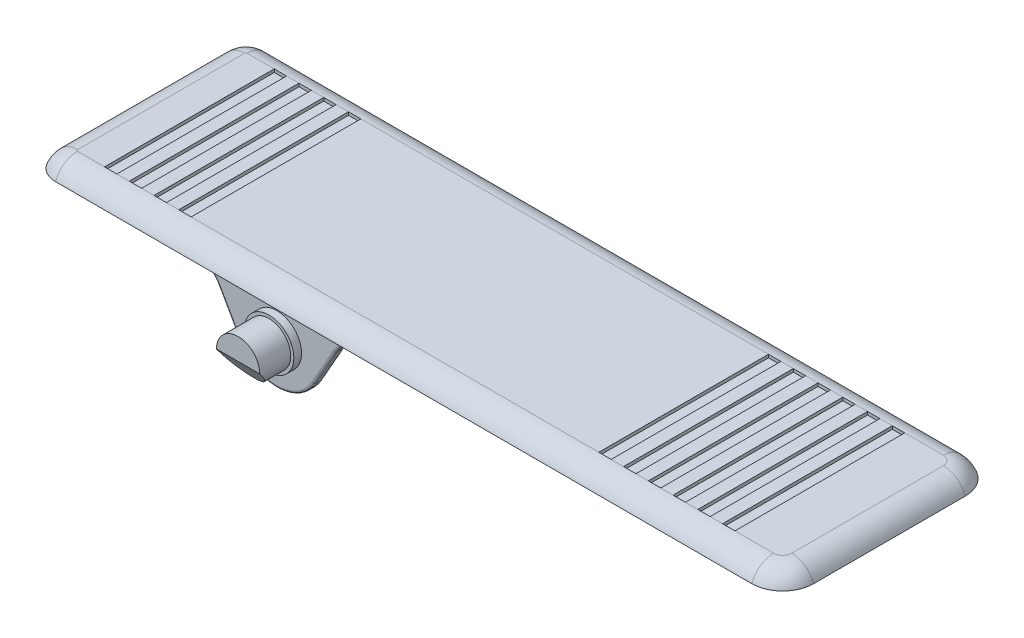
ISO-10303-21;
HEADER;
FILE_DESCRIPTION(('STEP AP214'),'2;1');
FILE_NAME('part.step','',(''),(''),'','','');
FILE_SCHEMA(('AUTOMOTIVE_DESIGN { 1 0 10303 214 1 1 1 1 }'));
ENDSEC;
DATA;
#1=APPLICATION_CONTEXT('core data for automotive mechanical design processes');
#2=APPLICATION_PROTOCOL_DEFINITION('international standard','automotive_design',2000,#1);
#3=PRODUCT_CONTEXT('',#1,'mechanical');
#4=PRODUCT('Part','Part','',(#3));
#5=PRODUCT_RELATED_PRODUCT_CATEGORY('part','',(#4));
#6=PRODUCT_DEFINITION_FORMATION('','',#4);
#7=PRODUCT_DEFINITION_CONTEXT('part definition',#1,'design');
#8=PRODUCT_DEFINITION('design','',#6,#7);
#9=PRODUCT_DEFINITION_SHAPE('','',#8);
#10=(LENGTH_UNIT() NAMED_UNIT(*) SI_UNIT(.MILLI.,.METRE.));
#11=(NAMED_UNIT(*) PLANE_ANGLE_UNIT() SI_UNIT($,.RADIAN.));
#12=(NAMED_UNIT(*) SI_UNIT($,.STERADIAN.) SOLID_ANGLE_UNIT());
#13=UNCERTAINTY_MEASURE_WITH_UNIT(LENGTH_MEASURE(1.E-05),#10,'distance_accuracy_value','');
#14=(GEOMETRIC_REPRESENTATION_CONTEXT(3) GLOBAL_UNCERTAINTY_ASSIGNED_CONTEXT((#13)) GLOBAL_UNIT_ASSIGNED_CONTEXT((#10,
#11,#12)) REPRESENTATION_CONTEXT('',''));
#15=CARTESIAN_POINT('',(0.,0.,0.));
#16=DIRECTION('',(0.,0.,1.));
#17=DIRECTION('',(1.,0.,0.));
#18=AXIS2_PLACEMENT_3D('',#15,#16,#17);
#19=CARTESIAN_POINT('',(3.81,2.54,-3.81));
#20=DIRECTION('',(0.,1.,0.));
#21=DIRECTION('',(0.,0.,1.));
#22=AXIS2_PLACEMENT_3D('',#19,#20,#21);
#23=PLANE('',#22);
#24=DIRECTION('',(0.,0.,-1.));
#25=VECTOR('',#24,1.);
#26=CARTESIAN_POINT('',(22.479,2.54,-3.59210244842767));
#27=LINE('',#26,#25);
#28=CARTESIAN_POINT('',(22.479,2.54,-3.59210244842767));
#29=VERTEX_POINT('',#28);
#30=CARTESIAN_POINT('',(22.479,2.54,-31.4598975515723));
#31=VERTEX_POINT('',#30);
#32=EDGE_CURVE('E43',#29,#31,#27,.T.);
#33=ORIENTED_EDGE('',*,*,#32,.F.);
#34=DIRECTION('',(-1.,0.,0.));
#35=VECTOR('',#34,1.);
#36=CARTESIAN_POINT('',(118.11,2.54,-3.59210244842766));
#37=LINE('',#36,#35);
#38=CARTESIAN_POINT('',(89.408,2.54,-3.59210244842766));
#39=VERTEX_POINT('',#38);
#40=EDGE_CURVE('E1216',#29,#39,#37,.F.);
#41=ORIENTED_EDGE('',*,*,#40,.T.);
#42=DIRECTION('',(0.,0.,1.));
#43=VECTOR('',#42,1.);
#44=CARTESIAN_POINT('',(89.408,2.54,-31.4598975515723));
#45=LINE('',#44,#43);
#46=CARTESIAN_POINT('',(89.408,2.54,-31.4598975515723));
#47=VERTEX_POINT('',#46);
#48=EDGE_CURVE('E773',#47,#39,#45,.T.);
#49=ORIENTED_EDGE('',*,*,#48,.F.);
#50=DIRECTION('',(1.,0.,0.));
#51=VECTOR('',#50,1.);
#52=CARTESIAN_POINT('',(3.80999999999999,2.54,-31.4598975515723));
#53=LINE('',#52,#51);
#54=EDGE_CURVE('E714',#47,#31,#53,.F.);
#55=ORIENTED_EDGE('',*,*,#54,.T.);
#56=EDGE_LOOP('',(#33,#41,#49,#55));
#57=FACE_BOUND('',#56,.T.);
#58=ADVANCED_FACE('F28',(#57),#23,.T.);
#59=DIRECTION('',(0.,0.,1.));
#60=VECTOR('',#59,1.);
#61=CARTESIAN_POINT('',(20.447,2.54,-31.4598975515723));
#62=LINE('',#61,#60);
#63=CARTESIAN_POINT('',(20.447,2.54,-31.4598975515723));
#64=VERTEX_POINT('',#63);
#65=CARTESIAN_POINT('',(20.447,2.54,-3.59210244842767));
#66=VERTEX_POINT('',#65);
#67=EDGE_CURVE('E687',#64,#66,#62,.T.);
#68=ORIENTED_EDGE('',*,*,#67,.F.);
#69=CARTESIAN_POINT('',(18.415,2.54,-31.4598975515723));
#70=VERTEX_POINT('',#69);
#71=EDGE_CURVE('E51',#64,#70,#53,.F.);
#72=ORIENTED_EDGE('',*,*,#71,.T.);
#73=DIRECTION('',(0.,0.,-1.));
#74=VECTOR('',#73,1.);
#75=CARTESIAN_POINT('',(18.415,2.54,-3.59210244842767));
#76=LINE('',#75,#74);
#77=CARTESIAN_POINT('',(18.415,2.54,-3.59210244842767));
#78=VERTEX_POINT('',#77);
#79=EDGE_CURVE('E3096',#78,#70,#76,.T.);
#80=ORIENTED_EDGE('',*,*,#79,.F.);
#81=EDGE_CURVE('E706',#78,#66,#37,.F.);
#82=ORIENTED_EDGE('',*,*,#81,.T.);
#83=EDGE_LOOP('',(#68,#72,#80,#82));
#84=FACE_BOUND('',#83,.T.);
#85=ADVANCED_FACE('F704',(#84),#23,.T.);
#86=DIRECTION('',(0.,0.,1.));
#87=VECTOR('',#86,1.);
#88=CARTESIAN_POINT('',(16.383,2.54,-31.4598975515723));
#89=LINE('',#88,#87);
#90=CARTESIAN_POINT('',(16.383,2.54,-31.4598975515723));
#91=VERTEX_POINT('',#90);
#92=CARTESIAN_POINT('',(16.383,2.54,-3.59210244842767));
#93=VERTEX_POINT('',#92);
#94=EDGE_CURVE('E1333',#91,#93,#89,.T.);
#95=ORIENTED_EDGE('',*,*,#94,.F.);
#96=CARTESIAN_POINT('',(14.351,2.54,-31.4598975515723));
#97=VERTEX_POINT('',#96);
#98=EDGE_CURVE('E715',#91,#97,#53,.F.);
#99=ORIENTED_EDGE('',*,*,#98,.T.);
#100=DIRECTION('',(0.,0.,-1.));
#101=VECTOR('',#100,1.);
#102=CARTESIAN_POINT('',(14.351,2.54,-3.59210244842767));
#103=LINE('',#102,#101);
#104=CARTESIAN_POINT('',(14.351,2.54,-3.59210244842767));
#105=VERTEX_POINT('',#104);
#106=EDGE_CURVE('E1335',#105,#97,#103,.T.);
#107=ORIENTED_EDGE('',*,*,#106,.F.);
#108=EDGE_CURVE('E1325',#105,#93,#37,.F.);
#109=ORIENTED_EDGE('',*,*,#108,.T.);
#110=EDGE_LOOP('',(#95,#99,#107,#109));
#111=FACE_BOUND('',#110,.T.);
#112=ADVANCED_FACE('F1331',(#111),#23,.T.);
#113=DIRECTION('',(0.,0.,1.));
#114=VECTOR('',#113,1.);
#115=CARTESIAN_POINT('',(12.319,2.54,-31.4598975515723));
#116=LINE('',#115,#114);
#117=CARTESIAN_POINT('',(12.319,2.54,-31.4598975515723));
#118=VERTEX_POINT('',#117);
#119=CARTESIAN_POINT('',(12.319,2.54,-3.59210244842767));
#120=VERTEX_POINT('',#119);
#121=EDGE_CURVE('E1241',#118,#120,#116,.T.);
#122=ORIENTED_EDGE('',*,*,#121,.F.);
#123=CARTESIAN_POINT('',(10.287,2.54,-31.4598975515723));
#124=VERTEX_POINT('',#123);
#125=EDGE_CURVE('E720',#118,#124,#53,.F.);
#126=ORIENTED_EDGE('',*,*,#125,.T.);
#127=DIRECTION('',(0.,0.,-1.));
#128=VECTOR('',#127,1.);
#129=CARTESIAN_POINT('',(10.287,2.54,-3.59210244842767));
#130=LINE('',#129,#128);
#131=CARTESIAN_POINT('',(10.287,2.54,-3.59210244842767));
#132=VERTEX_POINT('',#131);
#133=EDGE_CURVE('E1238',#132,#124,#130,.T.);
#134=ORIENTED_EDGE('',*,*,#133,.F.);
#135=EDGE_CURVE('E1215',#132,#120,#37,.F.);
#136=ORIENTED_EDGE('',*,*,#135,.T.);
#137=EDGE_LOOP('',(#122,#126,#134,#136));
#138=FACE_BOUND('',#137,.T.);
#139=ADVANCED_FACE('F1236',(#138),#23,.T.);
#140=DIRECTION('',(0.,0.,-1.));
#141=VECTOR('',#140,1.);
#142=CARTESIAN_POINT('',(91.44,2.54,-3.59210244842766));
#143=LINE('',#142,#141);
#144=CARTESIAN_POINT('',(91.44,2.54,-3.59210244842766));
#145=VERTEX_POINT('',#144);
#146=CARTESIAN_POINT('',(91.44,2.54,-31.4598975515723));
#147=VERTEX_POINT('',#146);
#148=EDGE_CURVE('E760',#145,#147,#143,.T.);
#149=ORIENTED_EDGE('',*,*,#148,.F.);
#150=CARTESIAN_POINT('',(93.472,2.54,-3.59210244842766));
#151=VERTEX_POINT('',#150);
#152=EDGE_CURVE('E1323',#145,#151,#37,.F.);
#153=ORIENTED_EDGE('',*,*,#152,.T.);
#154=DIRECTION('',(0.,0.,1.));
#155=VECTOR('',#154,1.);
#156=CARTESIAN_POINT('',(93.472,2.54,-31.4598975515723));
#157=LINE('',#156,#155);
#158=CARTESIAN_POINT('',(93.472,2.54,-31.4598975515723));
#159=VERTEX_POINT('',#158);
#160=EDGE_CURVE('E763',#159,#151,#157,.T.);
#161=ORIENTED_EDGE('',*,*,#160,.F.);
#162=EDGE_CURVE('E718',#159,#147,#53,.F.);
#163=ORIENTED_EDGE('',*,*,#162,.T.);
#164=EDGE_LOOP('',(#149,#153,#161,#163));
#165=FACE_BOUND('',#164,.T.);
#166=ADVANCED_FACE('F759',(#165),#23,.T.);
#167=DIRECTION('',(0.,0.,-1.));
#168=VECTOR('',#167,1.);
#169=CARTESIAN_POINT('',(95.504,2.54,-3.59210244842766));
#170=LINE('',#169,#168);
#171=CARTESIAN_POINT('',(95.504,2.54,-3.59210244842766));
#172=VERTEX_POINT('',#171);
#173=CARTESIAN_POINT('',(95.504,2.54,-31.4598975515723));
#174=VERTEX_POINT('',#173);
#175=EDGE_CURVE('E797',#172,#174,#170,.T.);
#176=ORIENTED_EDGE('',*,*,#175,.F.);
#177=CARTESIAN_POINT('',(97.536,2.54,-3.59210244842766));
#178=VERTEX_POINT('',#177);
#179=EDGE_CURVE('E1321',#172,#178,#37,.F.);
#180=ORIENTED_EDGE('',*,*,#179,.T.);
#181=DIRECTION('',(0.,0.,1.));
#182=VECTOR('',#181,1.);
#183=CARTESIAN_POINT('',(97.536,2.54,-31.4598975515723));
#184=LINE('',#183,#182);
#185=CARTESIAN_POINT('',(97.536,2.54,-31.4598975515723));
#186=VERTEX_POINT('',#185);
#187=EDGE_CURVE('E835',#186,#178,#184,.T.);
#188=ORIENTED_EDGE('',*,*,#187,.F.);
#189=EDGE_CURVE('E744',#186,#174,#53,.F.);
#190=ORIENTED_EDGE('',*,*,#189,.T.);
#191=EDGE_LOOP('',(#176,#180,#188,#190));
#192=FACE_BOUND('',#191,.T.);
#193=ADVANCED_FACE('F2760',(#192),#23,.T.);
#194=DIRECTION('',(0.,0.,-1.));
#195=VECTOR('',#194,1.);
#196=CARTESIAN_POINT('',(99.568,2.54,-3.59210244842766));
#197=LINE('',#196,#195);
#198=CARTESIAN_POINT('',(99.568,2.54,-3.59210244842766));
#199=VERTEX_POINT('',#198);
#200=CARTESIAN_POINT('',(99.568,2.54,-31.4598975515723));
#201=VERTEX_POINT('',#200);
#202=EDGE_CURVE('E823',#199,#201,#197,.T.);
#203=ORIENTED_EDGE('',*,*,#202,.F.);
#204=CARTESIAN_POINT('',(101.6,2.54,-3.59210244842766));
#205=VERTEX_POINT('',#204);
#206=EDGE_CURVE('E1319',#199,#205,#37,.F.);
#207=ORIENTED_EDGE('',*,*,#206,.T.);
#208=DIRECTION('',(0.,0.,1.));
#209=VECTOR('',#208,1.);
#210=CARTESIAN_POINT('',(101.6,2.54,-31.4598975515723));
#211=LINE('',#210,#209);
#212=CARTESIAN_POINT('',(101.6,2.54,-31.4598975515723));
#213=VERTEX_POINT('',#212);
#214=EDGE_CURVE('E866',#213,#205,#211,.T.);
#215=ORIENTED_EDGE('',*,*,#214,.F.);
#216=EDGE_CURVE('E738',#213,#201,#53,.F.);
#217=ORIENTED_EDGE('',*,*,#216,.T.);
#218=EDGE_LOOP('',(#203,#207,#215,#217));
#219=FACE_BOUND('',#218,.T.);
#220=ADVANCED_FACE('F1449',(#219),#23,.T.);
#221=DIRECTION('',(0.,0.,-1.));
#222=VECTOR('',#221,1.);
#223=CARTESIAN_POINT('',(103.632,2.54,-3.59210244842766));
#224=LINE('',#223,#222);
#225=CARTESIAN_POINT('',(103.632,2.54,-3.59210244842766));
#226=VERTEX_POINT('',#225);
#227=CARTESIAN_POINT('',(103.632,2.54,-31.4598975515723));
#228=VERTEX_POINT('',#227);
#229=EDGE_CURVE('E854',#226,#228,#224,.T.);
#230=ORIENTED_EDGE('',*,*,#229,.F.);
#231=CARTESIAN_POINT('',(105.664,2.54,-3.59210244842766));
#232=VERTEX_POINT('',#231);
#233=EDGE_CURVE('E1317',#226,#232,#37,.F.);
#234=ORIENTED_EDGE('',*,*,#233,.T.);
#235=DIRECTION('',(0.,0.,1.));
#236=VECTOR('',#235,1.);
#237=CARTESIAN_POINT('',(105.664,2.54,-31.4598975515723));
#238=LINE('',#237,#236);
#239=CARTESIAN_POINT('',(105.664,2.54,-31.4598975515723));
#240=VERTEX_POINT('',#239);
#241=EDGE_CURVE('E897',#240,#232,#238,.T.);
#242=ORIENTED_EDGE('',*,*,#241,.F.);
#243=EDGE_CURVE('E732',#240,#228,#53,.F.);
#244=ORIENTED_EDGE('',*,*,#243,.T.);
#245=EDGE_LOOP('',(#230,#234,#242,#244));
#246=FACE_BOUND('',#245,.T.);
#247=ADVANCED_FACE('F1444',(#246),#23,.T.);
#248=DIRECTION('',(0.,0.,-1.));
#249=VECTOR('',#248,1.);
#250=CARTESIAN_POINT('',(107.696,2.54,-3.59210244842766));
#251=LINE('',#250,#249);
#252=CARTESIAN_POINT('',(107.696,2.54,-3.59210244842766));
#253=VERTEX_POINT('',#252);
#254=CARTESIAN_POINT('',(107.696,2.54,-31.4598975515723));
#255=VERTEX_POINT('',#254);
#256=EDGE_CURVE('E885',#253,#255,#251,.T.);
#257=ORIENTED_EDGE('',*,*,#256,.F.);
#258=CARTESIAN_POINT('',(109.728,2.54,-3.59210244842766));
#259=VERTEX_POINT('',#258);
#260=EDGE_CURVE('E1316',#253,#259,#37,.F.);
#261=ORIENTED_EDGE('',*,*,#260,.T.);
#262=DIRECTION('',(0.,0.,1.));
#263=VECTOR('',#262,1.);
#264=CARTESIAN_POINT('',(109.728,2.54,-31.4598975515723));
#265=LINE('',#264,#263);
#266=CARTESIAN_POINT('',(109.728,2.54,-31.4598975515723));
#267=VERTEX_POINT('',#266);
#268=EDGE_CURVE('E928',#267,#259,#265,.T.);
#269=ORIENTED_EDGE('',*,*,#268,.F.);
#270=EDGE_CURVE('E725',#267,#255,#53,.F.);
#271=ORIENTED_EDGE('',*,*,#270,.T.);
#272=EDGE_LOOP('',(#257,#261,#269,#271));
#273=FACE_BOUND('',#272,.T.);
#274=ADVANCED_FACE('F1434',(#273),#23,.T.);
#275=DIRECTION('',(0.,0.,-1.));
#276=VECTOR('',#275,1.);
#277=CARTESIAN_POINT('',(111.76,2.54,-3.59210244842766));
#278=LINE('',#277,#276);
#279=CARTESIAN_POINT('',(111.76,2.54,-3.59210244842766));
#280=VERTEX_POINT('',#279);
#281=CARTESIAN_POINT('',(111.76,2.54,-31.4598975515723));
#282=VERTEX_POINT('',#281);
#283=EDGE_CURVE('E916',#280,#282,#278,.T.);
#284=ORIENTED_EDGE('',*,*,#283,.F.);
#285=CARTESIAN_POINT('',(118.11,2.54,-3.59210244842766));
#286=VERTEX_POINT('',#285);
#287=EDGE_CURVE('E1210',#280,#286,#37,.F.);
#288=ORIENTED_EDGE('',*,*,#287,.T.);
#289=CARTESIAN_POINT('',(118.11,2.54,-5.08));
#290=DIRECTION('',(0.,1.,0.));
#291=DIRECTION('',(0.,0.,1.));
#292=AXIS2_PLACEMENT_3D('',#289,#290,#291);
#293=CIRCLE('',#292,1.48789755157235);
#294=CARTESIAN_POINT('',(119.597897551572,2.54,-5.08));
#295=VERTEX_POINT('',#294);
#296=EDGE_CURVE('E1214',#286,#295,#293,.T.);
#297=ORIENTED_EDGE('',*,*,#296,.T.);
#298=DIRECTION('',(0.,0.,-1.));
#299=VECTOR('',#298,1.);
#300=CARTESIAN_POINT('',(119.597897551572,2.54,-29.972));
#301=LINE('',#300,#299);
#302=CARTESIAN_POINT('',(119.597897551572,2.54,-29.972));
#303=VERTEX_POINT('',#302);
#304=EDGE_CURVE('E1220',#295,#303,#301,.T.);
#305=ORIENTED_EDGE('',*,*,#304,.T.);
#306=CARTESIAN_POINT('',(118.11,2.54,-29.972));
#307=DIRECTION('',(0.,1.,0.));
#308=DIRECTION('',(0.,0.,1.));
#309=AXIS2_PLACEMENT_3D('',#306,#307,#308);
#310=CIRCLE('',#309,1.48789755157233);
#311=CARTESIAN_POINT('',(118.11,2.54,-31.4598975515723));
#312=VERTEX_POINT('',#311);
#313=EDGE_CURVE('E1224',#303,#312,#310,.T.);
#314=ORIENTED_EDGE('',*,*,#313,.T.);
#315=EDGE_CURVE('E717',#312,#282,#53,.F.);
#316=ORIENTED_EDGE('',*,*,#315,.T.);
#317=EDGE_LOOP('',(#284,#288,#297,#305,#314,#316));
#318=FACE_BOUND('',#317,.T.);
#319=ADVANCED_FACE('F1314',(#318),#23,.T.);
#320=CARTESIAN_POINT('',(3.81,0.,-3.81));
#321=DIRECTION('',(0.,1.,0.));
#322=DIRECTION('',(0.,0.,1.));
#323=AXIS2_PLACEMENT_3D('',#320,#321,#322);
#324=PLANE('',#323);
#325=DIRECTION('',(0.,0.,-1.));
#326=VECTOR('',#325,1.);
#327=CARTESIAN_POINT('',(117.729,0.,-4.064));
#328=LINE('',#327,#326);
#329=CARTESIAN_POINT('',(117.729,0.,-30.988));
#330=VERTEX_POINT('',#329);
#331=CARTESIAN_POINT('',(117.729,0.,-4.064));
#332=VERTEX_POINT('',#331);
#333=EDGE_CURVE('E2137',#330,#332,#328,.F.);
#334=ORIENTED_EDGE('',*,*,#333,.T.);
#335=CARTESIAN_POINT('',(118.872,0.,-4.064));
#336=DIRECTION('',(0.,1.,0.));
#337=DIRECTION('',(0.,0.,1.));
#338=AXIS2_PLACEMENT_3D('',#335,#336,#337);
#339=CIRCLE('',#338,1.143);
#340=CARTESIAN_POINT('',(120.015,0.,-4.064));
#341=VERTEX_POINT('',#340);
#342=EDGE_CURVE('E2141',#332,#341,#339,.T.);
#343=ORIENTED_EDGE('',*,*,#342,.T.);
#344=DIRECTION('',(0.,0.,1.));
#345=VECTOR('',#344,1.);
#346=CARTESIAN_POINT('',(120.015,0.,-30.988));
#347=LINE('',#346,#345);
#348=CARTESIAN_POINT('',(120.015,0.,-30.988));
#349=VERTEX_POINT('',#348);
#350=EDGE_CURVE('E2139',#341,#349,#347,.F.);
#351=ORIENTED_EDGE('',*,*,#350,.T.);
#352=CARTESIAN_POINT('',(118.872,0.,-30.988));
#353=DIRECTION('',(0.,1.,0.));
#354=DIRECTION('',(0.,0.,1.));
#355=AXIS2_PLACEMENT_3D('',#352,#353,#354);
#356=CIRCLE('',#355,1.143);
#357=EDGE_CURVE('E2012',#349,#330,#356,.T.);
#358=ORIENTED_EDGE('',*,*,#357,.T.);
#359=EDGE_LOOP('',(#334,#343,#351,#358));
#360=FACE_BOUND('',#359,.T.);
#361=CARTESIAN_POINT('',(14.605,0.,-17.526));
#362=DIRECTION('',(0.,1.,0.));
#363=DIRECTION('',(0.,0.,1.));
#364=AXIS2_PLACEMENT_3D('',#361,#362,#363);
#365=CIRCLE('',#364,9.652);
#366=CARTESIAN_POINT('',(14.605,0.,-7.87400000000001));
#367=VERTEX_POINT('',#366);
#368=EDGE_CURVE('E2133',#367,#367,#365,.T.);
#369=ORIENTED_EDGE('',*,*,#368,.T.);
#370=EDGE_LOOP('',(#369));
#371=FACE_BOUND('',#370,.T.);
#372=CARTESIAN_POINT('',(5.842,0.,-4.064));
#373=DIRECTION('',(0.,1.,0.));
#374=DIRECTION('',(0.,0.,1.));
#375=AXIS2_PLACEMENT_3D('',#372,#373,#374);
#376=CIRCLE('',#375,1.143);
#377=CARTESIAN_POINT('',(4.699,0.,-4.064));
#378=VERTEX_POINT('',#377);
#379=CARTESIAN_POINT('',(5.842,0.,-2.921));
#380=VERTEX_POINT('',#379);
#381=EDGE_CURVE('E2128',#378,#380,#376,.T.);
#382=ORIENTED_EDGE('',*,*,#381,.T.);
#383=DIRECTION('',(1.,0.,0.));
#384=VECTOR('',#383,1.);
#385=CARTESIAN_POINT('',(110.236,0.,-2.921));
#386=LINE('',#385,#384);
#387=CARTESIAN_POINT('',(110.236,0.,-2.921));
#388=VERTEX_POINT('',#387);
#389=EDGE_CURVE('E2130',#380,#388,#386,.T.);
#390=ORIENTED_EDGE('',*,*,#389,.T.);
#391=CARTESIAN_POINT('',(110.236,0.,-4.064));
#392=DIRECTION('',(0.,1.,0.));
#393=DIRECTION('',(0.,0.,1.));
#394=AXIS2_PLACEMENT_3D('',#391,#392,#393);
#395=CIRCLE('',#394,1.143);
#396=CARTESIAN_POINT('',(111.379,0.,-4.064));
#397=VERTEX_POINT('',#396);
#398=EDGE_CURVE('E2126',#388,#397,#395,.T.);
#399=ORIENTED_EDGE('',*,*,#398,.T.);
#400=CARTESIAN_POINT('',(110.236,0.,-4.064));
#401=DIRECTION('',(0.,1.,0.));
#402=DIRECTION('',(0.,0.,1.));
#403=AXIS2_PLACEMENT_3D('',#400,#401,#402);
#404=CIRCLE('',#403,1.143);
#405=CARTESIAN_POINT('',(110.236,0.,-5.207));
#406=VERTEX_POINT('',#405);
#407=EDGE_CURVE('E2122',#397,#406,#404,.T.);
#408=ORIENTED_EDGE('',*,*,#407,.T.);
#409=DIRECTION('',(1.,0.,0.));
#410=VECTOR('',#409,1.);
#411=CARTESIAN_POINT('',(3.81,0.,-5.207));
#412=LINE('',#411,#410);
#413=CARTESIAN_POINT('',(5.842,0.,-5.207));
#414=VERTEX_POINT('',#413);
#415=EDGE_CURVE('E2120',#406,#414,#412,.F.);
#416=ORIENTED_EDGE('',*,*,#415,.T.);
#417=CARTESIAN_POINT('',(5.842,0.,-4.064));
#418=DIRECTION('',(0.,1.,0.));
#419=DIRECTION('',(0.,0.,1.));
#420=AXIS2_PLACEMENT_3D('',#417,#418,#419);
#421=CIRCLE('',#420,1.143);
#422=EDGE_CURVE('E2124',#414,#378,#421,.T.);
#423=ORIENTED_EDGE('',*,*,#422,.T.);
#424=EDGE_LOOP('',(#382,#390,#399,#408,#416,#423));
#425=FACE_BOUND('',#424,.T.);
#426=CARTESIAN_POINT('',(5.842,0.,-30.988));
#427=DIRECTION('',(0.,1.,0.));
#428=DIRECTION('',(0.,0.,1.));
#429=AXIS2_PLACEMENT_3D('',#426,#427,#428);
#430=CIRCLE('',#429,1.143);
#431=CARTESIAN_POINT('',(4.699,0.,-30.988));
#432=VERTEX_POINT('',#431);
#433=CARTESIAN_POINT('',(5.842,0.,-29.845));
#434=VERTEX_POINT('',#433);
#435=EDGE_CURVE('E2115',#432,#434,#430,.T.);
#436=ORIENTED_EDGE('',*,*,#435,.T.);
#437=DIRECTION('',(1.,0.,0.));
#438=VECTOR('',#437,1.);
#439=CARTESIAN_POINT('',(3.81,0.,-29.845));
#440=LINE('',#439,#438);
#441=CARTESIAN_POINT('',(110.236,0.,-29.845));
#442=VERTEX_POINT('',#441);
#443=EDGE_CURVE('E2117',#434,#442,#440,.T.);
#444=ORIENTED_EDGE('',*,*,#443,.T.);
#445=CARTESIAN_POINT('',(110.236,0.,-30.988));
#446=DIRECTION('',(0.,1.,0.));
#447=DIRECTION('',(0.,0.,1.));
#448=AXIS2_PLACEMENT_3D('',#445,#446,#447);
#449=CIRCLE('',#448,1.143);
#450=CARTESIAN_POINT('',(111.379,0.,-30.988));
#451=VERTEX_POINT('',#450);
#452=EDGE_CURVE('E2113',#442,#451,#449,.T.);
#453=ORIENTED_EDGE('',*,*,#452,.T.);
#454=CARTESIAN_POINT('',(110.236,0.,-30.988));
#455=DIRECTION('',(0.,1.,0.));
#456=DIRECTION('',(0.,0.,1.));
#457=AXIS2_PLACEMENT_3D('',#454,#455,#456);
#458=CIRCLE('',#457,1.143);
#459=CARTESIAN_POINT('',(110.236,0.,-32.131));
#460=VERTEX_POINT('',#459);
#461=EDGE_CURVE('E2109',#451,#460,#458,.T.);
#462=ORIENTED_EDGE('',*,*,#461,.T.);
#463=DIRECTION('',(1.,0.,0.));
#464=VECTOR('',#463,1.);
#465=CARTESIAN_POINT('',(5.842,0.,-32.131));
#466=LINE('',#465,#464);
#467=CARTESIAN_POINT('',(5.842,0.,-32.131));
#468=VERTEX_POINT('',#467);
#469=EDGE_CURVE('E2107',#460,#468,#466,.F.);
#470=ORIENTED_EDGE('',*,*,#469,.T.);
#471=CARTESIAN_POINT('',(5.842,0.,-30.988));
#472=DIRECTION('',(0.,1.,0.));
#473=DIRECTION('',(0.,0.,1.));
#474=AXIS2_PLACEMENT_3D('',#471,#472,#473);
#475=CIRCLE('',#474,1.143);
#476=EDGE_CURVE('E2111',#468,#432,#475,.T.);
#477=ORIENTED_EDGE('',*,*,#476,.T.);
#478=EDGE_LOOP('',(#436,#444,#453,#462,#470,#477));
#479=FACE_BOUND('',#478,.T.);
#480=CARTESIAN_POINT('',(3.81,0.,-3.81));
#481=DIRECTION('',(0.,1.,0.));
#482=DIRECTION('',(0.,0.,1.));
#483=AXIS2_PLACEMENT_3D('',#480,#481,#482);
#484=CIRCLE('',#483,3.81);
#485=CARTESIAN_POINT('',(0.,0.,-3.81000000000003));
#486=VERTEX_POINT('',#485);
#487=CARTESIAN_POINT('',(3.81000000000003,0.,0.));
#488=VERTEX_POINT('',#487);
#489=EDGE_CURVE('E1189',#486,#488,#484,.T.);
#490=ORIENTED_EDGE('',*,*,#489,.F.);
#491=DIRECTION('',(0.,0.,-1.));
#492=VECTOR('',#491,1.);
#493=CARTESIAN_POINT('',(0.,0.,-3.81000000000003));
#494=LINE('',#493,#492);
#495=CARTESIAN_POINT('',(0.,0.,-31.242));
#496=VERTEX_POINT('',#495);
#497=EDGE_CURVE('E1208',#486,#496,#494,.T.);
#498=ORIENTED_EDGE('',*,*,#497,.T.);
#499=CARTESIAN_POINT('',(3.81,0.,-31.242));
#500=DIRECTION('',(0.,1.,0.));
#501=DIRECTION('',(0.,0.,1.));
#502=AXIS2_PLACEMENT_3D('',#499,#500,#501);
#503=CIRCLE('',#502,3.81);
#504=CARTESIAN_POINT('',(3.81,0.,-35.052));
#505=VERTEX_POINT('',#504);
#506=EDGE_CURVE('E1205',#505,#496,#503,.T.);
#507=ORIENTED_EDGE('',*,*,#506,.F.);
#508=DIRECTION('',(-1.,0.,0.));
#509=VECTOR('',#508,1.);
#510=CARTESIAN_POINT('',(118.11,0.,-35.052));
#511=LINE('',#510,#509);
#512=CARTESIAN_POINT('',(118.11,0.,-35.052));
#513=VERTEX_POINT('',#512);
#514=EDGE_CURVE('E1202',#513,#505,#511,.T.);
#515=ORIENTED_EDGE('',*,*,#514,.F.);
#516=CARTESIAN_POINT('',(118.11,0.,-29.972));
#517=DIRECTION('',(0.,1.,0.));
#518=DIRECTION('',(0.,0.,1.));
#519=AXIS2_PLACEMENT_3D('',#516,#517,#518);
#520=CIRCLE('',#519,5.07999999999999);
#521=CARTESIAN_POINT('',(123.19,0.,-29.972));
#522=VERTEX_POINT('',#521);
#523=EDGE_CURVE('E1199',#522,#513,#520,.T.);
#524=ORIENTED_EDGE('',*,*,#523,.F.);
#525=DIRECTION('',(0.,0.,1.));
#526=VECTOR('',#525,1.);
#527=CARTESIAN_POINT('',(123.19,0.,-29.972));
#528=LINE('',#527,#526);
#529=CARTESIAN_POINT('',(123.19,0.,-5.08));
#530=VERTEX_POINT('',#529);
#531=EDGE_CURVE('E1197',#522,#530,#528,.T.);
#532=ORIENTED_EDGE('',*,*,#531,.T.);
#533=CARTESIAN_POINT('',(118.11,0.,-5.08));
#534=DIRECTION('',(0.,-1.,0.));
#535=DIRECTION('',(0.,0.,-1.));
#536=AXIS2_PLACEMENT_3D('',#533,#534,#535);
#537=CIRCLE('',#536,5.08000000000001);
#538=CARTESIAN_POINT('',(118.11,0.,0.));
#539=VERTEX_POINT('',#538);
#540=EDGE_CURVE('E1195',#530,#539,#537,.T.);
#541=ORIENTED_EDGE('',*,*,#540,.T.);
#542=DIRECTION('',(1.,0.,0.));
#543=VECTOR('',#542,1.);
#544=CARTESIAN_POINT('',(3.81000000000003,0.,0.));
#545=LINE('',#544,#543);
#546=EDGE_CURVE('E1192',#488,#539,#545,.T.);
#547=ORIENTED_EDGE('',*,*,#546,.F.);
#548=EDGE_LOOP('',(#490,#498,#507,#515,#524,#532,#541,#547));
#549=FACE_BOUND('',#548,.T.);
#550=ADVANCED_FACE('F1304',(#360,#371,#425,#479,#549),#324,.F.);
#551=CARTESIAN_POINT('',(36.83,-7.5184,3.048));
#552=DIRECTION('',(0.,0.,-1.));
#553=DIRECTION('',(-1.,0.,0.));
#554=AXIS2_PLACEMENT_3D('',#551,#552,#553);
#555=CYLINDRICAL_SURFACE('',#554,3.55600000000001);
#556=CARTESIAN_POINT('',(36.83,-7.5184,-2.032));
#557=DIRECTION('',(0.,0.,1.));
#558=DIRECTION('',(1.,0.,0.));
#559=AXIS2_PLACEMENT_3D('',#556,#557,#558);
#560=CIRCLE('',#559,3.55600000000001);
#561=CARTESIAN_POINT('',(40.386,-7.5184,-2.032));
#562=VERTEX_POINT('',#561);
#563=EDGE_CURVE('E1150',#562,#562,#560,.F.);
#564=ORIENTED_EDGE('',*,*,#563,.F.);
#565=EDGE_LOOP('',(#564));
#566=FACE_BOUND('',#565,.T.);
#567=CARTESIAN_POINT('',(36.83,-7.5184,3.048));
#568=DIRECTION('',(0.,0.,1.));
#569=DIRECTION('',(1.,0.,0.));
#570=AXIS2_PLACEMENT_3D('',#567,#568,#569);
#571=CIRCLE('',#570,3.55600000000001);
#572=CARTESIAN_POINT('',(40.386,-7.5184,3.048));
#573=VERTEX_POINT('',#572);
#574=CARTESIAN_POINT('',(33.274,-7.5184,3.048));
#575=VERTEX_POINT('',#574);
#576=EDGE_CURVE('E1147',#573,#575,#571,.T.);
#577=ORIENTED_EDGE('',*,*,#576,.F.);
#578=CARTESIAN_POINT('',(36.83,-7.5184,3.048));
#579=DIRECTION('',(0.,-0.581238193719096,0.813733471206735));
#580=DIRECTION('',(0.,-0.813733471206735,-0.581238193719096));
#581=AXIS2_PLACEMENT_3D('',#578,#579,#580);
#582=ELLIPSE('',#581,4.36998123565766,3.55600000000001);
#583=EDGE_CURVE('E1143',#575,#573,#582,.T.);
#584=ORIENTED_EDGE('',*,*,#583,.F.);
#585=EDGE_LOOP('',(#577,#584));
#586=FACE_BOUND('',#585,.T.);
#587=ADVANCED_FACE('F1440',(#566,#586),#555,.T.);
#588=CARTESIAN_POINT('',(36.83,-7.5184,3.048));
#589=DIRECTION('',(0.,0.,1.));
#590=DIRECTION('',(1.,0.,0.));
#591=AXIS2_PLACEMENT_3D('',#588,#589,#590);
#592=PLANE('',#591);
#593=ORIENTED_EDGE('',*,*,#576,.T.);
#594=DIRECTION('',(1.,0.,0.));
#595=VECTOR('',#594,1.);
#596=CARTESIAN_POINT('',(36.83,-7.5184,3.048));
#597=LINE('',#596,#595);
#598=EDGE_CURVE('E2391',#575,#573,#597,.T.);
#599=ORIENTED_EDGE('',*,*,#598,.T.);
#600=EDGE_LOOP('',(#593,#599));
#601=FACE_BOUND('',#600,.T.);
#602=ADVANCED_FACE('F1860',(#601),#592,.T.);
#603=CARTESIAN_POINT('',(36.83,-7.5184,-2.032));
#604=DIRECTION('',(0.,0.,1.));
#605=DIRECTION('',(1.,0.,0.));
#606=AXIS2_PLACEMENT_3D('',#603,#604,#605);
#607=PLANE('',#606);
#608=CARTESIAN_POINT('',(36.83,-7.5184,-2.032));
#609=DIRECTION('',(0.,0.,1.));
#610=DIRECTION('',(1.,0.,0.));
#611=AXIS2_PLACEMENT_3D('',#608,#609,#610);
#612=CIRCLE('',#611,4.064);
#613=CARTESIAN_POINT('',(40.894,-7.5184,-2.032));
#614=VERTEX_POINT('',#613);
#615=EDGE_CURVE('E1151',#614,#614,#612,.T.);
#616=ORIENTED_EDGE('',*,*,#615,.T.);
#617=EDGE_LOOP('',(#616));
#618=FACE_BOUND('',#617,.T.);
#619=ORIENTED_EDGE('',*,*,#563,.T.);
#620=EDGE_LOOP('',(#619));
#621=FACE_BOUND('',#620,.T.);
#622=ADVANCED_FACE('F1430',(#618,#621),#607,.T.);
#623=CARTESIAN_POINT('',(36.83,-7.5184,-3.302));
#624=DIRECTION('',(0.,0.,-1.));
#625=DIRECTION('',(-1.,0.,0.));
#626=AXIS2_PLACEMENT_3D('',#623,#624,#625);
#627=PLANE('',#626);
#628=DIRECTION('',(0.,-1.,0.));
#629=VECTOR('',#628,1.);
#630=CARTESIAN_POINT('',(110.236,-7.5184,-3.302));
#631=LINE('',#630,#629);
#632=CARTESIAN_POINT('',(110.236,-1.143,-3.302));
#633=VERTEX_POINT('',#632);
#634=CARTESIAN_POINT('',(110.236,-0.381,-3.302));
#635=VERTEX_POINT('',#634);
#636=EDGE_CURVE('E2311',#633,#635,#631,.F.);
#637=ORIENTED_EDGE('',*,*,#636,.T.);
#638=DIRECTION('',(1.,0.,0.));
#639=VECTOR('',#638,1.);
#640=CARTESIAN_POINT('',(5.842,-0.381,-3.302));
#641=LINE('',#640,#639);
#642=CARTESIAN_POINT('',(5.842,-0.381,-3.302));
#643=VERTEX_POINT('',#642);
#644=EDGE_CURVE('E2291',#635,#643,#641,.F.);
#645=ORIENTED_EDGE('',*,*,#644,.T.);
#646=DIRECTION('',(0.,-1.,0.));
#647=VECTOR('',#646,1.);
#648=CARTESIAN_POINT('',(5.842,-1.524,-3.302));
#649=LINE('',#648,#647);
#650=CARTESIAN_POINT('',(5.842,-1.143,-3.302));
#651=VERTEX_POINT('',#650);
#652=EDGE_CURVE('E2318',#643,#651,#649,.T.);
#653=ORIENTED_EDGE('',*,*,#652,.T.);
#654=DIRECTION('',(1.,0.,0.));
#655=VECTOR('',#654,1.);
#656=CARTESIAN_POINT('',(21.7012517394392,-1.143,-3.302));
#657=LINE('',#656,#655);
#658=CARTESIAN_POINT('',(21.7012517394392,-1.143,-3.302));
#659=VERTEX_POINT('',#658);
#660=EDGE_CURVE('E2289',#651,#659,#657,.T.);
#661=ORIENTED_EDGE('',*,*,#660,.T.);
#662=CARTESIAN_POINT('',(21.7012517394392,-7.874,-3.302));
#663=DIRECTION('',(0.,0.,-1.));
#664=DIRECTION('',(-1.,0.,0.));
#665=AXIS2_PLACEMENT_3D('',#662,#663,#664);
#666=CIRCLE('',#665,6.731);
#667=CARTESIAN_POINT('',(27.5561355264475,-4.55335294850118,-3.302));
#668=VERTEX_POINT('',#667);
#669=EDGE_CURVE('E2287',#659,#668,#666,.T.);
#670=ORIENTED_EDGE('',*,*,#669,.T.);
#671=DIRECTION('',(-0.493336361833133,0.869838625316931,0.));
#672=VECTOR('',#671,1.);
#673=CARTESIAN_POINT('',(31.085585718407,-10.776393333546,-3.302));
#674=LINE('',#673,#672);
#675=CARTESIAN_POINT('',(31.085585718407,-10.776393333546,-3.302));
#676=VERTEX_POINT('',#675);
#677=EDGE_CURVE('E2285',#668,#676,#674,.F.);
#678=ORIENTED_EDGE('',*,*,#677,.T.);
#679=CARTESIAN_POINT('',(36.83,-7.5184,-3.302));
#680=DIRECTION('',(0.,0.,-1.));
#681=DIRECTION('',(-1.,0.,0.));
#682=AXIS2_PLACEMENT_3D('',#679,#680,#681);
#683=CIRCLE('',#682,6.60399999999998);
#684=CARTESIAN_POINT('',(42.574414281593,-10.776393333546,-3.302));
#685=VERTEX_POINT('',#684);
#686=EDGE_CURVE('E2283',#676,#685,#683,.F.);
#687=ORIENTED_EDGE('',*,*,#686,.T.);
#688=DIRECTION('',(0.493336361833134,0.86983862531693,0.));
#689=VECTOR('',#688,1.);
#690=CARTESIAN_POINT('',(46.1038644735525,-4.55335294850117,-3.302));
#691=LINE('',#690,#689);
#692=CARTESIAN_POINT('',(46.1038644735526,-4.55335294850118,-3.302));
#693=VERTEX_POINT('',#692);
#694=EDGE_CURVE('E2281',#685,#693,#691,.T.);
#695=ORIENTED_EDGE('',*,*,#694,.T.);
#696=CARTESIAN_POINT('',(51.9587482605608,-7.874,-3.302));
#697=DIRECTION('',(0.,0.,-1.));
#698=DIRECTION('',(-1.,0.,0.));
#699=AXIS2_PLACEMENT_3D('',#696,#697,#698);
#700=CIRCLE('',#699,6.731);
#701=CARTESIAN_POINT('',(51.9587482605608,-1.143,-3.302));
#702=VERTEX_POINT('',#701);
#703=EDGE_CURVE('E2277',#693,#702,#700,.T.);
#704=ORIENTED_EDGE('',*,*,#703,.T.);
#705=DIRECTION('',(1.,0.,0.));
#706=VECTOR('',#705,1.);
#707=CARTESIAN_POINT('',(110.236,-1.143,-3.302));
#708=LINE('',#707,#706);
#709=EDGE_CURVE('E2279',#702,#633,#708,.T.);
#710=ORIENTED_EDGE('',*,*,#709,.T.);
#711=EDGE_LOOP('',(#637,#645,#653,#661,#670,#678,#687,#695,#704,#710));
#712=FACE_BOUND('',#711,.T.);
#713=CARTESIAN_POINT('',(36.83,-7.5184,-3.302));
#714=DIRECTION('',(0.,0.,-1.));
#715=DIRECTION('',(-1.,0.,0.));
#716=AXIS2_PLACEMENT_3D('',#713,#714,#715);
#717=CIRCLE('',#716,4.064);
#718=CARTESIAN_POINT('',(32.766,-7.5184,-3.302));
#719=VERTEX_POINT('',#718);
#720=EDGE_CURVE('E2394',#719,#719,#717,.F.);
#721=ORIENTED_EDGE('',*,*,#720,.F.);
#722=EDGE_LOOP('',(#721));
#723=FACE_BOUND('',#722,.T.);
#724=ADVANCED_FACE('F1422',(#712,#723),#627,.F.);
#725=DIRECTION('',(0.,0.,1.));
#726=VECTOR('',#725,1.);
#727=CARTESIAN_POINT('',(8.255,2.54,-31.4598975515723));
#728=LINE('',#727,#726);
#729=CARTESIAN_POINT('',(8.255,2.54,-31.4598975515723));
#730=VERTEX_POINT('',#729);
#731=CARTESIAN_POINT('',(8.255,2.54,-3.59210244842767));
#732=VERTEX_POINT('',#731);
#733=EDGE_CURVE('E1262',#730,#732,#728,.T.);
#734=ORIENTED_EDGE('',*,*,#733,.F.);
#735=CARTESIAN_POINT('',(3.81,2.54,-31.4598975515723));
#736=VERTEX_POINT('',#735);
#737=EDGE_CURVE('E719',#730,#736,#53,.F.);
#738=ORIENTED_EDGE('',*,*,#737,.T.);
#739=CARTESIAN_POINT('',(3.81,2.54,-31.242));
#740=DIRECTION('',(0.,1.,0.));
#741=DIRECTION('',(0.,0.,1.));
#742=AXIS2_PLACEMENT_3D('',#739,#740,#741);
#743=CIRCLE('',#742,0.217897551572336);
#744=CARTESIAN_POINT('',(3.59210244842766,2.54,-31.242));
#745=VERTEX_POINT('',#744);
#746=EDGE_CURVE('E1225',#736,#745,#743,.T.);
#747=ORIENTED_EDGE('',*,*,#746,.T.);
#748=DIRECTION('',(0.,0.,1.));
#749=VECTOR('',#748,1.);
#750=CARTESIAN_POINT('',(3.59210244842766,2.54,-3.81000000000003));
#751=LINE('',#750,#749);
#752=CARTESIAN_POINT('',(3.59210244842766,2.54,-3.81));
#753=VERTEX_POINT('',#752);
#754=EDGE_CURVE('E1222',#745,#753,#751,.T.);
#755=ORIENTED_EDGE('',*,*,#754,.T.);
#756=CARTESIAN_POINT('',(3.81,2.54,-3.81));
#757=DIRECTION('',(0.,1.,0.));
#758=DIRECTION('',(0.,0.,1.));
#759=AXIS2_PLACEMENT_3D('',#756,#757,#758);
#760=CIRCLE('',#759,0.217897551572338);
#761=CARTESIAN_POINT('',(3.81000000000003,2.54,-3.59210244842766));
#762=VERTEX_POINT('',#761);
#763=EDGE_CURVE('E1218',#753,#762,#760,.T.);
#764=ORIENTED_EDGE('',*,*,#763,.T.);
#765=EDGE_CURVE('E1211',#762,#732,#37,.F.);
#766=ORIENTED_EDGE('',*,*,#765,.T.);
#767=EDGE_LOOP('',(#734,#738,#747,#755,#764,#766));
#768=FACE_BOUND('',#767,.T.);
#769=ADVANCED_FACE('F30',(#768),#23,.T.);
#770=CARTESIAN_POINT('',(3.81000000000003,-1.27,-3.59210244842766));
#771=DIRECTION('',(1.,0.,0.));
#772=DIRECTION('',(0.,0.,-1.));
#773=AXIS2_PLACEMENT_3D('',#770,#771,#772);
#774=CYLINDRICAL_SURFACE('',#773,3.81);
#775=CARTESIAN_POINT('',(3.81000000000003,-1.27,-3.59210244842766));
#776=DIRECTION('',(-1.,0.,0.));
#777=DIRECTION('',(0.,0.,1.));
#778=AXIS2_PLACEMENT_3D('',#775,#776,#777);
#779=CIRCLE('',#778,3.81);
#780=EDGE_CURVE('E1183',#488,#762,#779,.T.);
#781=ORIENTED_EDGE('',*,*,#780,.F.);
#782=ORIENTED_EDGE('',*,*,#546,.T.);
#783=CARTESIAN_POINT('',(118.11,-1.27,-3.59210244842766));
#784=DIRECTION('',(1.,0.,0.));
#785=DIRECTION('',(0.,0.,-1.));
#786=AXIS2_PLACEMENT_3D('',#783,#784,#785);
#787=CIRCLE('',#786,3.81);
#788=EDGE_CURVE('E1186',#286,#539,#787,.T.);
#789=ORIENTED_EDGE('',*,*,#788,.F.);
#790=ORIENTED_EDGE('',*,*,#287,.F.);
#791=DIRECTION('',(-1.,0.,0.));
#792=VECTOR('',#791,1.);
#793=CARTESIAN_POINT('',(111.76,2.54,-3.59210244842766));
#794=LINE('',#793,#792);
#795=EDGE_CURVE('E931',#280,#259,#794,.T.);
#796=ORIENTED_EDGE('',*,*,#795,.T.);
#797=ORIENTED_EDGE('',*,*,#260,.F.);
#798=DIRECTION('',(-1.,0.,0.));
#799=VECTOR('',#798,1.);
#800=CARTESIAN_POINT('',(107.696,2.54,-3.59210244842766));
#801=LINE('',#800,#799);
#802=EDGE_CURVE('E900',#253,#232,#801,.T.);
#803=ORIENTED_EDGE('',*,*,#802,.T.);
#804=ORIENTED_EDGE('',*,*,#233,.F.);
#805=DIRECTION('',(-1.,0.,0.));
#806=VECTOR('',#805,1.);
#807=CARTESIAN_POINT('',(103.632,2.54,-3.59210244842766));
#808=LINE('',#807,#806);
#809=EDGE_CURVE('E869',#226,#205,#808,.T.);
#810=ORIENTED_EDGE('',*,*,#809,.T.);
#811=ORIENTED_EDGE('',*,*,#206,.F.);
#812=DIRECTION('',(-1.,0.,0.));
#813=VECTOR('',#812,1.);
#814=CARTESIAN_POINT('',(99.568,2.54,-3.59210244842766));
#815=LINE('',#814,#813);
#816=EDGE_CURVE('E838',#199,#178,#815,.T.);
#817=ORIENTED_EDGE('',*,*,#816,.T.);
#818=ORIENTED_EDGE('',*,*,#179,.F.);
#819=DIRECTION('',(-1.,0.,0.));
#820=VECTOR('',#819,1.);
#821=CARTESIAN_POINT('',(95.504,2.54,-3.59210244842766));
#822=LINE('',#821,#820);
#823=EDGE_CURVE('E807',#172,#151,#822,.T.);
#824=ORIENTED_EDGE('',*,*,#823,.T.);
#825=ORIENTED_EDGE('',*,*,#152,.F.);
#826=DIRECTION('',(-1.,0.,0.));
#827=VECTOR('',#826,1.);
#828=CARTESIAN_POINT('',(91.44,2.54,-3.59210244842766));
#829=LINE('',#828,#827);
#830=EDGE_CURVE('E776',#145,#39,#829,.T.);
#831=ORIENTED_EDGE('',*,*,#830,.T.);
#832=ORIENTED_EDGE('',*,*,#40,.F.);
#833=DIRECTION('',(-1.,0.,0.));
#834=VECTOR('',#833,1.);
#835=CARTESIAN_POINT('',(22.479,2.54,-3.59210244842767));
#836=LINE('',#835,#834);
#837=EDGE_CURVE('E707',#29,#66,#836,.T.);
#838=ORIENTED_EDGE('',*,*,#837,.T.);
#839=ORIENTED_EDGE('',*,*,#81,.F.);
#840=DIRECTION('',(-1.,0.,0.));
#841=VECTOR('',#840,1.);
#842=CARTESIAN_POINT('',(18.415,2.54,-3.59210244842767));
#843=LINE('',#842,#841);
#844=EDGE_CURVE('E1340',#78,#93,#843,.T.);
#845=ORIENTED_EDGE('',*,*,#844,.T.);
#846=ORIENTED_EDGE('',*,*,#108,.F.);
#847=DIRECTION('',(-1.,0.,0.));
#848=VECTOR('',#847,1.);
#849=CARTESIAN_POINT('',(14.351,2.54,-3.59210244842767));
#850=LINE('',#849,#848);
#851=EDGE_CURVE('E1338',#105,#120,#850,.T.);
#852=ORIENTED_EDGE('',*,*,#851,.T.);
#853=ORIENTED_EDGE('',*,*,#135,.F.);
#854=DIRECTION('',(-1.,0.,0.));
#855=VECTOR('',#854,1.);
#856=CARTESIAN_POINT('',(10.287,2.54,-3.59210244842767));
#857=LINE('',#856,#855);
#858=EDGE_CURVE('E1265',#132,#732,#857,.T.);
#859=ORIENTED_EDGE('',*,*,#858,.T.);
#860=ORIENTED_EDGE('',*,*,#765,.F.);
#861=EDGE_LOOP('',(#781,#782,#789,#790,#796,#797,#803,#804,#810,#811,#817,#818,#824,#825,#831,
#832,#838,#839,#845,#846,#852,#853,#859,#860));
#862=FACE_BOUND('',#861,.T.);
#863=ADVANCED_FACE('F1293',(#862),#774,.T.);
#864=CARTESIAN_POINT('',(118.11,-1.27,-5.08));
#865=DIRECTION('',(0.,-1.,0.));
#866=DIRECTION('',(0.,0.,-1.));
#867=AXIS2_PLACEMENT_3D('',#864,#865,#866);
#868=DEGENERATE_TOROIDAL_SURFACE('',#867,1.48789755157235,3.81,.T.);
#869=ORIENTED_EDGE('',*,*,#788,.T.);
#870=ORIENTED_EDGE('',*,*,#540,.F.);
#871=CARTESIAN_POINT('',(119.597897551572,-1.27,-5.08));
#872=DIRECTION('',(0.,0.,-1.));
#873=DIRECTION('',(-1.,0.,0.));
#874=AXIS2_PLACEMENT_3D('',#871,#872,#873);
#875=CIRCLE('',#874,3.81);
#876=EDGE_CURVE('E1180',#295,#530,#875,.T.);
#877=ORIENTED_EDGE('',*,*,#876,.F.);
#878=ORIENTED_EDGE('',*,*,#296,.F.);
#879=EDGE_LOOP('',(#869,#870,#877,#878));
#880=FACE_BOUND('',#879,.T.);
#881=ADVANCED_FACE('F1311',(#880),#868,.T.);
#882=CARTESIAN_POINT('',(3.81,-1.27,-3.81));
#883=DIRECTION('',(0.,-1.,0.));
#884=DIRECTION('',(0.,0.,-1.));
#885=AXIS2_PLACEMENT_3D('',#882,#883,#884);
#886=DEGENERATE_TOROIDAL_SURFACE('',#885,0.217897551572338,3.81,.T.);
#887=ORIENTED_EDGE('',*,*,#780,.T.);
#888=ORIENTED_EDGE('',*,*,#763,.F.);
#889=CARTESIAN_POINT('',(3.59210244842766,-1.27,-3.81));
#890=DIRECTION('',(0.,0.,-1.));
#891=DIRECTION('',(-1.,0.,0.));
#892=AXIS2_PLACEMENT_3D('',#889,#890,#891);
#893=CIRCLE('',#892,3.81);
#894=EDGE_CURVE('E1177',#486,#753,#893,.T.);
#895=ORIENTED_EDGE('',*,*,#894,.F.);
#896=ORIENTED_EDGE('',*,*,#489,.T.);
#897=EDGE_LOOP('',(#887,#888,#895,#896));
#898=FACE_BOUND('',#897,.T.);
#899=ADVANCED_FACE('F1298',(#898),#886,.T.);
#900=CARTESIAN_POINT('',(119.597897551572,-1.27,-29.972));
#901=DIRECTION('',(0.,0.,1.));
#902=DIRECTION('',(1.,0.,0.));
#903=AXIS2_PLACEMENT_3D('',#900,#901,#902);
#904=CYLINDRICAL_SURFACE('',#903,3.81);
#905=ORIENTED_EDGE('',*,*,#876,.T.);
#906=ORIENTED_EDGE('',*,*,#531,.F.);
#907=CARTESIAN_POINT('',(119.597897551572,-1.27,-29.972));
#908=DIRECTION('',(0.,0.,-1.));
#909=DIRECTION('',(-1.,0.,0.));
#910=AXIS2_PLACEMENT_3D('',#907,#908,#909);
#911=CIRCLE('',#910,3.81);
#912=EDGE_CURVE('E1174',#303,#522,#911,.T.);
#913=ORIENTED_EDGE('',*,*,#912,.F.);
#914=ORIENTED_EDGE('',*,*,#304,.F.);
#915=EDGE_LOOP('',(#905,#906,#913,#914));
#916=FACE_BOUND('',#915,.T.);
#917=ADVANCED_FACE('F1925',(#916),#904,.T.);
#918=CARTESIAN_POINT('',(3.59210244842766,-1.27,-3.81000000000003));
#919=DIRECTION('',(0.,0.,-1.));
#920=DIRECTION('',(-1.,0.,0.));
#921=AXIS2_PLACEMENT_3D('',#918,#919,#920);
#922=CYLINDRICAL_SURFACE('',#921,3.81);
#923=ORIENTED_EDGE('',*,*,#894,.T.);
#924=ORIENTED_EDGE('',*,*,#754,.F.);
#925=CARTESIAN_POINT('',(3.59210244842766,-1.27,-31.242));
#926=DIRECTION('',(0.,0.,-1.));
#927=DIRECTION('',(-1.,0.,0.));
#928=AXIS2_PLACEMENT_3D('',#925,#926,#927);
#929=CIRCLE('',#928,3.81);
#930=EDGE_CURVE('E1171',#496,#745,#929,.T.);
#931=ORIENTED_EDGE('',*,*,#930,.F.);
#932=ORIENTED_EDGE('',*,*,#497,.F.);
#933=EDGE_LOOP('',(#923,#924,#931,#932));
#934=FACE_BOUND('',#933,.T.);
#935=ADVANCED_FACE('F1301',(#934),#922,.T.);
#936=CARTESIAN_POINT('',(118.11,-1.27,-29.972));
#937=DIRECTION('',(0.,-1.,0.));
#938=DIRECTION('',(0.,0.,-1.));
#939=AXIS2_PLACEMENT_3D('',#936,#937,#938);
#940=DEGENERATE_TOROIDAL_SURFACE('',#939,1.48789755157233,3.81,.T.);
#941=ORIENTED_EDGE('',*,*,#912,.T.);
#942=ORIENTED_EDGE('',*,*,#523,.T.);
#943=CARTESIAN_POINT('',(118.11,-1.27,-31.4598975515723));
#944=DIRECTION('',(-1.,0.,0.));
#945=DIRECTION('',(0.,0.,1.));
#946=AXIS2_PLACEMENT_3D('',#943,#944,#945);
#947=CIRCLE('',#946,3.81);
#948=EDGE_CURVE('E1169',#312,#513,#947,.T.);
#949=ORIENTED_EDGE('',*,*,#948,.F.);
#950=ORIENTED_EDGE('',*,*,#313,.F.);
#951=EDGE_LOOP('',(#941,#942,#949,#950));
#952=FACE_BOUND('',#951,.T.);
#953=ADVANCED_FACE('F1918',(#952),#940,.T.);
#954=CARTESIAN_POINT('',(3.81,-1.27,-31.242));
#955=DIRECTION('',(0.,-1.,0.));
#956=DIRECTION('',(0.,0.,-1.));
#957=AXIS2_PLACEMENT_3D('',#954,#955,#956);
#958=DEGENERATE_TOROIDAL_SURFACE('',#957,0.217897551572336,3.81,.T.);
#959=ORIENTED_EDGE('',*,*,#930,.T.);
#960=ORIENTED_EDGE('',*,*,#746,.F.);
#961=CARTESIAN_POINT('',(3.81,-1.27,-31.4598975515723));
#962=DIRECTION('',(1.,0.,0.));
#963=DIRECTION('',(0.,0.,-1.));
#964=AXIS2_PLACEMENT_3D('',#961,#962,#963);
#965=CIRCLE('',#964,3.81);
#966=EDGE_CURVE('E1164',#505,#736,#965,.T.);
#967=ORIENTED_EDGE('',*,*,#966,.F.);
#968=ORIENTED_EDGE('',*,*,#506,.T.);
#969=EDGE_LOOP('',(#959,#960,#967,#968));
#970=FACE_BOUND('',#969,.T.);
#971=ADVANCED_FACE('F1915',(#970),#958,.T.);
#972=CARTESIAN_POINT('',(118.11,-1.27,-31.4598975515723));
#973=DIRECTION('',(-1.,0.,0.));
#974=DIRECTION('',(0.,0.,1.));
#975=AXIS2_PLACEMENT_3D('',#972,#973,#974);
#976=CYLINDRICAL_SURFACE('',#975,3.81);
#977=ORIENTED_EDGE('',*,*,#948,.T.);
#978=ORIENTED_EDGE('',*,*,#514,.T.);
#979=ORIENTED_EDGE('',*,*,#966,.T.);
#980=ORIENTED_EDGE('',*,*,#737,.F.);
#981=DIRECTION('',(1.,0.,0.));
#982=VECTOR('',#981,1.);
#983=CARTESIAN_POINT('',(8.255,2.54,-31.4598975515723));
#984=LINE('',#983,#982);
#985=EDGE_CURVE('E1252',#730,#124,#984,.T.);
#986=ORIENTED_EDGE('',*,*,#985,.T.);
#987=ORIENTED_EDGE('',*,*,#125,.F.);
#988=DIRECTION('',(1.,0.,0.));
#989=VECTOR('',#988,1.);
#990=CARTESIAN_POINT('',(12.319,2.54,-31.4598975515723));
#991=LINE('',#990,#989);
#992=EDGE_CURVE('E1366',#118,#97,#991,.T.);
#993=ORIENTED_EDGE('',*,*,#992,.T.);
#994=ORIENTED_EDGE('',*,*,#98,.F.);
#995=DIRECTION('',(1.,0.,0.));
#996=VECTOR('',#995,1.);
#997=CARTESIAN_POINT('',(16.383,2.54,-31.4598975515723));
#998=LINE('',#997,#996);
#999=EDGE_CURVE('E713',#91,#70,#998,.T.);
#1000=ORIENTED_EDGE('',*,*,#999,.T.);
#1001=ORIENTED_EDGE('',*,*,#71,.F.);
#1002=DIRECTION('',(1.,0.,0.));
#1003=VECTOR('',#1002,1.);
#1004=CARTESIAN_POINT('',(20.447,2.54,-31.4598975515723));
#1005=LINE('',#1004,#1003);
#1006=EDGE_CURVE('E697',#64,#31,#1005,.T.);
#1007=ORIENTED_EDGE('',*,*,#1006,.T.);
#1008=ORIENTED_EDGE('',*,*,#54,.F.);
#1009=DIRECTION('',(1.,0.,0.));
#1010=VECTOR('',#1009,1.);
#1011=CARTESIAN_POINT('',(89.408,2.54,-31.4598975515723));
#1012=LINE('',#1011,#1010);
#1013=EDGE_CURVE('E769',#47,#147,#1012,.T.);
#1014=ORIENTED_EDGE('',*,*,#1013,.T.);
#1015=ORIENTED_EDGE('',*,*,#162,.F.);
#1016=DIRECTION('',(1.,0.,0.));
#1017=VECTOR('',#1016,1.);
#1018=CARTESIAN_POINT('',(93.472,2.54,-31.4598975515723));
#1019=LINE('',#1018,#1017);
#1020=EDGE_CURVE('E767',#159,#174,#1019,.T.);
#1021=ORIENTED_EDGE('',*,*,#1020,.T.);
#1022=ORIENTED_EDGE('',*,*,#189,.F.);
#1023=DIRECTION('',(1.,0.,0.));
#1024=VECTOR('',#1023,1.);
#1025=CARTESIAN_POINT('',(97.536,2.54,-31.4598975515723));
#1026=LINE('',#1025,#1024);
#1027=EDGE_CURVE('E832',#186,#201,#1026,.T.);
#1028=ORIENTED_EDGE('',*,*,#1027,.T.);
#1029=ORIENTED_EDGE('',*,*,#216,.F.);
#1030=DIRECTION('',(1.,0.,0.));
#1031=VECTOR('',#1030,1.);
#1032=CARTESIAN_POINT('',(101.6,2.54,-31.4598975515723));
#1033=LINE('',#1032,#1031);
#1034=EDGE_CURVE('E863',#213,#228,#1033,.T.);
#1035=ORIENTED_EDGE('',*,*,#1034,.T.);
#1036=ORIENTED_EDGE('',*,*,#243,.F.);
#1037=DIRECTION('',(1.,0.,0.));
#1038=VECTOR('',#1037,1.);
#1039=CARTESIAN_POINT('',(105.664,2.54,-31.4598975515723));
#1040=LINE('',#1039,#1038);
#1041=EDGE_CURVE('E894',#240,#255,#1040,.T.);
#1042=ORIENTED_EDGE('',*,*,#1041,.T.);
#1043=ORIENTED_EDGE('',*,*,#270,.F.);
#1044=DIRECTION('',(1.,0.,0.));
#1045=VECTOR('',#1044,1.);
#1046=CARTESIAN_POINT('',(109.728,2.54,-31.4598975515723));
#1047=LINE('',#1046,#1045);
#1048=EDGE_CURVE('E925',#267,#282,#1047,.T.);
#1049=ORIENTED_EDGE('',*,*,#1048,.T.);
#1050=ORIENTED_EDGE('',*,*,#315,.F.);
#1051=EDGE_LOOP('',(#977,#978,#979,#980,#986,#987,#993,#994,#1000,#1001,#1007,#1008,#1014,#1015,
#1021,#1022,#1028,#1029,#1035,#1036,#1042,#1043,#1049,#1050));
#1052=FACE_BOUND('',#1051,.T.);
#1053=ADVANCED_FACE('F710',(#1052),#976,.T.);
#1054=CARTESIAN_POINT('',(48.26,-1.524,-4.826));
#1055=DIRECTION('',(0.,-1.,0.));
#1056=DIRECTION('',(1.,0.,0.));
#1057=AXIS2_PLACEMENT_3D('',#1054,#1055,#1056);
#1058=PLANE('',#1057);
#1059=CARTESIAN_POINT('',(110.236,-1.524,-4.064));
#1060=DIRECTION('',(0.,-1.,0.));
#1061=DIRECTION('',(1.,0.,0.));
#1062=AXIS2_PLACEMENT_3D('',#1059,#1060,#1061);
#1063=CIRCLE('',#1062,0.381);
#1064=CARTESIAN_POINT('',(110.617,-1.524,-4.064));
#1065=VERTEX_POINT('',#1064);
#1066=CARTESIAN_POINT('',(110.236,-1.524,-3.683));
#1067=VERTEX_POINT('',#1066);
#1068=EDGE_CURVE('E2167',#1065,#1067,#1063,.T.);
#1069=ORIENTED_EDGE('',*,*,#1068,.T.);
#1070=DIRECTION('',(1.,0.,0.));
#1071=VECTOR('',#1070,1.);
#1072=CARTESIAN_POINT('',(51.9587482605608,-1.524,-3.683));
#1073=LINE('',#1072,#1071);
#1074=CARTESIAN_POINT('',(51.9587482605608,-1.524,-3.683));
#1075=VERTEX_POINT('',#1074);
#1076=EDGE_CURVE('E2169',#1067,#1075,#1073,.F.);
#1077=ORIENTED_EDGE('',*,*,#1076,.T.);
#1078=DIRECTION('',(0.,0.,1.));
#1079=VECTOR('',#1078,1.);
#1080=CARTESIAN_POINT('',(51.9587482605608,-1.524,-4.826));
#1081=LINE('',#1080,#1079);
#1082=CARTESIAN_POINT('',(51.9587482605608,-1.524,-4.445));
#1083=VERTEX_POINT('',#1082);
#1084=EDGE_CURVE('E2034',#1075,#1083,#1081,.F.);
#1085=ORIENTED_EDGE('',*,*,#1084,.T.);
#1086=DIRECTION('',(1.,0.,0.));
#1087=VECTOR('',#1086,1.);
#1088=CARTESIAN_POINT('',(48.26,-1.524,-4.445));
#1089=LINE('',#1088,#1087);
#1090=CARTESIAN_POINT('',(110.236,-1.524,-4.445));
#1091=VERTEX_POINT('',#1090);
#1092=EDGE_CURVE('E2163',#1083,#1091,#1089,.T.);
#1093=ORIENTED_EDGE('',*,*,#1092,.T.);
#1094=CARTESIAN_POINT('',(110.236,-1.524,-4.064));
#1095=DIRECTION('',(0.,-1.,0.));
#1096=DIRECTION('',(1.,0.,0.));
#1097=AXIS2_PLACEMENT_3D('',#1094,#1095,#1096);
#1098=CIRCLE('',#1097,0.381);
#1099=EDGE_CURVE('E2165',#1091,#1065,#1098,.T.);
#1100=ORIENTED_EDGE('',*,*,#1099,.T.);
#1101=EDGE_LOOP('',(#1069,#1077,#1085,#1093,#1100));
#1102=FACE_BOUND('',#1101,.T.);
#1103=ADVANCED_FACE('F1894',(#1102),#1058,.T.);
#1104=CARTESIAN_POINT('',(42.9058227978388,-10.9643544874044,-4.826));
#1105=DIRECTION('',(0.86983862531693,-0.493336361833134,0.));
#1106=DIRECTION('',(0.493336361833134,0.86983862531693,0.));
#1107=AXIS2_PLACEMENT_3D('',#1104,#1105,#1106);
#1108=PLANE('',#1107);
#1109=DIRECTION('',(0.,0.,1.));
#1110=VECTOR('',#1109,1.);
#1111=CARTESIAN_POINT('',(46.4352729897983,-4.7413141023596,-3.302));
#1112=LINE('',#1111,#1110);
#1113=CARTESIAN_POINT('',(46.4352729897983,-4.7413141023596,-4.445));
#1114=VERTEX_POINT('',#1113);
#1115=CARTESIAN_POINT('',(46.4352729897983,-4.7413141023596,-3.683));
#1116=VERTEX_POINT('',#1115);
#1117=EDGE_CURVE('E2027',#1114,#1116,#1112,.T.);
#1118=ORIENTED_EDGE('',*,*,#1117,.T.);
#1119=DIRECTION('',(0.493336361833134,0.86983862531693,0.));
#1120=VECTOR('',#1119,1.);
#1121=CARTESIAN_POINT('',(42.9058227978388,-10.9643544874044,-3.683));
#1122=LINE('',#1121,#1120);
#1123=CARTESIAN_POINT('',(42.9058227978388,-10.9643544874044,-3.683));
#1124=VERTEX_POINT('',#1123);
#1125=EDGE_CURVE('E1984',#1116,#1124,#1122,.F.);
#1126=ORIENTED_EDGE('',*,*,#1125,.T.);
#1127=DIRECTION('',(0.,0.,1.));
#1128=VECTOR('',#1127,1.);
#1129=CARTESIAN_POINT('',(42.9058227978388,-10.9643544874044,-4.826));
#1130=LINE('',#1129,#1128);
#1131=CARTESIAN_POINT('',(42.9058227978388,-10.9643544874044,-4.445));
#1132=VERTEX_POINT('',#1131);
#1133=EDGE_CURVE('E1161',#1132,#1124,#1130,.T.);
#1134=ORIENTED_EDGE('',*,*,#1133,.F.);
#1135=DIRECTION('',(0.493336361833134,0.86983862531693,0.));
#1136=VECTOR('',#1135,1.);
#1137=CARTESIAN_POINT('',(42.9058227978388,-10.9643544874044,-4.445));
#1138=LINE('',#1137,#1136);
#1139=EDGE_CURVE('E1988',#1132,#1114,#1138,.T.);
#1140=ORIENTED_EDGE('',*,*,#1139,.T.);
#1141=EDGE_LOOP('',(#1118,#1126,#1134,#1140));
#1142=FACE_BOUND('',#1141,.T.);
#1143=ADVANCED_FACE('F1897',(#1142),#1108,.T.);
#1144=CARTESIAN_POINT('',(36.83,-7.5184,-4.826));
#1145=DIRECTION('',(0.,0.,1.));
#1146=DIRECTION('',(1.,0.,0.));
#1147=AXIS2_PLACEMENT_3D('',#1144,#1145,#1146);
#1148=CYLINDRICAL_SURFACE('',#1147,6.98499999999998);
#1149=ORIENTED_EDGE('',*,*,#1133,.T.);
#1150=CARTESIAN_POINT('',(36.83,-7.5184,-3.683));
#1151=DIRECTION('',(0.,0.,-1.));
#1152=DIRECTION('',(-1.,0.,0.));
#1153=AXIS2_PLACEMENT_3D('',#1150,#1151,#1152);
#1154=CIRCLE('',#1153,6.98499999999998);
#1155=CARTESIAN_POINT('',(30.7541772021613,-10.9643544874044,-3.683));
#1156=VERTEX_POINT('',#1155);
#1157=EDGE_CURVE('E2161',#1124,#1156,#1154,.T.);
#1158=ORIENTED_EDGE('',*,*,#1157,.T.);
#1159=DIRECTION('',(0.,0.,1.));
#1160=VECTOR('',#1159,1.);
#1161=CARTESIAN_POINT('',(30.7541772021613,-10.9643544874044,-4.826));
#1162=LINE('',#1161,#1160);
#1163=CARTESIAN_POINT('',(30.7541772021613,-10.9643544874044,-4.445));
#1164=VERTEX_POINT('',#1163);
#1165=EDGE_CURVE('E1160',#1164,#1156,#1162,.T.);
#1166=ORIENTED_EDGE('',*,*,#1165,.F.);
#1167=CARTESIAN_POINT('',(36.83,-7.5184,-4.445));
#1168=DIRECTION('',(0.,0.,-1.));
#1169=DIRECTION('',(-1.,0.,0.));
#1170=AXIS2_PLACEMENT_3D('',#1167,#1168,#1169);
#1171=CIRCLE('',#1170,6.98499999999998);
#1172=EDGE_CURVE('E2159',#1164,#1132,#1171,.F.);
#1173=ORIENTED_EDGE('',*,*,#1172,.T.);
#1174=EDGE_LOOP('',(#1149,#1158,#1166,#1173));
#1175=FACE_BOUND('',#1174,.T.);
#1176=ADVANCED_FACE('F1901',(#1175),#1148,.T.);
#1177=CARTESIAN_POINT('',(30.7541772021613,-10.9643544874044,-4.826));
#1178=DIRECTION('',(0.869838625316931,0.493336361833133,0.));
#1179=DIRECTION('',(-0.493336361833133,0.869838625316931,0.));
#1180=AXIS2_PLACEMENT_3D('',#1177,#1178,#1179);
#1181=PLANE('',#1180);
#1182=ORIENTED_EDGE('',*,*,#1165,.T.);
#1183=DIRECTION('',(-0.493336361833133,0.869838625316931,0.));
#1184=VECTOR('',#1183,1.);
#1185=CARTESIAN_POINT('',(30.7541772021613,-10.9643544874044,-3.683));
#1186=LINE('',#1185,#1184);
#1187=CARTESIAN_POINT('',(27.2247270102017,-4.7413141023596,-3.683));
#1188=VERTEX_POINT('',#1187);
#1189=EDGE_CURVE('E2101',#1156,#1188,#1186,.T.);
#1190=ORIENTED_EDGE('',*,*,#1189,.T.);
#1191=DIRECTION('',(0.,0.,1.));
#1192=VECTOR('',#1191,1.);
#1193=CARTESIAN_POINT('',(27.2247270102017,-4.7413141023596,-4.826));
#1194=LINE('',#1193,#1192);
#1195=CARTESIAN_POINT('',(27.2247270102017,-4.7413141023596,-4.445));
#1196=VERTEX_POINT('',#1195);
#1197=EDGE_CURVE('E2035',#1188,#1196,#1194,.F.);
#1198=ORIENTED_EDGE('',*,*,#1197,.T.);
#1199=DIRECTION('',(-0.493336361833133,0.869838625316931,0.));
#1200=VECTOR('',#1199,1.);
#1201=CARTESIAN_POINT('',(30.7541772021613,-10.9643544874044,-4.445));
#1202=LINE('',#1201,#1200);
#1203=EDGE_CURVE('E2099',#1196,#1164,#1202,.F.);
#1204=ORIENTED_EDGE('',*,*,#1203,.T.);
#1205=EDGE_LOOP('',(#1182,#1190,#1198,#1204));
#1206=FACE_BOUND('',#1205,.T.);
#1207=ADVANCED_FACE('F1905',(#1206),#1181,.F.);
#1208=CARTESIAN_POINT('',(5.08,-1.524,-4.826));
#1209=DIRECTION('',(0.,-1.,0.));
#1210=DIRECTION('',(1.,0.,0.));
#1211=AXIS2_PLACEMENT_3D('',#1208,#1209,#1210);
#1212=PLANE('',#1211);
#1213=DIRECTION('',(0.,0.,1.));
#1214=VECTOR('',#1213,1.);
#1215=CARTESIAN_POINT('',(21.7012517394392,-1.524,-4.826));
#1216=LINE('',#1215,#1214);
#1217=CARTESIAN_POINT('',(21.7012517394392,-1.524,-4.445));
#1218=VERTEX_POINT('',#1217);
#1219=CARTESIAN_POINT('',(21.7012517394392,-1.524,-3.683));
#1220=VERTEX_POINT('',#1219);
#1221=EDGE_CURVE('E2388',#1218,#1220,#1216,.T.);
#1222=ORIENTED_EDGE('',*,*,#1221,.T.);
#1223=DIRECTION('',(1.,0.,0.));
#1224=VECTOR('',#1223,1.);
#1225=CARTESIAN_POINT('',(5.842,-1.524,-3.683));
#1226=LINE('',#1225,#1224);
#1227=CARTESIAN_POINT('',(5.842,-1.524,-3.683));
#1228=VERTEX_POINT('',#1227);
#1229=EDGE_CURVE('E2248',#1220,#1228,#1226,.F.);
#1230=ORIENTED_EDGE('',*,*,#1229,.T.);
#1231=CARTESIAN_POINT('',(5.842,-1.524,-4.064));
#1232=DIRECTION('',(0.,-1.,0.));
#1233=DIRECTION('',(1.,0.,0.));
#1234=AXIS2_PLACEMENT_3D('',#1231,#1232,#1233);
#1235=CIRCLE('',#1234,0.381);
#1236=CARTESIAN_POINT('',(5.461,-1.524,-4.064));
#1237=VERTEX_POINT('',#1236);
#1238=EDGE_CURVE('E2245',#1228,#1237,#1235,.T.);
#1239=ORIENTED_EDGE('',*,*,#1238,.T.);
#1240=CARTESIAN_POINT('',(5.842,-1.524,-4.064));
#1241=DIRECTION('',(0.,-1.,0.));
#1242=DIRECTION('',(1.,0.,0.));
#1243=AXIS2_PLACEMENT_3D('',#1240,#1241,#1242);
#1244=CIRCLE('',#1243,0.381);
#1245=CARTESIAN_POINT('',(5.842,-1.524,-4.445));
#1246=VERTEX_POINT('',#1245);
#1247=EDGE_CURVE('E2243',#1237,#1246,#1244,.T.);
#1248=ORIENTED_EDGE('',*,*,#1247,.T.);
#1249=DIRECTION('',(1.,0.,0.));
#1250=VECTOR('',#1249,1.);
#1251=CARTESIAN_POINT('',(5.08,-1.524,-4.445));
#1252=LINE('',#1251,#1250);
#1253=EDGE_CURVE('E1977',#1246,#1218,#1252,.T.);
#1254=ORIENTED_EDGE('',*,*,#1253,.T.);
#1255=EDGE_LOOP('',(#1222,#1230,#1239,#1248,#1254));
#1256=FACE_BOUND('',#1255,.T.);
#1257=ADVANCED_FACE('F1892',(#1256),#1212,.T.);
#1258=CARTESIAN_POINT('',(36.83,-7.5184,-4.826));
#1259=DIRECTION('',(0.,0.,-1.));
#1260=DIRECTION('',(-1.,0.,0.));
#1261=AXIS2_PLACEMENT_3D('',#1258,#1259,#1260);
#1262=PLANE('',#1261);
#1263=CARTESIAN_POINT('',(21.7012517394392,-7.874,-4.826));
#1264=DIRECTION('',(0.,0.,-1.));
#1265=DIRECTION('',(-1.,0.,0.));
#1266=AXIS2_PLACEMENT_3D('',#1263,#1264,#1265);
#1267=CIRCLE('',#1266,6.731);
#1268=CARTESIAN_POINT('',(27.5561355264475,-4.55335294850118,-4.826));
#1269=VERTEX_POINT('',#1268);
#1270=CARTESIAN_POINT('',(21.7012517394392,-1.143,-4.826));
#1271=VERTEX_POINT('',#1270);
#1272=EDGE_CURVE('E2055',#1269,#1271,#1267,.F.);
#1273=ORIENTED_EDGE('',*,*,#1272,.T.);
#1274=DIRECTION('',(1.,0.,0.));
#1275=VECTOR('',#1274,1.);
#1276=CARTESIAN_POINT('',(36.83,-1.143,-4.826));
#1277=LINE('',#1276,#1275);
#1278=CARTESIAN_POINT('',(5.842,-1.143,-4.826));
#1279=VERTEX_POINT('',#1278);
#1280=EDGE_CURVE('E2057',#1271,#1279,#1277,.F.);
#1281=ORIENTED_EDGE('',*,*,#1280,.T.);
#1282=DIRECTION('',(0.,-1.,0.));
#1283=VECTOR('',#1282,1.);
#1284=CARTESIAN_POINT('',(5.842,-7.51839999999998,-4.826));
#1285=LINE('',#1284,#1283);
#1286=CARTESIAN_POINT('',(5.842,-0.381,-4.826));
#1287=VERTEX_POINT('',#1286);
#1288=EDGE_CURVE('E730',#1279,#1287,#1285,.F.);
#1289=ORIENTED_EDGE('',*,*,#1288,.T.);
#1290=DIRECTION('',(1.,0.,0.));
#1291=VECTOR('',#1290,1.);
#1292=CARTESIAN_POINT('',(36.83,-0.381,-4.826));
#1293=LINE('',#1292,#1291);
#1294=CARTESIAN_POINT('',(110.236,-0.381,-4.826));
#1295=VERTEX_POINT('',#1294);
#1296=EDGE_CURVE('E2048',#1287,#1295,#1293,.T.);
#1297=ORIENTED_EDGE('',*,*,#1296,.T.);
#1298=DIRECTION('',(0.,-1.,0.));
#1299=VECTOR('',#1298,1.);
#1300=CARTESIAN_POINT('',(110.236,-1.524,-4.826));
#1301=LINE('',#1300,#1299);
#1302=CARTESIAN_POINT('',(110.236,-1.143,-4.826));
#1303=VERTEX_POINT('',#1302);
#1304=EDGE_CURVE('E724',#1295,#1303,#1301,.T.);
#1305=ORIENTED_EDGE('',*,*,#1304,.T.);
#1306=DIRECTION('',(1.,0.,0.));
#1307=VECTOR('',#1306,1.);
#1308=CARTESIAN_POINT('',(36.83,-1.143,-4.826));
#1309=LINE('',#1308,#1307);
#1310=CARTESIAN_POINT('',(51.9587482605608,-1.143,-4.826));
#1311=VERTEX_POINT('',#1310);
#1312=EDGE_CURVE('E2043',#1303,#1311,#1309,.F.);
#1313=ORIENTED_EDGE('',*,*,#1312,.T.);
#1314=CARTESIAN_POINT('',(51.9587482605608,-7.874,-4.826));
#1315=DIRECTION('',(0.,0.,-1.));
#1316=DIRECTION('',(-1.,0.,0.));
#1317=AXIS2_PLACEMENT_3D('',#1314,#1315,#1316);
#1318=CIRCLE('',#1317,6.731);
#1319=CARTESIAN_POINT('',(46.1038644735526,-4.55335294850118,-4.826));
#1320=VERTEX_POINT('',#1319);
#1321=EDGE_CURVE('E2044',#1311,#1320,#1318,.F.);
#1322=ORIENTED_EDGE('',*,*,#1321,.T.);
#1323=DIRECTION('',(0.493336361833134,0.86983862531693,0.));
#1324=VECTOR('',#1323,1.);
#1325=CARTESIAN_POINT('',(42.574414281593,-10.776393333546,-4.826));
#1326=LINE('',#1325,#1324);
#1327=CARTESIAN_POINT('',(42.574414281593,-10.776393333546,-4.826));
#1328=VERTEX_POINT('',#1327);
#1329=EDGE_CURVE('E2041',#1320,#1328,#1326,.F.);
#1330=ORIENTED_EDGE('',*,*,#1329,.T.);
#1331=CARTESIAN_POINT('',(36.83,-7.5184,-4.826));
#1332=DIRECTION('',(0.,0.,-1.));
#1333=DIRECTION('',(-1.,0.,0.));
#1334=AXIS2_PLACEMENT_3D('',#1331,#1332,#1333);
#1335=CIRCLE('',#1334,6.60399999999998);
#1336=CARTESIAN_POINT('',(31.085585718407,-10.776393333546,-4.826));
#1337=VERTEX_POINT('',#1336);
#1338=EDGE_CURVE('E2046',#1328,#1337,#1335,.T.);
#1339=ORIENTED_EDGE('',*,*,#1338,.T.);
#1340=DIRECTION('',(-0.493336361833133,0.869838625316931,0.));
#1341=VECTOR('',#1340,1.);
#1342=CARTESIAN_POINT('',(27.5561355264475,-4.55335294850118,-4.826));
#1343=LINE('',#1342,#1341);
#1344=EDGE_CURVE('E2053',#1337,#1269,#1343,.T.);
#1345=ORIENTED_EDGE('',*,*,#1344,.T.);
#1346=EDGE_LOOP('',(#1273,#1281,#1289,#1297,#1305,#1313,#1322,#1330,#1339,#1345));
#1347=FACE_BOUND('',#1346,.T.);
#1348=ADVANCED_FACE('F1887',(#1347),#1262,.T.);
#1349=CARTESIAN_POINT('',(5.842,-7.51839999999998,-4.064));
#1350=DIRECTION('',(0.,1.,0.));
#1351=DIRECTION('',(-1.,0.,0.));
#1352=AXIS2_PLACEMENT_3D('',#1349,#1350,#1351);
#1353=CYLINDRICAL_SURFACE('',#1352,0.762);
#1354=DIRECTION('',(0.,-1.,0.));
#1355=VECTOR('',#1354,1.);
#1356=CARTESIAN_POINT('',(5.08,0.,-4.064));
#1357=LINE('',#1356,#1355);
#1358=CARTESIAN_POINT('',(5.08,-1.143,-4.064));
#1359=VERTEX_POINT('',#1358);
#1360=CARTESIAN_POINT('',(5.08,-0.381,-4.064));
#1361=VERTEX_POINT('',#1360);
#1362=EDGE_CURVE('E1157',#1359,#1361,#1357,.F.);
#1363=ORIENTED_EDGE('',*,*,#1362,.F.);
#1364=CARTESIAN_POINT('',(5.842,-1.143,-4.064));
#1365=DIRECTION('',(0.,-1.,0.));
#1366=DIRECTION('',(1.,0.,0.));
#1367=AXIS2_PLACEMENT_3D('',#1364,#1365,#1366);
#1368=CIRCLE('',#1367,0.762);
#1369=EDGE_CURVE('E2252',#1359,#651,#1368,.F.);
#1370=ORIENTED_EDGE('',*,*,#1369,.T.);
#1371=ORIENTED_EDGE('',*,*,#652,.F.);
#1372=CARTESIAN_POINT('',(5.842,-0.381,-4.064));
#1373=DIRECTION('',(0.,1.,0.));
#1374=DIRECTION('',(0.,0.,1.));
#1375=AXIS2_PLACEMENT_3D('',#1372,#1373,#1374);
#1376=CIRCLE('',#1375,0.762);
#1377=EDGE_CURVE('E2250',#643,#1361,#1376,.F.);
#1378=ORIENTED_EDGE('',*,*,#1377,.T.);
#1379=EDGE_LOOP('',(#1363,#1370,#1371,#1378));
#1380=FACE_BOUND('',#1379,.T.);
#1381=ADVANCED_FACE('F1884',(#1380),#1353,.T.);
#1382=CARTESIAN_POINT('',(5.842,0.,-4.064));
#1383=DIRECTION('',(0.,-1.,0.));
#1384=DIRECTION('',(1.,0.,0.));
#1385=AXIS2_PLACEMENT_3D('',#1382,#1383,#1384);
#1386=CYLINDRICAL_SURFACE('',#1385,0.762);
#1387=ORIENTED_EDGE('',*,*,#1288,.F.);
#1388=CARTESIAN_POINT('',(5.842,-1.143,-4.064));
#1389=DIRECTION('',(0.,-1.,0.));
#1390=DIRECTION('',(1.,0.,0.));
#1391=AXIS2_PLACEMENT_3D('',#1388,#1389,#1390);
#1392=CIRCLE('',#1391,0.762);
#1393=EDGE_CURVE('E2257',#1279,#1359,#1392,.F.);
#1394=ORIENTED_EDGE('',*,*,#1393,.T.);
#1395=ORIENTED_EDGE('',*,*,#1362,.T.);
#1396=CARTESIAN_POINT('',(5.842,-0.381,-4.064));
#1397=DIRECTION('',(0.,1.,0.));
#1398=DIRECTION('',(0.,0.,1.));
#1399=AXIS2_PLACEMENT_3D('',#1396,#1397,#1398);
#1400=CIRCLE('',#1399,0.762);
#1401=EDGE_CURVE('E2255',#1361,#1287,#1400,.F.);
#1402=ORIENTED_EDGE('',*,*,#1401,.T.);
#1403=EDGE_LOOP('',(#1387,#1394,#1395,#1402));
#1404=FACE_BOUND('',#1403,.T.);
#1405=ADVANCED_FACE('F1880',(#1404),#1386,.T.);
#1406=CARTESIAN_POINT('',(110.236,-7.5184,-4.064));
#1407=DIRECTION('',(0.,1.,0.));
#1408=DIRECTION('',(0.,0.,1.));
#1409=AXIS2_PLACEMENT_3D('',#1406,#1407,#1408);
#1410=CYLINDRICAL_SURFACE('',#1409,0.762);
#1411=DIRECTION('',(0.,-1.,0.));
#1412=VECTOR('',#1411,1.);
#1413=CARTESIAN_POINT('',(110.998,0.,-4.064));
#1414=LINE('',#1413,#1412);
#1415=CARTESIAN_POINT('',(110.998,-1.143,-4.064));
#1416=VERTEX_POINT('',#1415);
#1417=CARTESIAN_POINT('',(110.998,-0.381,-4.064));
#1418=VERTEX_POINT('',#1417);
#1419=EDGE_CURVE('E1154',#1416,#1418,#1414,.F.);
#1420=ORIENTED_EDGE('',*,*,#1419,.F.);
#1421=CARTESIAN_POINT('',(110.236,-1.143,-4.064));
#1422=DIRECTION('',(0.,-1.,0.));
#1423=DIRECTION('',(1.,0.,0.));
#1424=AXIS2_PLACEMENT_3D('',#1421,#1422,#1423);
#1425=CIRCLE('',#1424,0.762);
#1426=EDGE_CURVE('E2177',#1416,#1303,#1425,.F.);
#1427=ORIENTED_EDGE('',*,*,#1426,.T.);
#1428=ORIENTED_EDGE('',*,*,#1304,.F.);
#1429=CARTESIAN_POINT('',(110.236,-0.381,-4.064));
#1430=DIRECTION('',(0.,1.,0.));
#1431=DIRECTION('',(0.,0.,1.));
#1432=AXIS2_PLACEMENT_3D('',#1429,#1430,#1431);
#1433=CIRCLE('',#1432,0.762);
#1434=EDGE_CURVE('E2175',#1295,#1418,#1433,.F.);
#1435=ORIENTED_EDGE('',*,*,#1434,.T.);
#1436=EDGE_LOOP('',(#1420,#1427,#1428,#1435));
#1437=FACE_BOUND('',#1436,.T.);
#1438=ADVANCED_FACE('F1876',(#1437),#1410,.T.);
#1439=CARTESIAN_POINT('',(110.236,0.,-4.064));
#1440=DIRECTION('',(0.,-1.,0.));
#1441=DIRECTION('',(0.,0.,-1.));
#1442=AXIS2_PLACEMENT_3D('',#1439,#1440,#1441);
#1443=CYLINDRICAL_SURFACE('',#1442,0.762);
#1444=ORIENTED_EDGE('',*,*,#636,.F.);
#1445=CARTESIAN_POINT('',(110.236,-1.143,-4.064));
#1446=DIRECTION('',(0.,-1.,0.));
#1447=DIRECTION('',(1.,0.,0.));
#1448=AXIS2_PLACEMENT_3D('',#1445,#1446,#1447);
#1449=CIRCLE('',#1448,0.762);
#1450=EDGE_CURVE('E2173',#633,#1416,#1449,.F.);
#1451=ORIENTED_EDGE('',*,*,#1450,.T.);
#1452=ORIENTED_EDGE('',*,*,#1419,.T.);
#1453=CARTESIAN_POINT('',(110.236,-0.381,-4.064));
#1454=DIRECTION('',(0.,1.,0.));
#1455=DIRECTION('',(0.,0.,1.));
#1456=AXIS2_PLACEMENT_3D('',#1453,#1454,#1455);
#1457=CIRCLE('',#1456,0.762);
#1458=EDGE_CURVE('E2171',#1418,#635,#1457,.F.);
#1459=ORIENTED_EDGE('',*,*,#1458,.T.);
#1460=EDGE_LOOP('',(#1444,#1451,#1452,#1459));
#1461=FACE_BOUND('',#1460,.T.);
#1462=ADVANCED_FACE('F1872',(#1461),#1443,.T.);
#1463=CARTESIAN_POINT('',(36.83,-7.5184,-2.032));
#1464=DIRECTION('',(0.,0.,-1.));
#1465=DIRECTION('',(-1.,0.,0.));
#1466=AXIS2_PLACEMENT_3D('',#1463,#1464,#1465);
#1467=CYLINDRICAL_SURFACE('',#1466,4.064);
#1468=ORIENTED_EDGE('',*,*,#615,.F.);
#1469=EDGE_LOOP('',(#1468));
#1470=FACE_BOUND('',#1469,.T.);
#1471=ORIENTED_EDGE('',*,*,#720,.T.);
#1472=EDGE_LOOP('',(#1471));
#1473=FACE_BOUND('',#1472,.T.);
#1474=ADVANCED_FACE('F1858',(#1470,#1473),#1467,.T.);
#1475=CARTESIAN_POINT('',(0.,-7.5184,3.048));
#1476=DIRECTION('',(0.,-0.581238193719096,0.813733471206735));
#1477=DIRECTION('',(0.,-0.813733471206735,-0.581238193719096));
#1478=AXIS2_PLACEMENT_3D('',#1475,#1476,#1477);
#1479=PLANE('',#1478);
#1480=ORIENTED_EDGE('',*,*,#583,.T.);
#1481=ORIENTED_EDGE('',*,*,#598,.F.);
#1482=EDGE_LOOP('',(#1480,#1481));
#1483=FACE_BOUND('',#1482,.T.);
#1484=ADVANCED_FACE('F1854',(#1483),#1479,.T.);
#1485=CARTESIAN_POINT('',(21.7012517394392,-7.874,-4.826));
#1486=DIRECTION('',(0.,0.,1.));
#1487=DIRECTION('',(1.,0.,0.));
#1488=AXIS2_PLACEMENT_3D('',#1485,#1486,#1487);
#1489=CYLINDRICAL_SURFACE('',#1488,6.35);
#1490=ORIENTED_EDGE('',*,*,#1197,.F.);
#1491=CARTESIAN_POINT('',(21.7012517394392,-7.874,-3.683));
#1492=DIRECTION('',(0.,0.,-1.));
#1493=DIRECTION('',(-1.,0.,0.));
#1494=AXIS2_PLACEMENT_3D('',#1491,#1492,#1493);
#1495=CIRCLE('',#1494,6.35);
#1496=EDGE_CURVE('E2093',#1188,#1220,#1495,.F.);
#1497=ORIENTED_EDGE('',*,*,#1496,.T.);
#1498=ORIENTED_EDGE('',*,*,#1221,.F.);
#1499=CARTESIAN_POINT('',(21.7012517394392,-7.874,-4.445));
#1500=DIRECTION('',(0.,0.,-1.));
#1501=DIRECTION('',(-1.,0.,0.));
#1502=AXIS2_PLACEMENT_3D('',#1499,#1500,#1501);
#1503=CIRCLE('',#1502,6.35);
#1504=EDGE_CURVE('E2091',#1218,#1196,#1503,.T.);
#1505=ORIENTED_EDGE('',*,*,#1504,.T.);
#1506=EDGE_LOOP('',(#1490,#1497,#1498,#1505));
#1507=FACE_BOUND('',#1506,.T.);
#1508=ADVANCED_FACE('F1850',(#1507),#1489,.F.);
#1509=CARTESIAN_POINT('',(51.9587482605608,-7.874,-4.826));
#1510=DIRECTION('',(0.,0.,-1.));
#1511=DIRECTION('',(-1.,0.,0.));
#1512=AXIS2_PLACEMENT_3D('',#1509,#1510,#1511);
#1513=CYLINDRICAL_SURFACE('',#1512,6.35);
#1514=ORIENTED_EDGE('',*,*,#1084,.F.);
#1515=CARTESIAN_POINT('',(51.9587482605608,-7.874,-3.683));
#1516=DIRECTION('',(0.,0.,-1.));
#1517=DIRECTION('',(-1.,0.,0.));
#1518=AXIS2_PLACEMENT_3D('',#1515,#1516,#1517);
#1519=CIRCLE('',#1518,6.35);
#1520=EDGE_CURVE('E1961',#1075,#1116,#1519,.F.);
#1521=ORIENTED_EDGE('',*,*,#1520,.T.);
#1522=ORIENTED_EDGE('',*,*,#1117,.F.);
#1523=CARTESIAN_POINT('',(51.9587482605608,-7.874,-4.445));
#1524=DIRECTION('',(0.,0.,-1.));
#1525=DIRECTION('',(-1.,0.,0.));
#1526=AXIS2_PLACEMENT_3D('',#1523,#1524,#1525);
#1527=CIRCLE('',#1526,6.35);
#1528=EDGE_CURVE('E1959',#1114,#1083,#1527,.T.);
#1529=ORIENTED_EDGE('',*,*,#1528,.T.);
#1530=EDGE_LOOP('',(#1514,#1521,#1522,#1529));
#1531=FACE_BOUND('',#1530,.T.);
#1532=ADVANCED_FACE('F1832',(#1531),#1513,.F.);
#1533=CARTESIAN_POINT('',(5.08,-1.524,-30.226));
#1534=DIRECTION('',(0.,1.,0.));
#1535=DIRECTION('',(-1.,0.,0.));
#1536=AXIS2_PLACEMENT_3D('',#1533,#1534,#1535);
#1537=PLANE('',#1536);
#1538=CARTESIAN_POINT('',(5.842,-1.524,-30.988));
#1539=DIRECTION('',(0.,1.,0.));
#1540=DIRECTION('',(-1.,0.,0.));
#1541=AXIS2_PLACEMENT_3D('',#1538,#1539,#1540);
#1542=CIRCLE('',#1541,0.381);
#1543=CARTESIAN_POINT('',(5.461,-1.524,-30.988));
#1544=VERTEX_POINT('',#1543);
#1545=CARTESIAN_POINT('',(5.842,-1.524,-31.369));
#1546=VERTEX_POINT('',#1545);
#1547=EDGE_CURVE('E2263',#1544,#1546,#1542,.F.);
#1548=ORIENTED_EDGE('',*,*,#1547,.T.);
#1549=DIRECTION('',(1.,0.,0.));
#1550=VECTOR('',#1549,1.);
#1551=CARTESIAN_POINT('',(5.08,-1.524,-31.369));
#1552=LINE('',#1551,#1550);
#1553=CARTESIAN_POINT('',(21.7012517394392,-1.524,-31.369));
#1554=VERTEX_POINT('',#1553);
#1555=EDGE_CURVE('E2266',#1546,#1554,#1552,.T.);
#1556=ORIENTED_EDGE('',*,*,#1555,.T.);
#1557=DIRECTION('',(0.,0.,-1.));
#1558=VECTOR('',#1557,1.);
#1559=CARTESIAN_POINT('',(21.7012517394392,-1.524,-30.226));
#1560=LINE('',#1559,#1558);
#1561=CARTESIAN_POINT('',(21.7012517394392,-1.524,-30.607));
#1562=VERTEX_POINT('',#1561);
#1563=EDGE_CURVE('E2238',#1554,#1562,#1560,.F.);
#1564=ORIENTED_EDGE('',*,*,#1563,.T.);
#1565=DIRECTION('',(1.,0.,0.));
#1566=VECTOR('',#1565,1.);
#1567=CARTESIAN_POINT('',(5.842,-1.524,-30.607));
#1568=LINE('',#1567,#1566);
#1569=CARTESIAN_POINT('',(5.842,-1.524,-30.607));
#1570=VERTEX_POINT('',#1569);
#1571=EDGE_CURVE('E2259',#1562,#1570,#1568,.F.);
#1572=ORIENTED_EDGE('',*,*,#1571,.T.);
#1573=CARTESIAN_POINT('',(5.842,-1.524,-30.988));
#1574=DIRECTION('',(0.,1.,0.));
#1575=DIRECTION('',(-1.,0.,0.));
#1576=AXIS2_PLACEMENT_3D('',#1573,#1574,#1575);
#1577=CIRCLE('',#1576,0.381);
#1578=EDGE_CURVE('E2261',#1570,#1544,#1577,.F.);
#1579=ORIENTED_EDGE('',*,*,#1578,.T.);
#1580=EDGE_LOOP('',(#1548,#1556,#1564,#1572,#1579));
#1581=FACE_BOUND('',#1580,.T.);
#1582=ADVANCED_FACE('F1828',(#1581),#1537,.F.);
#1583=CARTESIAN_POINT('',(30.7541772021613,-10.9643544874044,-30.226));
#1584=DIRECTION('',(-0.869838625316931,-0.493336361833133,0.));
#1585=DIRECTION('',(0.493336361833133,-0.869838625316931,0.));
#1586=AXIS2_PLACEMENT_3D('',#1583,#1584,#1585);
#1587=PLANE('',#1586);
#1588=DIRECTION('',(0.,0.,-1.));
#1589=VECTOR('',#1588,1.);
#1590=CARTESIAN_POINT('',(27.2247270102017,-4.7413141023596,-30.226));
#1591=LINE('',#1590,#1589);
#1592=CARTESIAN_POINT('',(27.2247270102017,-4.7413141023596,-30.607));
#1593=VERTEX_POINT('',#1592);
#1594=CARTESIAN_POINT('',(27.2247270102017,-4.7413141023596,-31.369));
#1595=VERTEX_POINT('',#1594);
#1596=EDGE_CURVE('E2235',#1593,#1595,#1591,.T.);
#1597=ORIENTED_EDGE('',*,*,#1596,.T.);
#1598=DIRECTION('',(-0.493336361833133,0.869838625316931,0.));
#1599=VECTOR('',#1598,1.);
#1600=CARTESIAN_POINT('',(30.7541772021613,-10.9643544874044,-31.369));
#1601=LINE('',#1600,#1599);
#1602=CARTESIAN_POINT('',(30.7541772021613,-10.9643544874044,-31.369));
#1603=VERTEX_POINT('',#1602);
#1604=EDGE_CURVE('E2105',#1595,#1603,#1601,.F.);
#1605=ORIENTED_EDGE('',*,*,#1604,.T.);
#1606=DIRECTION('',(0.,0.,-1.));
#1607=VECTOR('',#1606,1.);
#1608=CARTESIAN_POINT('',(30.7541772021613,-10.9643544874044,-30.226));
#1609=LINE('',#1608,#1607);
#1610=CARTESIAN_POINT('',(30.7541772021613,-10.9643544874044,-30.607));
#1611=VERTEX_POINT('',#1610);
#1612=EDGE_CURVE('E1140',#1611,#1603,#1609,.T.);
#1613=ORIENTED_EDGE('',*,*,#1612,.F.);
#1614=DIRECTION('',(-0.493336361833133,0.869838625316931,0.));
#1615=VECTOR('',#1614,1.);
#1616=CARTESIAN_POINT('',(30.7541772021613,-10.9643544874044,-30.607));
#1617=LINE('',#1616,#1615);
#1618=EDGE_CURVE('E2103',#1611,#1593,#1617,.T.);
#1619=ORIENTED_EDGE('',*,*,#1618,.T.);
#1620=EDGE_LOOP('',(#1597,#1605,#1613,#1619));
#1621=FACE_BOUND('',#1620,.T.);
#1622=ADVANCED_FACE('F1831',(#1621),#1587,.T.);
#1623=CARTESIAN_POINT('',(36.83,-7.5184,-30.226));
#1624=DIRECTION('',(0.,0.,-1.));
#1625=DIRECTION('',(-1.,0.,0.));
#1626=AXIS2_PLACEMENT_3D('',#1623,#1624,#1625);
#1627=CYLINDRICAL_SURFACE('',#1626,6.98499999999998);
#1628=ORIENTED_EDGE('',*,*,#1612,.T.);
#1629=CARTESIAN_POINT('',(36.83,-7.5184,-31.369));
#1630=DIRECTION('',(0.,0.,1.));
#1631=DIRECTION('',(1.,0.,0.));
#1632=AXIS2_PLACEMENT_3D('',#1629,#1630,#1631);
#1633=CIRCLE('',#1632,6.98499999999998);
#1634=CARTESIAN_POINT('',(42.9058227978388,-10.9643544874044,-31.369));
#1635=VERTEX_POINT('',#1634);
#1636=EDGE_CURVE('E2193',#1603,#1635,#1633,.T.);
#1637=ORIENTED_EDGE('',*,*,#1636,.T.);
#1638=DIRECTION('',(0.,0.,-1.));
#1639=VECTOR('',#1638,1.);
#1640=CARTESIAN_POINT('',(42.9058227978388,-10.9643544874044,-30.226));
#1641=LINE('',#1640,#1639);
#1642=CARTESIAN_POINT('',(42.9058227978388,-10.9643544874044,-30.607));
#1643=VERTEX_POINT('',#1642);
#1644=EDGE_CURVE('E1139',#1643,#1635,#1641,.T.);
#1645=ORIENTED_EDGE('',*,*,#1644,.F.);
#1646=CARTESIAN_POINT('',(36.83,-7.5184,-30.607));
#1647=DIRECTION('',(0.,0.,1.));
#1648=DIRECTION('',(1.,0.,0.));
#1649=AXIS2_PLACEMENT_3D('',#1646,#1647,#1648);
#1650=CIRCLE('',#1649,6.98499999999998);
#1651=EDGE_CURVE('E2191',#1643,#1611,#1650,.F.);
#1652=ORIENTED_EDGE('',*,*,#1651,.T.);
#1653=EDGE_LOOP('',(#1628,#1637,#1645,#1652));
#1654=FACE_BOUND('',#1653,.T.);
#1655=ADVANCED_FACE('F1836',(#1654),#1627,.T.);
#1656=CARTESIAN_POINT('',(42.9058227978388,-10.9643544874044,-30.226));
#1657=DIRECTION('',(-0.86983862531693,0.493336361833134,0.));
#1658=DIRECTION('',(-0.493336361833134,-0.86983862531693,0.));
#1659=AXIS2_PLACEMENT_3D('',#1656,#1657,#1658);
#1660=PLANE('',#1659);
#1661=ORIENTED_EDGE('',*,*,#1644,.T.);
#1662=DIRECTION('',(0.493336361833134,0.86983862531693,0.));
#1663=VECTOR('',#1662,1.);
#1664=CARTESIAN_POINT('',(42.9058227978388,-10.9643544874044,-31.369));
#1665=LINE('',#1664,#1663);
#1666=CARTESIAN_POINT('',(46.4352729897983,-4.7413141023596,-31.369));
#1667=VERTEX_POINT('',#1666);
#1668=EDGE_CURVE('E1976',#1635,#1667,#1665,.T.);
#1669=ORIENTED_EDGE('',*,*,#1668,.T.);
#1670=DIRECTION('',(0.,0.,-1.));
#1671=VECTOR('',#1670,1.);
#1672=CARTESIAN_POINT('',(46.4352729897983,-4.7413141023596,-30.226));
#1673=LINE('',#1672,#1671);
#1674=CARTESIAN_POINT('',(46.4352729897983,-4.7413141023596,-30.607));
#1675=VERTEX_POINT('',#1674);
#1676=EDGE_CURVE('E1966',#1667,#1675,#1673,.F.);
#1677=ORIENTED_EDGE('',*,*,#1676,.T.);
#1678=DIRECTION('',(0.493336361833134,0.86983862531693,0.));
#1679=VECTOR('',#1678,1.);
#1680=CARTESIAN_POINT('',(42.9058227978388,-10.9643544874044,-30.607));
#1681=LINE('',#1680,#1679);
#1682=EDGE_CURVE('E1973',#1675,#1643,#1681,.F.);
#1683=ORIENTED_EDGE('',*,*,#1682,.T.);
#1684=EDGE_LOOP('',(#1661,#1669,#1677,#1683));
#1685=FACE_BOUND('',#1684,.T.);
#1686=ADVANCED_FACE('F1840',(#1685),#1660,.F.);
#1687=CARTESIAN_POINT('',(48.26,-1.524,-30.226));
#1688=DIRECTION('',(0.,1.,0.));
#1689=DIRECTION('',(-1.,0.,0.));
#1690=AXIS2_PLACEMENT_3D('',#1687,#1688,#1689);
#1691=PLANE('',#1690);
#1692=DIRECTION('',(0.,0.,-1.));
#1693=VECTOR('',#1692,1.);
#1694=CARTESIAN_POINT('',(51.9587482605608,-1.524,-31.75));
#1695=LINE('',#1694,#1693);
#1696=CARTESIAN_POINT('',(51.9587482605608,-1.524,-30.607));
#1697=VERTEX_POINT('',#1696);
#1698=CARTESIAN_POINT('',(51.9587482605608,-1.524,-31.369));
#1699=VERTEX_POINT('',#1698);
#1700=EDGE_CURVE('E1969',#1697,#1699,#1695,.T.);
#1701=ORIENTED_EDGE('',*,*,#1700,.T.);
#1702=DIRECTION('',(1.,0.,0.));
#1703=VECTOR('',#1702,1.);
#1704=CARTESIAN_POINT('',(48.26,-1.524,-31.369));
#1705=LINE('',#1704,#1703);
#1706=CARTESIAN_POINT('',(110.236,-1.524,-31.369));
#1707=VERTEX_POINT('',#1706);
#1708=EDGE_CURVE('E2185',#1699,#1707,#1705,.T.);
#1709=ORIENTED_EDGE('',*,*,#1708,.T.);
#1710=CARTESIAN_POINT('',(110.236,-1.524,-30.988));
#1711=DIRECTION('',(0.,1.,0.));
#1712=DIRECTION('',(-1.,0.,0.));
#1713=AXIS2_PLACEMENT_3D('',#1710,#1711,#1712);
#1714=CIRCLE('',#1713,0.381);
#1715=CARTESIAN_POINT('',(110.617,-1.524,-30.988));
#1716=VERTEX_POINT('',#1715);
#1717=EDGE_CURVE('E2183',#1707,#1716,#1714,.F.);
#1718=ORIENTED_EDGE('',*,*,#1717,.T.);
#1719=CARTESIAN_POINT('',(110.236,-1.524,-30.988));
#1720=DIRECTION('',(0.,1.,0.));
#1721=DIRECTION('',(-1.,0.,0.));
#1722=AXIS2_PLACEMENT_3D('',#1719,#1720,#1721);
#1723=CIRCLE('',#1722,0.381);
#1724=CARTESIAN_POINT('',(110.236,-1.524,-30.607));
#1725=VERTEX_POINT('',#1724);
#1726=EDGE_CURVE('E2181',#1716,#1725,#1723,.F.);
#1727=ORIENTED_EDGE('',*,*,#1726,.T.);
#1728=DIRECTION('',(1.,0.,0.));
#1729=VECTOR('',#1728,1.);
#1730=CARTESIAN_POINT('',(51.9587482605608,-1.524,-30.607));
#1731=LINE('',#1730,#1729);
#1732=EDGE_CURVE('E2179',#1725,#1697,#1731,.F.);
#1733=ORIENTED_EDGE('',*,*,#1732,.T.);
#1734=EDGE_LOOP('',(#1701,#1709,#1718,#1727,#1733));
#1735=FACE_BOUND('',#1734,.T.);
#1736=ADVANCED_FACE('F1826',(#1735),#1691,.F.);
#1737=CARTESIAN_POINT('',(36.83,-7.5184,-30.226));
#1738=DIRECTION('',(0.,0.,1.));
#1739=DIRECTION('',(-1.,0.,0.));
#1740=AXIS2_PLACEMENT_3D('',#1737,#1738,#1739);
#1741=PLANE('',#1740);
#1742=DIRECTION('',(0.,-1.,0.));
#1743=VECTOR('',#1742,1.);
#1744=CARTESIAN_POINT('',(110.236,-7.5184,-30.226));
#1745=LINE('',#1744,#1743);
#1746=CARTESIAN_POINT('',(110.236,-1.143,-30.226));
#1747=VERTEX_POINT('',#1746);
#1748=CARTESIAN_POINT('',(110.236,-0.381,-30.226));
#1749=VERTEX_POINT('',#1748);
#1750=EDGE_CURVE('E2201',#1747,#1749,#1745,.F.);
#1751=ORIENTED_EDGE('',*,*,#1750,.T.);
#1752=DIRECTION('',(1.,0.,0.));
#1753=VECTOR('',#1752,1.);
#1754=CARTESIAN_POINT('',(36.83,-0.381,-30.226));
#1755=LINE('',#1754,#1753);
#1756=CARTESIAN_POINT('',(5.842,-0.381,-30.226));
#1757=VERTEX_POINT('',#1756);
#1758=EDGE_CURVE('E2088',#1749,#1757,#1755,.F.);
#1759=ORIENTED_EDGE('',*,*,#1758,.T.);
#1760=DIRECTION('',(0.,-1.,0.));
#1761=VECTOR('',#1760,1.);
#1762=CARTESIAN_POINT('',(5.842,-1.524,-30.226));
#1763=LINE('',#1762,#1761);
#1764=CARTESIAN_POINT('',(5.842,-1.143,-30.226));
#1765=VERTEX_POINT('',#1764);
#1766=EDGE_CURVE('E2222',#1757,#1765,#1763,.T.);
#1767=ORIENTED_EDGE('',*,*,#1766,.T.);
#1768=DIRECTION('',(1.,0.,0.));
#1769=VECTOR('',#1768,1.);
#1770=CARTESIAN_POINT('',(21.7012517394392,-1.143,-30.226));
#1771=LINE('',#1770,#1769);
#1772=CARTESIAN_POINT('',(21.7012517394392,-1.143,-30.226));
#1773=VERTEX_POINT('',#1772);
#1774=EDGE_CURVE('E2086',#1765,#1773,#1771,.T.);
#1775=ORIENTED_EDGE('',*,*,#1774,.T.);
#1776=CARTESIAN_POINT('',(21.7012517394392,-7.874,-30.226));
#1777=DIRECTION('',(0.,0.,1.));
#1778=DIRECTION('',(1.,0.,0.));
#1779=AXIS2_PLACEMENT_3D('',#1776,#1777,#1778);
#1780=CIRCLE('',#1779,6.731);
#1781=CARTESIAN_POINT('',(27.5561355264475,-4.55335294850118,-30.226));
#1782=VERTEX_POINT('',#1781);
#1783=EDGE_CURVE('E2084',#1773,#1782,#1780,.F.);
#1784=ORIENTED_EDGE('',*,*,#1783,.T.);
#1785=DIRECTION('',(-0.493336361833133,0.869838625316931,0.));
#1786=VECTOR('',#1785,1.);
#1787=CARTESIAN_POINT('',(31.085585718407,-10.776393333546,-30.226));
#1788=LINE('',#1787,#1786);
#1789=CARTESIAN_POINT('',(31.085585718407,-10.776393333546,-30.226));
#1790=VERTEX_POINT('',#1789);
#1791=EDGE_CURVE('E2082',#1782,#1790,#1788,.F.);
#1792=ORIENTED_EDGE('',*,*,#1791,.T.);
#1793=CARTESIAN_POINT('',(36.83,-7.5184,-30.226));
#1794=DIRECTION('',(0.,0.,1.));
#1795=DIRECTION('',(1.,0.,0.));
#1796=AXIS2_PLACEMENT_3D('',#1793,#1794,#1795);
#1797=CIRCLE('',#1796,6.60399999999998);
#1798=CARTESIAN_POINT('',(42.574414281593,-10.776393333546,-30.226));
#1799=VERTEX_POINT('',#1798);
#1800=EDGE_CURVE('E2080',#1790,#1799,#1797,.T.);
#1801=ORIENTED_EDGE('',*,*,#1800,.T.);
#1802=DIRECTION('',(0.493336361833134,0.86983862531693,0.));
#1803=VECTOR('',#1802,1.);
#1804=CARTESIAN_POINT('',(46.1038644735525,-4.55335294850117,-30.226));
#1805=LINE('',#1804,#1803);
#1806=CARTESIAN_POINT('',(46.1038644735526,-4.55335294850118,-30.226));
#1807=VERTEX_POINT('',#1806);
#1808=EDGE_CURVE('E2078',#1799,#1807,#1805,.T.);
#1809=ORIENTED_EDGE('',*,*,#1808,.T.);
#1810=CARTESIAN_POINT('',(51.9587482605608,-7.874,-30.226));
#1811=DIRECTION('',(0.,0.,1.));
#1812=DIRECTION('',(1.,0.,0.));
#1813=AXIS2_PLACEMENT_3D('',#1810,#1811,#1812);
#1814=CIRCLE('',#1813,6.731);
#1815=CARTESIAN_POINT('',(51.9587482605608,-1.143,-30.226));
#1816=VERTEX_POINT('',#1815);
#1817=EDGE_CURVE('E1980',#1807,#1816,#1814,.F.);
#1818=ORIENTED_EDGE('',*,*,#1817,.T.);
#1819=DIRECTION('',(1.,0.,0.));
#1820=VECTOR('',#1819,1.);
#1821=CARTESIAN_POINT('',(110.236,-1.143,-30.226));
#1822=LINE('',#1821,#1820);
#1823=EDGE_CURVE('E2076',#1816,#1747,#1822,.T.);
#1824=ORIENTED_EDGE('',*,*,#1823,.T.);
#1825=EDGE_LOOP('',(#1751,#1759,#1767,#1775,#1784,#1792,#1801,#1809,#1818,#1824));
#1826=FACE_BOUND('',#1825,.T.);
#1827=ADVANCED_FACE('F1822',(#1826),#1741,.T.);
#1828=CARTESIAN_POINT('',(36.83,-7.5184,-31.75));
#1829=DIRECTION('',(0.,0.,1.));
#1830=DIRECTION('',(-1.,0.,0.));
#1831=AXIS2_PLACEMENT_3D('',#1828,#1829,#1830);
#1832=PLANE('',#1831);
#1833=CARTESIAN_POINT('',(36.83,-7.5184,-31.75));
#1834=DIRECTION('',(0.,0.,1.));
#1835=DIRECTION('',(1.,0.,0.));
#1836=AXIS2_PLACEMENT_3D('',#1833,#1834,#1835);
#1837=CIRCLE('',#1836,4.064);
#1838=CARTESIAN_POINT('',(40.894,-7.5184,-31.75));
#1839=VERTEX_POINT('',#1838);
#1840=EDGE_CURVE('E1127',#1839,#1839,#1837,.T.);
#1841=ORIENTED_EDGE('',*,*,#1840,.T.);
#1842=EDGE_LOOP('',(#1841));
#1843=FACE_BOUND('',#1842,.T.);
#1844=CARTESIAN_POINT('',(21.7012517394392,-7.874,-31.75));
#1845=DIRECTION('',(0.,0.,1.));
#1846=DIRECTION('',(1.,0.,0.));
#1847=AXIS2_PLACEMENT_3D('',#1844,#1845,#1846);
#1848=CIRCLE('',#1847,6.731);
#1849=CARTESIAN_POINT('',(27.5561355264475,-4.55335294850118,-31.75));
#1850=VERTEX_POINT('',#1849);
#1851=CARTESIAN_POINT('',(21.7012517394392,-1.143,-31.75));
#1852=VERTEX_POINT('',#1851);
#1853=EDGE_CURVE('E2071',#1850,#1852,#1848,.T.);
#1854=ORIENTED_EDGE('',*,*,#1853,.T.);
#1855=DIRECTION('',(1.,0.,0.));
#1856=VECTOR('',#1855,1.);
#1857=CARTESIAN_POINT('',(36.83,-1.143,-31.75));
#1858=LINE('',#1857,#1856);
#1859=CARTESIAN_POINT('',(5.842,-1.143,-31.75));
#1860=VERTEX_POINT('',#1859);
#1861=EDGE_CURVE('E2073',#1852,#1860,#1858,.F.);
#1862=ORIENTED_EDGE('',*,*,#1861,.T.);
#1863=DIRECTION('',(0.,-1.,0.));
#1864=VECTOR('',#1863,1.);
#1865=CARTESIAN_POINT('',(5.842,-7.51839999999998,-31.75));
#1866=LINE('',#1865,#1864);
#1867=CARTESIAN_POINT('',(5.842,-0.381,-31.75));
#1868=VERTEX_POINT('',#1867);
#1869=EDGE_CURVE('E2221',#1860,#1868,#1866,.F.);
#1870=ORIENTED_EDGE('',*,*,#1869,.T.);
#1871=DIRECTION('',(1.,0.,0.));
#1872=VECTOR('',#1871,1.);
#1873=CARTESIAN_POINT('',(110.236,-0.381,-31.75));
#1874=LINE('',#1873,#1872);
#1875=CARTESIAN_POINT('',(110.236,-0.381,-31.75));
#1876=VERTEX_POINT('',#1875);
#1877=EDGE_CURVE('E2059',#1868,#1876,#1874,.T.);
#1878=ORIENTED_EDGE('',*,*,#1877,.T.);
#1879=DIRECTION('',(0.,-1.,0.));
#1880=VECTOR('',#1879,1.);
#1881=CARTESIAN_POINT('',(110.236,-1.524,-31.75));
#1882=LINE('',#1881,#1880);
#1883=CARTESIAN_POINT('',(110.236,-1.143,-31.75));
#1884=VERTEX_POINT('',#1883);
#1885=EDGE_CURVE('E2217',#1876,#1884,#1882,.T.);
#1886=ORIENTED_EDGE('',*,*,#1885,.T.);
#1887=DIRECTION('',(1.,0.,0.));
#1888=VECTOR('',#1887,1.);
#1889=CARTESIAN_POINT('',(36.83,-1.143,-31.75));
#1890=LINE('',#1889,#1888);
#1891=CARTESIAN_POINT('',(51.9587482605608,-1.143,-31.75));
#1892=VERTEX_POINT('',#1891);
#1893=EDGE_CURVE('E2065',#1884,#1892,#1890,.F.);
#1894=ORIENTED_EDGE('',*,*,#1893,.T.);
#1895=CARTESIAN_POINT('',(51.9587482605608,-7.874,-31.75));
#1896=DIRECTION('',(0.,0.,1.));
#1897=DIRECTION('',(1.,0.,0.));
#1898=AXIS2_PLACEMENT_3D('',#1895,#1896,#1897);
#1899=CIRCLE('',#1898,6.731);
#1900=CARTESIAN_POINT('',(46.1038644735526,-4.55335294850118,-31.75));
#1901=VERTEX_POINT('',#1900);
#1902=EDGE_CURVE('E2061',#1892,#1901,#1899,.T.);
#1903=ORIENTED_EDGE('',*,*,#1902,.T.);
#1904=DIRECTION('',(0.493336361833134,0.86983862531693,0.));
#1905=VECTOR('',#1904,1.);
#1906=CARTESIAN_POINT('',(42.574414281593,-10.776393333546,-31.75));
#1907=LINE('',#1906,#1905);
#1908=CARTESIAN_POINT('',(42.574414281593,-10.776393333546,-31.75));
#1909=VERTEX_POINT('',#1908);
#1910=EDGE_CURVE('E2063',#1901,#1909,#1907,.F.);
#1911=ORIENTED_EDGE('',*,*,#1910,.T.);
#1912=CARTESIAN_POINT('',(36.83,-7.5184,-31.75));
#1913=DIRECTION('',(0.,0.,1.));
#1914=DIRECTION('',(1.,0.,0.));
#1915=AXIS2_PLACEMENT_3D('',#1912,#1913,#1914);
#1916=CIRCLE('',#1915,6.60399999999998);
#1917=CARTESIAN_POINT('',(31.085585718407,-10.776393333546,-31.75));
#1918=VERTEX_POINT('',#1917);
#1919=EDGE_CURVE('E2067',#1909,#1918,#1916,.F.);
#1920=ORIENTED_EDGE('',*,*,#1919,.T.);
#1921=DIRECTION('',(-0.493336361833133,0.869838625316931,0.));
#1922=VECTOR('',#1921,1.);
#1923=CARTESIAN_POINT('',(27.5561355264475,-4.55335294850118,-31.75));
#1924=LINE('',#1923,#1922);
#1925=EDGE_CURVE('E2069',#1918,#1850,#1924,.T.);
#1926=ORIENTED_EDGE('',*,*,#1925,.T.);
#1927=EDGE_LOOP('',(#1854,#1862,#1870,#1878,#1886,#1894,#1903,#1911,#1920,#1926));
#1928=FACE_BOUND('',#1927,.T.);
#1929=ADVANCED_FACE('F1818',(#1843,#1928),#1832,.F.);
#1930=CARTESIAN_POINT('',(5.842,0.,-30.988));
#1931=DIRECTION('',(0.,-1.,0.));
#1932=DIRECTION('',(1.,0.,0.));
#1933=AXIS2_PLACEMENT_3D('',#1930,#1931,#1932);
#1934=CYLINDRICAL_SURFACE('',#1933,0.762);
#1935=ORIENTED_EDGE('',*,*,#1869,.F.);
#1936=CARTESIAN_POINT('',(5.842,-1.143,-30.988));
#1937=DIRECTION('',(0.,1.,0.));
#1938=DIRECTION('',(-1.,0.,0.));
#1939=AXIS2_PLACEMENT_3D('',#1936,#1937,#1938);
#1940=CIRCLE('',#1939,0.762);
#1941=CARTESIAN_POINT('',(5.08,-1.143,-30.988));
#1942=VERTEX_POINT('',#1941);
#1943=EDGE_CURVE('E2270',#1860,#1942,#1940,.T.);
#1944=ORIENTED_EDGE('',*,*,#1943,.T.);
#1945=DIRECTION('',(0.,-1.,0.));
#1946=VECTOR('',#1945,1.);
#1947=CARTESIAN_POINT('',(5.08,0.,-30.988));
#1948=LINE('',#1947,#1946);
#1949=CARTESIAN_POINT('',(5.08,-0.381,-30.988));
#1950=VERTEX_POINT('',#1949);
#1951=EDGE_CURVE('E1136',#1950,#1942,#1948,.T.);
#1952=ORIENTED_EDGE('',*,*,#1951,.F.);
#1953=CARTESIAN_POINT('',(5.842,-0.381,-30.988));
#1954=DIRECTION('',(0.,1.,0.));
#1955=DIRECTION('',(0.,0.,1.));
#1956=AXIS2_PLACEMENT_3D('',#1953,#1954,#1955);
#1957=CIRCLE('',#1956,0.762);
#1958=EDGE_CURVE('E2268',#1950,#1868,#1957,.F.);
#1959=ORIENTED_EDGE('',*,*,#1958,.T.);
#1960=EDGE_LOOP('',(#1935,#1944,#1952,#1959));
#1961=FACE_BOUND('',#1960,.T.);
#1962=ADVANCED_FACE('F1814',(#1961),#1934,.T.);
#1963=CARTESIAN_POINT('',(5.842,-7.51839999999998,-30.988));
#1964=DIRECTION('',(0.,1.,0.));
#1965=DIRECTION('',(-1.,0.,0.));
#1966=AXIS2_PLACEMENT_3D('',#1963,#1964,#1965);
#1967=CYLINDRICAL_SURFACE('',#1966,0.762);
#1968=ORIENTED_EDGE('',*,*,#1951,.T.);
#1969=CARTESIAN_POINT('',(5.842,-1.143,-30.988));
#1970=DIRECTION('',(0.,1.,0.));
#1971=DIRECTION('',(-1.,0.,0.));
#1972=AXIS2_PLACEMENT_3D('',#1969,#1970,#1971);
#1973=CIRCLE('',#1972,0.762);
#1974=EDGE_CURVE('E2275',#1942,#1765,#1973,.T.);
#1975=ORIENTED_EDGE('',*,*,#1974,.T.);
#1976=ORIENTED_EDGE('',*,*,#1766,.F.);
#1977=CARTESIAN_POINT('',(5.842,-0.381,-30.988));
#1978=DIRECTION('',(0.,1.,0.));
#1979=DIRECTION('',(0.,0.,1.));
#1980=AXIS2_PLACEMENT_3D('',#1977,#1978,#1979);
#1981=CIRCLE('',#1980,0.762);
#1982=EDGE_CURVE('E2273',#1757,#1950,#1981,.F.);
#1983=ORIENTED_EDGE('',*,*,#1982,.T.);
#1984=EDGE_LOOP('',(#1968,#1975,#1976,#1983));
#1985=FACE_BOUND('',#1984,.T.);
#1986=ADVANCED_FACE('F1810',(#1985),#1967,.T.);
#1987=CARTESIAN_POINT('',(110.236,0.,-30.988));
#1988=DIRECTION('',(0.,-1.,0.));
#1989=DIRECTION('',(0.,0.,-1.));
#1990=AXIS2_PLACEMENT_3D('',#1987,#1988,#1989);
#1991=CYLINDRICAL_SURFACE('',#1990,0.762);
#1992=ORIENTED_EDGE('',*,*,#1750,.F.);
#1993=CARTESIAN_POINT('',(110.236,-1.143,-30.988));
#1994=DIRECTION('',(0.,1.,0.));
#1995=DIRECTION('',(-1.,0.,0.));
#1996=AXIS2_PLACEMENT_3D('',#1993,#1994,#1995);
#1997=CIRCLE('',#1996,0.762);
#1998=CARTESIAN_POINT('',(110.998,-1.143,-30.988));
#1999=VERTEX_POINT('',#1998);
#2000=EDGE_CURVE('E2019',#1747,#1999,#1997,.T.);
#2001=ORIENTED_EDGE('',*,*,#2000,.T.);
#2002=DIRECTION('',(0.,-1.,0.));
#2003=VECTOR('',#2002,1.);
#2004=CARTESIAN_POINT('',(110.998,0.,-30.988));
#2005=LINE('',#2004,#2003);
#2006=CARTESIAN_POINT('',(110.998,-0.381,-30.988));
#2007=VERTEX_POINT('',#2006);
#2008=EDGE_CURVE('E1133',#2007,#1999,#2005,.T.);
#2009=ORIENTED_EDGE('',*,*,#2008,.F.);
#2010=CARTESIAN_POINT('',(110.236,-0.381,-30.988));
#2011=DIRECTION('',(0.,1.,0.));
#2012=DIRECTION('',(0.,0.,1.));
#2013=AXIS2_PLACEMENT_3D('',#2010,#2011,#2012);
#2014=CIRCLE('',#2013,0.762);
#2015=EDGE_CURVE('E2195',#2007,#1749,#2014,.F.);
#2016=ORIENTED_EDGE('',*,*,#2015,.T.);
#2017=EDGE_LOOP('',(#1992,#2001,#2009,#2016));
#2018=FACE_BOUND('',#2017,.T.);
#2019=ADVANCED_FACE('F1806',(#2018),#1991,.T.);
#2020=CARTESIAN_POINT('',(110.236,-7.5184,-30.988));
#2021=DIRECTION('',(0.,1.,0.));
#2022=DIRECTION('',(0.,0.,1.));
#2023=AXIS2_PLACEMENT_3D('',#2020,#2021,#2022);
#2024=CYLINDRICAL_SURFACE('',#2023,0.762);
#2025=ORIENTED_EDGE('',*,*,#2008,.T.);
#2026=CARTESIAN_POINT('',(110.236,-1.143,-30.988));
#2027=DIRECTION('',(0.,1.,0.));
#2028=DIRECTION('',(-1.,0.,0.));
#2029=AXIS2_PLACEMENT_3D('',#2026,#2027,#2028);
#2030=CIRCLE('',#2029,0.762);
#2031=EDGE_CURVE('E2189',#1999,#1884,#2030,.T.);
#2032=ORIENTED_EDGE('',*,*,#2031,.T.);
#2033=ORIENTED_EDGE('',*,*,#1885,.F.);
#2034=CARTESIAN_POINT('',(110.236,-0.381,-30.988));
#2035=DIRECTION('',(0.,1.,0.));
#2036=DIRECTION('',(0.,0.,1.));
#2037=AXIS2_PLACEMENT_3D('',#2034,#2035,#2036);
#2038=CIRCLE('',#2037,0.762);
#2039=EDGE_CURVE('E2187',#1876,#2007,#2038,.F.);
#2040=ORIENTED_EDGE('',*,*,#2039,.T.);
#2041=EDGE_LOOP('',(#2025,#2032,#2033,#2040));
#2042=FACE_BOUND('',#2041,.T.);
#2043=ADVANCED_FACE('F1802',(#2042),#2024,.T.);
#2044=CARTESIAN_POINT('',(36.83,-7.5184,-33.02));
#2045=DIRECTION('',(0.,0.,1.));
#2046=DIRECTION('',(1.,0.,0.));
#2047=AXIS2_PLACEMENT_3D('',#2044,#2045,#2046);
#2048=CYLINDRICAL_SURFACE('',#2047,4.064);
#2049=CARTESIAN_POINT('',(36.83,-7.5184,-33.02));
#2050=DIRECTION('',(0.,0.,1.));
#2051=DIRECTION('',(1.,0.,0.));
#2052=AXIS2_PLACEMENT_3D('',#2049,#2050,#2051);
#2053=CIRCLE('',#2052,4.064);
#2054=CARTESIAN_POINT('',(40.894,-7.5184,-33.02));
#2055=VERTEX_POINT('',#2054);
#2056=EDGE_CURVE('E1130',#2055,#2055,#2053,.T.);
#2057=ORIENTED_EDGE('',*,*,#2056,.T.);
#2058=EDGE_LOOP('',(#2057));
#2059=FACE_BOUND('',#2058,.T.);
#2060=ORIENTED_EDGE('',*,*,#1840,.F.);
#2061=EDGE_LOOP('',(#2060));
#2062=FACE_BOUND('',#2061,.T.);
#2063=ADVANCED_FACE('F1798',(#2059,#2062),#2048,.T.);
#2064=CARTESIAN_POINT('',(36.83,-7.5184,-33.02));
#2065=DIRECTION('',(0.,0.,-1.));
#2066=DIRECTION('',(1.,0.,0.));
#2067=AXIS2_PLACEMENT_3D('',#2064,#2065,#2066);
#2068=PLANE('',#2067);
#2069=CARTESIAN_POINT('',(36.83,-7.5184,-33.02));
#2070=DIRECTION('',(0.,0.,-1.));
#2071=DIRECTION('',(-1.,0.,0.));
#2072=AXIS2_PLACEMENT_3D('',#2069,#2070,#2071);
#2073=CIRCLE('',#2072,3.55600000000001);
#2074=CARTESIAN_POINT('',(33.274,-7.5184,-33.02));
#2075=VERTEX_POINT('',#2074);
#2076=EDGE_CURVE('E2224',#2075,#2075,#2073,.T.);
#2077=ORIENTED_EDGE('',*,*,#2076,.F.);
#2078=EDGE_LOOP('',(#2077));
#2079=FACE_BOUND('',#2078,.T.);
#2080=ORIENTED_EDGE('',*,*,#2056,.F.);
#2081=EDGE_LOOP('',(#2080));
#2082=FACE_BOUND('',#2081,.T.);
#2083=ADVANCED_FACE('F1794',(#2079,#2082),#2068,.T.);
#2084=CARTESIAN_POINT('',(36.83,-7.5184,-38.1));
#2085=DIRECTION('',(0.,0.,1.));
#2086=DIRECTION('',(1.,0.,0.));
#2087=AXIS2_PLACEMENT_3D('',#2084,#2085,#2086);
#2088=CYLINDRICAL_SURFACE('',#2087,3.55600000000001);
#2089=CARTESIAN_POINT('',(36.83,-7.5184,-38.1));
#2090=DIRECTION('',(0.,0.,1.));
#2091=DIRECTION('',(1.,0.,0.));
#2092=AXIS2_PLACEMENT_3D('',#2089,#2090,#2091);
#2093=CIRCLE('',#2092,3.55600000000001);
#2094=CARTESIAN_POINT('',(40.386,-7.5184,-38.1));
#2095=VERTEX_POINT('',#2094);
#2096=CARTESIAN_POINT('',(33.274,-7.5184,-38.1));
#2097=VERTEX_POINT('',#2096);
#2098=EDGE_CURVE('E1124',#2095,#2097,#2093,.T.);
#2099=ORIENTED_EDGE('',*,*,#2098,.T.);
#2100=CARTESIAN_POINT('',(36.83,-7.5184,-38.1));
#2101=DIRECTION('',(0.,0.581238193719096,0.813733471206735));
#2102=DIRECTION('',(0.,-0.813733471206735,0.581238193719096));
#2103=AXIS2_PLACEMENT_3D('',#2100,#2101,#2102);
#2104=ELLIPSE('',#2103,4.36998123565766,3.55600000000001);
#2105=EDGE_CURVE('E1120',#2095,#2097,#2104,.F.);
#2106=ORIENTED_EDGE('',*,*,#2105,.F.);
#2107=EDGE_LOOP('',(#2099,#2106));
#2108=FACE_BOUND('',#2107,.T.);
#2109=ORIENTED_EDGE('',*,*,#2076,.T.);
#2110=EDGE_LOOP('',(#2109));
#2111=FACE_BOUND('',#2110,.T.);
#2112=ADVANCED_FACE('F1790',(#2108,#2111),#2088,.T.);
#2113=CARTESIAN_POINT('',(36.83,-7.5184,-38.1));
#2114=DIRECTION('',(0.,0.,-1.));
#2115=DIRECTION('',(1.,0.,0.));
#2116=AXIS2_PLACEMENT_3D('',#2113,#2114,#2115);
#2117=PLANE('',#2116);
#2118=DIRECTION('',(1.,0.,0.));
#2119=VECTOR('',#2118,1.);
#2120=CARTESIAN_POINT('',(36.83,-7.5184,-38.1));
#2121=LINE('',#2120,#2119);
#2122=EDGE_CURVE('E2232',#2097,#2095,#2121,.T.);
#2123=ORIENTED_EDGE('',*,*,#2122,.F.);
#2124=ORIENTED_EDGE('',*,*,#2098,.F.);
#2125=EDGE_LOOP('',(#2123,#2124));
#2126=FACE_BOUND('',#2125,.T.);
#2127=ADVANCED_FACE('F1786',(#2126),#2117,.T.);
#2128=CARTESIAN_POINT('',(0.,-7.5184,-38.1));
#2129=DIRECTION('',(0.,0.581238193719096,0.813733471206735));
#2130=DIRECTION('',(0.,-0.813733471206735,0.581238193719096));
#2131=AXIS2_PLACEMENT_3D('',#2128,#2129,#2130);
#2132=PLANE('',#2131);
#2133=ORIENTED_EDGE('',*,*,#2105,.T.);
#2134=ORIENTED_EDGE('',*,*,#2122,.T.);
#2135=EDGE_LOOP('',(#2133,#2134));
#2136=FACE_BOUND('',#2135,.T.);
#2137=ADVANCED_FACE('F1782',(#2136),#2132,.F.);
#2138=CARTESIAN_POINT('',(21.7012517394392,-7.874,-30.226));
#2139=DIRECTION('',(0.,0.,-1.));
#2140=DIRECTION('',(-1.,0.,0.));
#2141=AXIS2_PLACEMENT_3D('',#2138,#2139,#2140);
#2142=CYLINDRICAL_SURFACE('',#2141,6.35);
#2143=ORIENTED_EDGE('',*,*,#1563,.F.);
#2144=CARTESIAN_POINT('',(21.7012517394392,-7.874,-31.369));
#2145=DIRECTION('',(0.,0.,1.));
#2146=DIRECTION('',(1.,0.,0.));
#2147=AXIS2_PLACEMENT_3D('',#2144,#2145,#2146);
#2148=CIRCLE('',#2147,6.35);
#2149=EDGE_CURVE('E2097',#1554,#1595,#2148,.F.);
#2150=ORIENTED_EDGE('',*,*,#2149,.T.);
#2151=ORIENTED_EDGE('',*,*,#1596,.F.);
#2152=CARTESIAN_POINT('',(21.7012517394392,-7.874,-30.607));
#2153=DIRECTION('',(0.,0.,1.));
#2154=DIRECTION('',(1.,0.,0.));
#2155=AXIS2_PLACEMENT_3D('',#2152,#2153,#2154);
#2156=CIRCLE('',#2155,6.35);
#2157=EDGE_CURVE('E2095',#1593,#1562,#2156,.T.);
#2158=ORIENTED_EDGE('',*,*,#2157,.T.);
#2159=EDGE_LOOP('',(#2143,#2150,#2151,#2158));
#2160=FACE_BOUND('',#2159,.T.);
#2161=ADVANCED_FACE('F1778',(#2160),#2142,.F.);
#2162=CARTESIAN_POINT('',(51.9587482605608,-7.874,-30.226));
#2163=DIRECTION('',(0.,0.,1.));
#2164=DIRECTION('',(1.,0.,0.));
#2165=AXIS2_PLACEMENT_3D('',#2162,#2163,#2164);
#2166=CYLINDRICAL_SURFACE('',#2165,6.35);
#2167=ORIENTED_EDGE('',*,*,#1676,.F.);
#2168=CARTESIAN_POINT('',(51.9587482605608,-7.874,-31.369));
#2169=DIRECTION('',(0.,0.,1.));
#2170=DIRECTION('',(1.,0.,0.));
#2171=AXIS2_PLACEMENT_3D('',#2168,#2169,#2170);
#2172=CIRCLE('',#2171,6.35);
#2173=EDGE_CURVE('E11',#1667,#1699,#2172,.F.);
#2174=ORIENTED_EDGE('',*,*,#2173,.T.);
#2175=ORIENTED_EDGE('',*,*,#1700,.F.);
#2176=CARTESIAN_POINT('',(51.9587482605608,-7.874,-30.607));
#2177=DIRECTION('',(0.,0.,1.));
#2178=DIRECTION('',(1.,0.,0.));
#2179=AXIS2_PLACEMENT_3D('',#2176,#2177,#2178);
#2180=CIRCLE('',#2179,6.35);
#2181=EDGE_CURVE('E36',#1697,#1675,#2180,.T.);
#2182=ORIENTED_EDGE('',*,*,#2181,.T.);
#2183=EDGE_LOOP('',(#2167,#2174,#2175,#2182));
#2184=FACE_BOUND('',#2183,.T.);
#2185=ADVANCED_FACE('F1771',(#2184),#2166,.F.);
#2186=CARTESIAN_POINT('',(118.872,-30.0127921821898,-30.988));
#2187=DIRECTION('',(0.,1.,0.));
#2188=DIRECTION('',(0.,0.,1.));
#2189=AXIS2_PLACEMENT_3D('',#2186,#2187,#2188);
#2190=CYLINDRICAL_SURFACE('',#2189,0.761999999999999);
#2191=DIRECTION('',(0.,1.,0.));
#2192=VECTOR('',#2191,1.);
#2193=CARTESIAN_POINT('',(118.11,-30.0127921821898,-30.988));
#2194=LINE('',#2193,#2192);
#2195=CARTESIAN_POINT('',(118.11,-1.143,-30.988));
#2196=VERTEX_POINT('',#2195);
#2197=CARTESIAN_POINT('',(118.11,-0.381,-30.988));
#2198=VERTEX_POINT('',#2197);
#2199=EDGE_CURVE('E1110',#2196,#2198,#2194,.T.);
#2200=ORIENTED_EDGE('',*,*,#2199,.T.);
#2201=CARTESIAN_POINT('',(118.872,-0.381,-30.988));
#2202=DIRECTION('',(0.,1.,0.));
#2203=DIRECTION('',(0.,0.,1.));
#2204=AXIS2_PLACEMENT_3D('',#2201,#2202,#2203);
#2205=CIRCLE('',#2204,0.761999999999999);
#2206=CARTESIAN_POINT('',(119.634,-0.381,-30.988));
#2207=VERTEX_POINT('',#2206);
#2208=EDGE_CURVE('E1993',#2198,#2207,#2205,.F.);
#2209=ORIENTED_EDGE('',*,*,#2208,.T.);
#2210=DIRECTION('',(0.,1.,0.));
#2211=VECTOR('',#2210,1.);
#2212=CARTESIAN_POINT('',(119.634,-30.0127921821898,-30.988));
#2213=LINE('',#2212,#2211);
#2214=CARTESIAN_POINT('',(119.634,-1.143,-30.988));
#2215=VERTEX_POINT('',#2214);
#2216=EDGE_CURVE('E1111',#2215,#2207,#2213,.T.);
#2217=ORIENTED_EDGE('',*,*,#2216,.F.);
#2218=CARTESIAN_POINT('',(118.872,-1.143,-30.988));
#2219=DIRECTION('',(0.,-1.,0.));
#2220=DIRECTION('',(1.,0.,0.));
#2221=AXIS2_PLACEMENT_3D('',#2218,#2219,#2220);
#2222=CIRCLE('',#2221,0.761999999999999);
#2223=EDGE_CURVE('E1986',#2215,#2196,#2222,.F.);
#2224=ORIENTED_EDGE('',*,*,#2223,.T.);
#2225=EDGE_LOOP('',(#2200,#2209,#2217,#2224));
#2226=FACE_BOUND('',#2225,.T.);
#2227=ADVANCED_FACE('F1767',(#2226),#2190,.T.);
#2228=CARTESIAN_POINT('',(119.634,-30.0127921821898,-30.988));
#2229=DIRECTION('',(-1.,0.,0.));
#2230=DIRECTION('',(0.,0.,1.));
#2231=AXIS2_PLACEMENT_3D('',#2228,#2229,#2230);
#2232=PLANE('',#2231);
#2233=ORIENTED_EDGE('',*,*,#2216,.T.);
#2234=DIRECTION('',(0.,0.,1.));
#2235=VECTOR('',#2234,1.);
#2236=CARTESIAN_POINT('',(119.634,-0.380999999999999,-4.064));
#2237=LINE('',#2236,#2235);
#2238=CARTESIAN_POINT('',(119.634,-0.380999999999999,-4.064));
#2239=VERTEX_POINT('',#2238);
#2240=EDGE_CURVE('E2008',#2207,#2239,#2237,.T.);
#2241=ORIENTED_EDGE('',*,*,#2240,.T.);
#2242=DIRECTION('',(0.,1.,0.));
#2243=VECTOR('',#2242,1.);
#2244=CARTESIAN_POINT('',(119.634,-30.0127921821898,-4.064));
#2245=LINE('',#2244,#2243);
#2246=CARTESIAN_POINT('',(119.634,-1.143,-4.064));
#2247=VERTEX_POINT('',#2246);
#2248=EDGE_CURVE('E1114',#2247,#2239,#2245,.T.);
#2249=ORIENTED_EDGE('',*,*,#2248,.F.);
#2250=DIRECTION('',(0.,0.,1.));
#2251=VECTOR('',#2250,1.);
#2252=CARTESIAN_POINT('',(119.634,-1.143,-30.988));
#2253=LINE('',#2252,#2251);
#2254=EDGE_CURVE('E2010',#2247,#2215,#2253,.F.);
#2255=ORIENTED_EDGE('',*,*,#2254,.T.);
#2256=EDGE_LOOP('',(#2233,#2241,#2249,#2255));
#2257=FACE_BOUND('',#2256,.T.);
#2258=ADVANCED_FACE('F1763',(#2257),#2232,.F.);
#2259=CARTESIAN_POINT('',(118.872,-30.0127921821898,-4.064));
#2260=DIRECTION('',(0.,1.,0.));
#2261=DIRECTION('',(0.,0.,1.));
#2262=AXIS2_PLACEMENT_3D('',#2259,#2260,#2261);
#2263=CYLINDRICAL_SURFACE('',#2262,0.761999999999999);
#2264=ORIENTED_EDGE('',*,*,#2248,.T.);
#2265=CARTESIAN_POINT('',(118.872,-0.381,-4.064));
#2266=DIRECTION('',(0.,1.,0.));
#2267=DIRECTION('',(0.,0.,1.));
#2268=AXIS2_PLACEMENT_3D('',#2265,#2266,#2267);
#2269=CIRCLE('',#2268,0.761999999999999);
#2270=CARTESIAN_POINT('',(118.11,-0.380999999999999,-4.064));
#2271=VERTEX_POINT('',#2270);
#2272=EDGE_CURVE('E2147',#2239,#2271,#2269,.F.);
#2273=ORIENTED_EDGE('',*,*,#2272,.T.);
#2274=DIRECTION('',(0.,1.,0.));
#2275=VECTOR('',#2274,1.);
#2276=CARTESIAN_POINT('',(118.11,-30.0127921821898,-4.064));
#2277=LINE('',#2276,#2275);
#2278=CARTESIAN_POINT('',(118.11,-1.143,-4.064));
#2279=VERTEX_POINT('',#2278);
#2280=EDGE_CURVE('E1117',#2279,#2271,#2277,.T.);
#2281=ORIENTED_EDGE('',*,*,#2280,.F.);
#2282=CARTESIAN_POINT('',(118.872,-1.143,-4.064));
#2283=DIRECTION('',(0.,-1.,0.));
#2284=DIRECTION('',(1.,0.,0.));
#2285=AXIS2_PLACEMENT_3D('',#2282,#2283,#2284);
#2286=CIRCLE('',#2285,0.761999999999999);
#2287=EDGE_CURVE('E2144',#2279,#2247,#2286,.F.);
#2288=ORIENTED_EDGE('',*,*,#2287,.T.);
#2289=EDGE_LOOP('',(#2264,#2273,#2281,#2288));
#2290=FACE_BOUND('',#2289,.T.);
#2291=ADVANCED_FACE('F1759',(#2290),#2263,.T.);
#2292=CARTESIAN_POINT('',(118.11,-30.0127921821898,-4.064));
#2293=DIRECTION('',(1.,0.,0.));
#2294=DIRECTION('',(0.,0.,-1.));
#2295=AXIS2_PLACEMENT_3D('',#2292,#2293,#2294);
#2296=PLANE('',#2295);
#2297=ORIENTED_EDGE('',*,*,#2280,.T.);
#2298=DIRECTION('',(0.,0.,-1.));
#2299=VECTOR('',#2298,1.);
#2300=CARTESIAN_POINT('',(118.11,-0.380999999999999,-30.988));
#2301=LINE('',#2300,#2299);
#2302=EDGE_CURVE('E2017',#2271,#2198,#2301,.T.);
#2303=ORIENTED_EDGE('',*,*,#2302,.T.);
#2304=ORIENTED_EDGE('',*,*,#2199,.F.);
#2305=DIRECTION('',(0.,0.,-1.));
#2306=VECTOR('',#2305,1.);
#2307=CARTESIAN_POINT('',(118.11,-1.143,-4.064));
#2308=LINE('',#2307,#2306);
#2309=EDGE_CURVE('E2015',#2196,#2279,#2308,.F.);
#2310=ORIENTED_EDGE('',*,*,#2309,.T.);
#2311=EDGE_LOOP('',(#2297,#2303,#2304,#2310));
#2312=FACE_BOUND('',#2311,.T.);
#2313=ADVANCED_FACE('F1756',(#2312),#2296,.F.);
#2314=CARTESIAN_POINT('',(48.26,-1.524,-4.826));
#2315=DIRECTION('',(0.,-1.,0.));
#2316=DIRECTION('',(1.,0.,0.));
#2317=AXIS2_PLACEMENT_3D('',#2314,#2315,#2316);
#2318=PLANE('',#2317);
#2319=DIRECTION('',(0.,0.,1.));
#2320=VECTOR('',#2319,1.);
#2321=CARTESIAN_POINT('',(119.253,-1.524,-4.064));
#2322=LINE('',#2321,#2320);
#2323=CARTESIAN_POINT('',(119.253,-1.524,-30.988));
#2324=VERTEX_POINT('',#2323);
#2325=CARTESIAN_POINT('',(119.253,-1.524,-4.064));
#2326=VERTEX_POINT('',#2325);
#2327=EDGE_CURVE('E2154',#2324,#2326,#2322,.T.);
#2328=ORIENTED_EDGE('',*,*,#2327,.T.);
#2329=CARTESIAN_POINT('',(118.872,-1.524,-4.064));
#2330=DIRECTION('',(0.,-1.,0.));
#2331=DIRECTION('',(1.,0.,0.));
#2332=AXIS2_PLACEMENT_3D('',#2329,#2330,#2331);
#2333=CIRCLE('',#2332,0.380999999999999);
#2334=CARTESIAN_POINT('',(118.491,-1.524,-4.064));
#2335=VERTEX_POINT('',#2334);
#2336=EDGE_CURVE('E2156',#2326,#2335,#2333,.T.);
#2337=ORIENTED_EDGE('',*,*,#2336,.T.);
#2338=DIRECTION('',(0.,0.,-1.));
#2339=VECTOR('',#2338,1.);
#2340=CARTESIAN_POINT('',(118.491,-1.524,-30.988));
#2341=LINE('',#2340,#2339);
#2342=CARTESIAN_POINT('',(118.491,-1.524,-30.988));
#2343=VERTEX_POINT('',#2342);
#2344=EDGE_CURVE('E2152',#2335,#2343,#2341,.T.);
#2345=ORIENTED_EDGE('',*,*,#2344,.T.);
#2346=CARTESIAN_POINT('',(118.872,-1.524,-30.988));
#2347=DIRECTION('',(0.,-1.,0.));
#2348=DIRECTION('',(1.,0.,0.));
#2349=AXIS2_PLACEMENT_3D('',#2346,#2347,#2348);
#2350=CIRCLE('',#2349,0.380999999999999);
#2351=EDGE_CURVE('E2150',#2343,#2324,#2350,.T.);
#2352=ORIENTED_EDGE('',*,*,#2351,.T.);
#2353=EDGE_LOOP('',(#2328,#2337,#2345,#2352));
#2354=FACE_BOUND('',#2353,.T.);
#2355=ADVANCED_FACE('F1754',(#2354),#2318,.T.);
#2356=CARTESIAN_POINT('',(48.26,-1.524,-4.826));
#2357=DIRECTION('',(0.,-1.,0.));
#2358=DIRECTION('',(1.,0.,0.));
#2359=AXIS2_PLACEMENT_3D('',#2356,#2357,#2358);
#2360=PLANE('',#2359);
#2361=CARTESIAN_POINT('',(14.605,-1.524,-17.526));
#2362=DIRECTION('',(0.,-1.,0.));
#2363=DIRECTION('',(1.,0.,0.));
#2364=AXIS2_PLACEMENT_3D('',#2361,#2362,#2363);
#2365=CIRCLE('',#2364,8.382);
#2366=CARTESIAN_POINT('',(22.987,-1.524,-17.526));
#2367=VERTEX_POINT('',#2366);
#2368=EDGE_CURVE('E1956',#2367,#2367,#2365,.F.);
#2369=ORIENTED_EDGE('',*,*,#2368,.T.);
#2370=EDGE_LOOP('',(#2369));
#2371=FACE_BOUND('',#2370,.T.);
#2372=CARTESIAN_POINT('',(14.605,-1.524,-17.526));
#2373=DIRECTION('',(0.,-1.,0.));
#2374=DIRECTION('',(1.,0.,0.));
#2375=AXIS2_PLACEMENT_3D('',#2372,#2373,#2374);
#2376=CIRCLE('',#2375,8.89);
#2377=CARTESIAN_POINT('',(23.495,-1.524,-17.526));
#2378=VERTEX_POINT('',#2377);
#2379=EDGE_CURVE('E1953',#2378,#2378,#2376,.T.);
#2380=ORIENTED_EDGE('',*,*,#2379,.T.);
#2381=EDGE_LOOP('',(#2380));
#2382=FACE_BOUND('',#2381,.T.);
#2383=ADVANCED_FACE('F1750',(#2371,#2382),#2360,.T.);
#2384=CARTESIAN_POINT('',(14.605,-27.7463478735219,-17.526));
#2385=DIRECTION('',(0.,1.,0.));
#2386=DIRECTION('',(0.,0.,1.));
#2387=AXIS2_PLACEMENT_3D('',#2384,#2385,#2386);
#2388=CYLINDRICAL_SURFACE('',#2387,9.271);
#2389=CARTESIAN_POINT('',(14.605,-0.381,-17.526));
#2390=DIRECTION('',(0.,1.,0.));
#2391=DIRECTION('',(0.,0.,1.));
#2392=AXIS2_PLACEMENT_3D('',#2389,#2390,#2391);
#2393=CIRCLE('',#2392,9.271);
#2394=CARTESIAN_POINT('',(14.605,-0.381,-8.25500000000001));
#2395=VERTEX_POINT('',#2394);
#2396=EDGE_CURVE('E1941',#2395,#2395,#2393,.F.);
#2397=ORIENTED_EDGE('',*,*,#2396,.T.);
#2398=EDGE_LOOP('',(#2397));
#2399=FACE_BOUND('',#2398,.T.);
#2400=CARTESIAN_POINT('',(14.605,-1.143,-17.526));
#2401=DIRECTION('',(0.,-1.,0.));
#2402=DIRECTION('',(1.,0.,0.));
#2403=AXIS2_PLACEMENT_3D('',#2400,#2401,#2402);
#2404=CIRCLE('',#2403,9.271);
#2405=CARTESIAN_POINT('',(23.876,-1.143,-17.526));
#2406=VERTEX_POINT('',#2405);
#2407=EDGE_CURVE('E1947',#2406,#2406,#2404,.F.);
#2408=ORIENTED_EDGE('',*,*,#2407,.T.);
#2409=EDGE_LOOP('',(#2408));
#2410=FACE_BOUND('',#2409,.T.);
#2411=ADVANCED_FACE('F1746',(#2399,#2410),#2388,.T.);
#2412=CARTESIAN_POINT('',(14.605,-27.7463478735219,-17.526));
#2413=DIRECTION('',(0.,1.,0.));
#2414=DIRECTION('',(0.,0.,1.));
#2415=AXIS2_PLACEMENT_3D('',#2412,#2413,#2414);
#2416=CYLINDRICAL_SURFACE('',#2415,8.001);
#2417=CARTESIAN_POINT('',(14.605,-0.381,-17.526));
#2418=DIRECTION('',(0.,1.,0.));
#2419=DIRECTION('',(0.,0.,1.));
#2420=AXIS2_PLACEMENT_3D('',#2417,#2418,#2419);
#2421=CIRCLE('',#2420,8.001);
#2422=CARTESIAN_POINT('',(14.605,-0.381,-9.52500000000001));
#2423=VERTEX_POINT('',#2422);
#2424=EDGE_CURVE('E1944',#2423,#2423,#2421,.T.);
#2425=ORIENTED_EDGE('',*,*,#2424,.T.);
#2426=EDGE_LOOP('',(#2425));
#2427=FACE_BOUND('',#2426,.T.);
#2428=CARTESIAN_POINT('',(14.605,-1.143,-17.526));
#2429=DIRECTION('',(0.,-1.,0.));
#2430=DIRECTION('',(1.,0.,0.));
#2431=AXIS2_PLACEMENT_3D('',#2428,#2429,#2430);
#2432=CIRCLE('',#2431,8.001);
#2433=CARTESIAN_POINT('',(22.606,-1.143,-17.526));
#2434=VERTEX_POINT('',#2433);
#2435=EDGE_CURVE('E1940',#2434,#2434,#2432,.T.);
#2436=ORIENTED_EDGE('',*,*,#2435,.T.);
#2437=EDGE_LOOP('',(#2436));
#2438=FACE_BOUND('',#2437,.T.);
#2439=ADVANCED_FACE('F1743',(#2427,#2438),#2416,.F.);
#2440=CARTESIAN_POINT('',(14.605,0.,-17.526));
#2441=DIRECTION('',(0.,1.,0.));
#2442=DIRECTION('',(0.,0.,1.));
#2443=AXIS2_PLACEMENT_3D('',#2440,#2441,#2442);
#2444=CIRCLE('',#2443,7.62);
#2445=CARTESIAN_POINT('',(14.605,0.,-9.90600000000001));
#2446=VERTEX_POINT('',#2445);
#2447=EDGE_CURVE('E1938',#2446,#2446,#2444,.F.);
#2448=ORIENTED_EDGE('',*,*,#2447,.T.);
#2449=EDGE_LOOP('',(#2448));
#2450=FACE_BOUND('',#2449,.T.);
#2451=ADVANCED_FACE('F1442',(#2450),#324,.F.);
#2452=CARTESIAN_POINT('',(110.236,-1.143,-4.064));
#2453=DIRECTION('',(0.,-1.,0.));
#2454=DIRECTION('',(1.,0.,0.));
#2455=AXIS2_PLACEMENT_3D('',#2452,#2453,#2454);
#2456=DEGENERATE_TOROIDAL_SURFACE('',#2455,0.381,0.381,.T.);
#2457=CARTESIAN_POINT('',(110.236,-1.143,-4.445));
#2458=DIRECTION('',(-1.,0.,0.));
#2459=DIRECTION('',(0.,0.,1.));
#2460=AXIS2_PLACEMENT_3D('',#2457,#2458,#2459);
#2461=CIRCLE('',#2460,0.381);
#2462=EDGE_CURVE('E1104',#1303,#1091,#2461,.T.);
#2463=ORIENTED_EDGE('',*,*,#2462,.F.);
#2464=ORIENTED_EDGE('',*,*,#1426,.F.);
#2465=CARTESIAN_POINT('',(110.617,-1.143,-4.064));
#2466=DIRECTION('',(0.,0.,1.));
#2467=DIRECTION('',(1.,0.,0.));
#2468=AXIS2_PLACEMENT_3D('',#2465,#2466,#2467);
#2469=CIRCLE('',#2468,0.381);
#2470=EDGE_CURVE('E1107',#1065,#1416,#2469,.T.);
#2471=ORIENTED_EDGE('',*,*,#2470,.F.);
#2472=ORIENTED_EDGE('',*,*,#1099,.F.);
#2473=EDGE_LOOP('',(#2463,#2464,#2471,#2472));
#2474=FACE_BOUND('',#2473,.T.);
#2475=ADVANCED_FACE('F1738',(#2474),#2456,.T.);
#2476=CARTESIAN_POINT('',(110.236,-1.143,-4.064));
#2477=DIRECTION('',(0.,-1.,0.));
#2478=DIRECTION('',(1.,0.,0.));
#2479=AXIS2_PLACEMENT_3D('',#2476,#2477,#2478);
#2480=DEGENERATE_TOROIDAL_SURFACE('',#2479,0.381,0.381,.T.);
#2481=ORIENTED_EDGE('',*,*,#2470,.T.);
#2482=ORIENTED_EDGE('',*,*,#1450,.F.);
#2483=CARTESIAN_POINT('',(110.236,-1.143,-3.683));
#2484=DIRECTION('',(-1.,0.,0.));
#2485=DIRECTION('',(0.,0.,1.));
#2486=AXIS2_PLACEMENT_3D('',#2483,#2484,#2485);
#2487=CIRCLE('',#2486,0.381);
#2488=EDGE_CURVE('E1101',#1067,#633,#2487,.T.);
#2489=ORIENTED_EDGE('',*,*,#2488,.F.);
#2490=ORIENTED_EDGE('',*,*,#1068,.F.);
#2491=EDGE_LOOP('',(#2481,#2482,#2489,#2490));
#2492=FACE_BOUND('',#2491,.T.);
#2493=ADVANCED_FACE('F1734',(#2492),#2480,.T.);
#2494=CARTESIAN_POINT('',(48.26,-1.143,-4.445));
#2495=DIRECTION('',(1.,0.,0.));
#2496=DIRECTION('',(0.,1.,0.));
#2497=AXIS2_PLACEMENT_3D('',#2494,#2495,#2496);
#2498=CYLINDRICAL_SURFACE('',#2497,0.381);
#2499=ORIENTED_EDGE('',*,*,#2462,.T.);
#2500=ORIENTED_EDGE('',*,*,#1092,.F.);
#2501=CARTESIAN_POINT('',(51.9587482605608,-1.143,-4.445));
#2502=DIRECTION('',(-1.,0.,0.));
#2503=DIRECTION('',(0.,0.,1.));
#2504=AXIS2_PLACEMENT_3D('',#2501,#2502,#2503);
#2505=CIRCLE('',#2504,0.381);
#2506=EDGE_CURVE('E1098',#1311,#1083,#2505,.T.);
#2507=ORIENTED_EDGE('',*,*,#2506,.F.);
#2508=ORIENTED_EDGE('',*,*,#1312,.F.);
#2509=EDGE_LOOP('',(#2499,#2500,#2507,#2508));
#2510=FACE_BOUND('',#2509,.T.);
#2511=ADVANCED_FACE('F1730',(#2510),#2498,.T.);
#2512=CARTESIAN_POINT('',(36.83,-1.143,-3.683));
#2513=DIRECTION('',(-1.,0.,0.));
#2514=DIRECTION('',(0.,-1.,0.));
#2515=AXIS2_PLACEMENT_3D('',#2512,#2513,#2514);
#2516=CYLINDRICAL_SURFACE('',#2515,0.381);
#2517=ORIENTED_EDGE('',*,*,#2488,.T.);
#2518=ORIENTED_EDGE('',*,*,#709,.F.);
#2519=CARTESIAN_POINT('',(51.9587482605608,-1.143,-3.683));
#2520=DIRECTION('',(-1.,0.,0.));
#2521=DIRECTION('',(0.,0.,1.));
#2522=AXIS2_PLACEMENT_3D('',#2519,#2520,#2521);
#2523=CIRCLE('',#2522,0.381);
#2524=EDGE_CURVE('E1095',#1075,#702,#2523,.T.);
#2525=ORIENTED_EDGE('',*,*,#2524,.F.);
#2526=ORIENTED_EDGE('',*,*,#1076,.F.);
#2527=EDGE_LOOP('',(#2517,#2518,#2525,#2526));
#2528=FACE_BOUND('',#2527,.T.);
#2529=ADVANCED_FACE('F1726',(#2528),#2516,.T.);
#2530=CARTESIAN_POINT('',(51.9587482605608,-7.874,-4.445));
#2531=DIRECTION('',(0.,0.,-1.));
#2532=DIRECTION('',(-1.,0.,0.));
#2533=AXIS2_PLACEMENT_3D('',#2530,#2531,#2532);
#2534=TOROIDAL_SURFACE('',#2533,6.731,0.381);
#2535=ORIENTED_EDGE('',*,*,#2506,.T.);
#2536=ORIENTED_EDGE('',*,*,#1528,.F.);
#2537=CARTESIAN_POINT('',(46.1038644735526,-4.55335294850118,-4.445));
#2538=DIRECTION('',(-0.493336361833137,-0.869838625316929,0.));
#2539=DIRECTION('',(0.869838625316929,-0.493336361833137,0.));
#2540=AXIS2_PLACEMENT_3D('',#2537,#2538,#2539);
#2541=CIRCLE('',#2540,0.381);
#2542=EDGE_CURVE('E1092',#1320,#1114,#2541,.T.);
#2543=ORIENTED_EDGE('',*,*,#2542,.F.);
#2544=ORIENTED_EDGE('',*,*,#1321,.F.);
#2545=EDGE_LOOP('',(#2535,#2536,#2543,#2544));
#2546=FACE_BOUND('',#2545,.T.);
#2547=ADVANCED_FACE('F1722',(#2546),#2534,.T.);
#2548=CARTESIAN_POINT('',(51.9587482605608,-7.874,-3.683));
#2549=DIRECTION('',(0.,0.,-1.));
#2550=DIRECTION('',(-1.,0.,0.));
#2551=AXIS2_PLACEMENT_3D('',#2548,#2549,#2550);
#2552=TOROIDAL_SURFACE('',#2551,6.731,0.381);
#2553=ORIENTED_EDGE('',*,*,#2524,.T.);
#2554=ORIENTED_EDGE('',*,*,#703,.F.);
#2555=CARTESIAN_POINT('',(46.1038644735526,-4.55335294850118,-3.683));
#2556=DIRECTION('',(-0.493336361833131,-0.869838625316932,0.));
#2557=DIRECTION('',(0.869838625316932,-0.493336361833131,0.));
#2558=AXIS2_PLACEMENT_3D('',#2555,#2556,#2557);
#2559=CIRCLE('',#2558,0.381);
#2560=EDGE_CURVE('E1089',#1116,#693,#2559,.T.);
#2561=ORIENTED_EDGE('',*,*,#2560,.F.);
#2562=ORIENTED_EDGE('',*,*,#1520,.F.);
#2563=EDGE_LOOP('',(#2553,#2554,#2561,#2562));
#2564=FACE_BOUND('',#2563,.T.);
#2565=ADVANCED_FACE('F1718',(#2564),#2552,.T.);
#2566=CARTESIAN_POINT('',(42.574414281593,-10.776393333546,-4.445));
#2567=DIRECTION('',(0.493336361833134,0.86983862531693,0.));
#2568=DIRECTION('',(-0.86983862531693,0.493336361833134,0.));
#2569=AXIS2_PLACEMENT_3D('',#2566,#2567,#2568);
#2570=CYLINDRICAL_SURFACE('',#2569,0.381);
#2571=ORIENTED_EDGE('',*,*,#2542,.T.);
#2572=ORIENTED_EDGE('',*,*,#1139,.F.);
#2573=CARTESIAN_POINT('',(42.574414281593,-10.776393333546,-4.445));
#2574=DIRECTION('',(-0.493336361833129,-0.869838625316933,0.));
#2575=DIRECTION('',(0.869838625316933,-0.493336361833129,0.));
#2576=AXIS2_PLACEMENT_3D('',#2573,#2574,#2575);
#2577=CIRCLE('',#2576,0.381);
#2578=EDGE_CURVE('E1086',#1328,#1132,#2577,.T.);
#2579=ORIENTED_EDGE('',*,*,#2578,.F.);
#2580=ORIENTED_EDGE('',*,*,#1329,.F.);
#2581=EDGE_LOOP('',(#2571,#2572,#2579,#2580));
#2582=FACE_BOUND('',#2581,.T.);
#2583=ADVANCED_FACE('F1714',(#2582),#2570,.T.);
#2584=CARTESIAN_POINT('',(42.574414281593,-10.776393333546,-3.683));
#2585=DIRECTION('',(-0.493336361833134,-0.86983862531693,0.));
#2586=DIRECTION('',(0.86983862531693,-0.493336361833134,0.));
#2587=AXIS2_PLACEMENT_3D('',#2584,#2585,#2586);
#2588=CYLINDRICAL_SURFACE('',#2587,0.381);
#2589=ORIENTED_EDGE('',*,*,#2560,.T.);
#2590=ORIENTED_EDGE('',*,*,#694,.F.);
#2591=CARTESIAN_POINT('',(42.574414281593,-10.776393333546,-3.683));
#2592=DIRECTION('',(-0.493336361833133,-0.869838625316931,0.));
#2593=DIRECTION('',(0.869838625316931,-0.493336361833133,0.));
#2594=AXIS2_PLACEMENT_3D('',#2591,#2592,#2593);
#2595=CIRCLE('',#2594,0.381);
#2596=EDGE_CURVE('E1083',#1124,#685,#2595,.T.);
#2597=ORIENTED_EDGE('',*,*,#2596,.F.);
#2598=ORIENTED_EDGE('',*,*,#1125,.F.);
#2599=EDGE_LOOP('',(#2589,#2590,#2597,#2598));
#2600=FACE_BOUND('',#2599,.T.);
#2601=ADVANCED_FACE('F1710',(#2600),#2588,.T.);
#2602=CARTESIAN_POINT('',(36.83,-7.5184,-4.445));
#2603=DIRECTION('',(0.,0.,-1.));
#2604=DIRECTION('',(-1.,0.,0.));
#2605=AXIS2_PLACEMENT_3D('',#2602,#2603,#2604);
#2606=TOROIDAL_SURFACE('',#2605,6.60399999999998,0.381);
#2607=ORIENTED_EDGE('',*,*,#2578,.T.);
#2608=ORIENTED_EDGE('',*,*,#1172,.F.);
#2609=CARTESIAN_POINT('',(31.085585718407,-10.776393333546,-4.445));
#2610=DIRECTION('',(-0.493336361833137,0.869838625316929,0.));
#2611=DIRECTION('',(-0.869838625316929,-0.493336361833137,0.));
#2612=AXIS2_PLACEMENT_3D('',#2609,#2610,#2611);
#2613=CIRCLE('',#2612,0.381);
#2614=EDGE_CURVE('E1080',#1337,#1164,#2613,.T.);
#2615=ORIENTED_EDGE('',*,*,#2614,.F.);
#2616=ORIENTED_EDGE('',*,*,#1338,.F.);
#2617=EDGE_LOOP('',(#2607,#2608,#2615,#2616));
#2618=FACE_BOUND('',#2617,.T.);
#2619=ADVANCED_FACE('F1706',(#2618),#2606,.T.);
#2620=CARTESIAN_POINT('',(36.83,-7.5184,-3.683));
#2621=DIRECTION('',(0.,0.,-1.));
#2622=DIRECTION('',(-1.,0.,0.));
#2623=AXIS2_PLACEMENT_3D('',#2620,#2621,#2622);
#2624=TOROIDAL_SURFACE('',#2623,6.60399999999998,0.381);
#2625=ORIENTED_EDGE('',*,*,#2596,.T.);
#2626=ORIENTED_EDGE('',*,*,#686,.F.);
#2627=CARTESIAN_POINT('',(31.085585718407,-10.776393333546,-3.683));
#2628=DIRECTION('',(-0.493336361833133,0.869838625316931,0.));
#2629=DIRECTION('',(-0.869838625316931,-0.493336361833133,0.));
#2630=AXIS2_PLACEMENT_3D('',#2627,#2628,#2629);
#2631=CIRCLE('',#2630,0.381);
#2632=EDGE_CURVE('E1077',#1156,#676,#2631,.T.);
#2633=ORIENTED_EDGE('',*,*,#2632,.F.);
#2634=ORIENTED_EDGE('',*,*,#1157,.F.);
#2635=EDGE_LOOP('',(#2625,#2626,#2633,#2634));
#2636=FACE_BOUND('',#2635,.T.);
#2637=ADVANCED_FACE('F1702',(#2636),#2624,.T.);
#2638=CARTESIAN_POINT('',(31.085585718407,-10.776393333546,-4.445));
#2639=DIRECTION('',(0.493336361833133,-0.869838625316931,0.));
#2640=DIRECTION('',(0.869838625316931,0.493336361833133,0.));
#2641=AXIS2_PLACEMENT_3D('',#2638,#2639,#2640);
#2642=CYLINDRICAL_SURFACE('',#2641,0.381);
#2643=ORIENTED_EDGE('',*,*,#2614,.T.);
#2644=ORIENTED_EDGE('',*,*,#1203,.F.);
#2645=CARTESIAN_POINT('',(27.5561355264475,-4.55335294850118,-4.445));
#2646=DIRECTION('',(-0.493336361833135,0.86983862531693,0.));
#2647=DIRECTION('',(-0.86983862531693,-0.493336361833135,0.));
#2648=AXIS2_PLACEMENT_3D('',#2645,#2646,#2647);
#2649=CIRCLE('',#2648,0.381);
#2650=EDGE_CURVE('E1074',#1269,#1196,#2649,.T.);
#2651=ORIENTED_EDGE('',*,*,#2650,.F.);
#2652=ORIENTED_EDGE('',*,*,#1344,.F.);
#2653=EDGE_LOOP('',(#2643,#2644,#2651,#2652));
#2654=FACE_BOUND('',#2653,.T.);
#2655=ADVANCED_FACE('F1698',(#2654),#2642,.T.);
#2656=CARTESIAN_POINT('',(31.085585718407,-10.776393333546,-3.683));
#2657=DIRECTION('',(-0.493336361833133,0.869838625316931,0.));
#2658=DIRECTION('',(-0.869838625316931,-0.493336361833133,0.));
#2659=AXIS2_PLACEMENT_3D('',#2656,#2657,#2658);
#2660=CYLINDRICAL_SURFACE('',#2659,0.381);
#2661=ORIENTED_EDGE('',*,*,#2632,.T.);
#2662=ORIENTED_EDGE('',*,*,#677,.F.);
#2663=CARTESIAN_POINT('',(27.5561355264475,-4.55335294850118,-3.683));
#2664=DIRECTION('',(-0.493336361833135,0.86983862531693,0.));
#2665=DIRECTION('',(-0.86983862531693,-0.493336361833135,0.));
#2666=AXIS2_PLACEMENT_3D('',#2663,#2664,#2665);
#2667=CIRCLE('',#2666,0.381);
#2668=EDGE_CURVE('E1071',#1188,#668,#2667,.T.);
#2669=ORIENTED_EDGE('',*,*,#2668,.F.);
#2670=ORIENTED_EDGE('',*,*,#1189,.F.);
#2671=EDGE_LOOP('',(#2661,#2662,#2669,#2670));
#2672=FACE_BOUND('',#2671,.T.);
#2673=ADVANCED_FACE('F1694',(#2672),#2660,.T.);
#2674=CARTESIAN_POINT('',(21.7012517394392,-7.874,-4.445));
#2675=DIRECTION('',(0.,0.,-1.));
#2676=DIRECTION('',(-1.,0.,0.));
#2677=AXIS2_PLACEMENT_3D('',#2674,#2675,#2676);
#2678=TOROIDAL_SURFACE('',#2677,6.731,0.381);
#2679=ORIENTED_EDGE('',*,*,#2650,.T.);
#2680=ORIENTED_EDGE('',*,*,#1504,.F.);
#2681=CARTESIAN_POINT('',(21.7012517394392,-1.143,-4.445));
#2682=DIRECTION('',(-1.,0.,0.));
#2683=DIRECTION('',(0.,0.,1.));
#2684=AXIS2_PLACEMENT_3D('',#2681,#2682,#2683);
#2685=CIRCLE('',#2684,0.381);
#2686=EDGE_CURVE('E1068',#1271,#1218,#2685,.T.);
#2687=ORIENTED_EDGE('',*,*,#2686,.F.);
#2688=ORIENTED_EDGE('',*,*,#1272,.F.);
#2689=EDGE_LOOP('',(#2679,#2680,#2687,#2688));
#2690=FACE_BOUND('',#2689,.T.);
#2691=ADVANCED_FACE('F1690',(#2690),#2678,.T.);
#2692=CARTESIAN_POINT('',(21.7012517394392,-7.874,-3.683));
#2693=DIRECTION('',(0.,0.,-1.));
#2694=DIRECTION('',(-1.,0.,0.));
#2695=AXIS2_PLACEMENT_3D('',#2692,#2693,#2694);
#2696=TOROIDAL_SURFACE('',#2695,6.731,0.381);
#2697=ORIENTED_EDGE('',*,*,#2668,.T.);
#2698=ORIENTED_EDGE('',*,*,#669,.F.);
#2699=CARTESIAN_POINT('',(21.7012517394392,-1.143,-3.683));
#2700=DIRECTION('',(-1.,0.,0.));
#2701=DIRECTION('',(0.,0.,1.));
#2702=AXIS2_PLACEMENT_3D('',#2699,#2700,#2701);
#2703=CIRCLE('',#2702,0.381);
#2704=EDGE_CURVE('E1065',#1220,#659,#2703,.T.);
#2705=ORIENTED_EDGE('',*,*,#2704,.F.);
#2706=ORIENTED_EDGE('',*,*,#1496,.F.);
#2707=EDGE_LOOP('',(#2697,#2698,#2705,#2706));
#2708=FACE_BOUND('',#2707,.T.);
#2709=ADVANCED_FACE('F1686',(#2708),#2696,.T.);
#2710=CARTESIAN_POINT('',(5.08,-1.143,-4.445));
#2711=DIRECTION('',(1.,0.,0.));
#2712=DIRECTION('',(0.,1.,0.));
#2713=AXIS2_PLACEMENT_3D('',#2710,#2711,#2712);
#2714=CYLINDRICAL_SURFACE('',#2713,0.381);
#2715=ORIENTED_EDGE('',*,*,#2686,.T.);
#2716=ORIENTED_EDGE('',*,*,#1253,.F.);
#2717=CARTESIAN_POINT('',(5.842,-1.143,-4.445));
#2718=DIRECTION('',(-1.,0.,0.));
#2719=DIRECTION('',(0.,0.,1.));
#2720=AXIS2_PLACEMENT_3D('',#2717,#2718,#2719);
#2721=CIRCLE('',#2720,0.381);
#2722=EDGE_CURVE('E1062',#1279,#1246,#2721,.T.);
#2723=ORIENTED_EDGE('',*,*,#2722,.F.);
#2724=ORIENTED_EDGE('',*,*,#1280,.F.);
#2725=EDGE_LOOP('',(#2715,#2716,#2723,#2724));
#2726=FACE_BOUND('',#2725,.T.);
#2727=ADVANCED_FACE('F1682',(#2726),#2714,.T.);
#2728=CARTESIAN_POINT('',(36.83,-1.143,-3.683));
#2729=DIRECTION('',(-1.,0.,0.));
#2730=DIRECTION('',(0.,-1.,0.));
#2731=AXIS2_PLACEMENT_3D('',#2728,#2729,#2730);
#2732=CYLINDRICAL_SURFACE('',#2731,0.381);
#2733=ORIENTED_EDGE('',*,*,#2704,.T.);
#2734=ORIENTED_EDGE('',*,*,#660,.F.);
#2735=CARTESIAN_POINT('',(5.842,-1.143,-3.683));
#2736=DIRECTION('',(-1.,0.,0.));
#2737=DIRECTION('',(0.,0.,1.));
#2738=AXIS2_PLACEMENT_3D('',#2735,#2736,#2737);
#2739=CIRCLE('',#2738,0.381);
#2740=EDGE_CURVE('E1060',#1228,#651,#2739,.T.);
#2741=ORIENTED_EDGE('',*,*,#2740,.F.);
#2742=ORIENTED_EDGE('',*,*,#1229,.F.);
#2743=EDGE_LOOP('',(#2733,#2734,#2741,#2742));
#2744=FACE_BOUND('',#2743,.T.);
#2745=ADVANCED_FACE('F1678',(#2744),#2732,.T.);
#2746=CARTESIAN_POINT('',(5.842,-1.143,-4.064));
#2747=DIRECTION('',(0.,-1.,0.));
#2748=DIRECTION('',(1.,0.,0.));
#2749=AXIS2_PLACEMENT_3D('',#2746,#2747,#2748);
#2750=DEGENERATE_TOROIDAL_SURFACE('',#2749,0.381,0.381,.T.);
#2751=ORIENTED_EDGE('',*,*,#2722,.T.);
#2752=ORIENTED_EDGE('',*,*,#1247,.F.);
#2753=CARTESIAN_POINT('',(5.461,-1.143,-4.064));
#2754=DIRECTION('',(0.,0.,1.));
#2755=DIRECTION('',(1.,0.,0.));
#2756=AXIS2_PLACEMENT_3D('',#2753,#2754,#2755);
#2757=CIRCLE('',#2756,0.381);
#2758=EDGE_CURVE('E1058',#1359,#1237,#2757,.T.);
#2759=ORIENTED_EDGE('',*,*,#2758,.F.);
#2760=ORIENTED_EDGE('',*,*,#1393,.F.);
#2761=EDGE_LOOP('',(#2751,#2752,#2759,#2760));
#2762=FACE_BOUND('',#2761,.T.);
#2763=ADVANCED_FACE('F1674',(#2762),#2750,.T.);
#2764=CARTESIAN_POINT('',(5.842,-1.143,-4.064));
#2765=DIRECTION('',(0.,-1.,0.));
#2766=DIRECTION('',(1.,0.,0.));
#2767=AXIS2_PLACEMENT_3D('',#2764,#2765,#2766);
#2768=DEGENERATE_TOROIDAL_SURFACE('',#2767,0.381,0.381,.T.);
#2769=ORIENTED_EDGE('',*,*,#2740,.T.);
#2770=ORIENTED_EDGE('',*,*,#1369,.F.);
#2771=ORIENTED_EDGE('',*,*,#2758,.T.);
#2772=ORIENTED_EDGE('',*,*,#1238,.F.);
#2773=EDGE_LOOP('',(#2769,#2770,#2771,#2772));
#2774=FACE_BOUND('',#2773,.T.);
#2775=ADVANCED_FACE('F1670',(#2774),#2768,.T.);
#2776=CARTESIAN_POINT('',(110.236,-1.143,-30.988));
#2777=DIRECTION('',(0.,1.,0.));
#2778=DIRECTION('',(-1.,0.,0.));
#2779=AXIS2_PLACEMENT_3D('',#2776,#2777,#2778);
#2780=DEGENERATE_TOROIDAL_SURFACE('',#2779,0.381,0.381,.T.);
#2781=CARTESIAN_POINT('',(110.617,-1.143,-30.988));
#2782=DIRECTION('',(0.,0.,-1.));
#2783=DIRECTION('',(0.,1.,0.));
#2784=AXIS2_PLACEMENT_3D('',#2781,#2782,#2783);
#2785=CIRCLE('',#2784,0.381);
#2786=EDGE_CURVE('E1052',#1999,#1716,#2785,.T.);
#2787=ORIENTED_EDGE('',*,*,#2786,.F.);
#2788=ORIENTED_EDGE('',*,*,#2000,.F.);
#2789=CARTESIAN_POINT('',(110.236,-1.143,-30.607));
#2790=DIRECTION('',(-1.,0.,0.));
#2791=DIRECTION('',(0.,0.,1.));
#2792=AXIS2_PLACEMENT_3D('',#2789,#2790,#2791);
#2793=CIRCLE('',#2792,0.381);
#2794=EDGE_CURVE('E1055',#1725,#1747,#2793,.T.);
#2795=ORIENTED_EDGE('',*,*,#2794,.F.);
#2796=ORIENTED_EDGE('',*,*,#1726,.F.);
#2797=EDGE_LOOP('',(#2787,#2788,#2795,#2796));
#2798=FACE_BOUND('',#2797,.T.);
#2799=ADVANCED_FACE('F1666',(#2798),#2780,.T.);
#2800=CARTESIAN_POINT('',(36.83,-1.143,-30.607));
#2801=DIRECTION('',(-1.,0.,0.));
#2802=DIRECTION('',(0.,-1.,0.));
#2803=AXIS2_PLACEMENT_3D('',#2800,#2801,#2802);
#2804=CYLINDRICAL_SURFACE('',#2803,0.381);
#2805=ORIENTED_EDGE('',*,*,#2794,.T.);
#2806=ORIENTED_EDGE('',*,*,#1823,.F.);
#2807=CARTESIAN_POINT('',(51.9587482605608,-1.143,-30.607));
#2808=DIRECTION('',(-1.,0.,0.));
#2809=DIRECTION('',(0.,0.,1.));
#2810=AXIS2_PLACEMENT_3D('',#2807,#2808,#2809);
#2811=CIRCLE('',#2810,0.381);
#2812=EDGE_CURVE('E1049',#1697,#1816,#2811,.T.);
#2813=ORIENTED_EDGE('',*,*,#2812,.F.);
#2814=ORIENTED_EDGE('',*,*,#1732,.F.);
#2815=EDGE_LOOP('',(#2805,#2806,#2813,#2814));
#2816=FACE_BOUND('',#2815,.T.);
#2817=ADVANCED_FACE('F1662',(#2816),#2804,.T.);
#2818=CARTESIAN_POINT('',(110.236,-1.143,-30.988));
#2819=DIRECTION('',(0.,1.,0.));
#2820=DIRECTION('',(-1.,0.,0.));
#2821=AXIS2_PLACEMENT_3D('',#2818,#2819,#2820);
#2822=DEGENERATE_TOROIDAL_SURFACE('',#2821,0.381,0.381,.T.);
#2823=ORIENTED_EDGE('',*,*,#2786,.T.);
#2824=ORIENTED_EDGE('',*,*,#1717,.F.);
#2825=CARTESIAN_POINT('',(110.236,-1.143,-31.369));
#2826=DIRECTION('',(-1.,0.,0.));
#2827=DIRECTION('',(0.,0.,1.));
#2828=AXIS2_PLACEMENT_3D('',#2825,#2826,#2827);
#2829=CIRCLE('',#2828,0.381);
#2830=EDGE_CURVE('E1046',#1884,#1707,#2829,.T.);
#2831=ORIENTED_EDGE('',*,*,#2830,.F.);
#2832=ORIENTED_EDGE('',*,*,#2031,.F.);
#2833=EDGE_LOOP('',(#2823,#2824,#2831,#2832));
#2834=FACE_BOUND('',#2833,.T.);
#2835=ADVANCED_FACE('F1658',(#2834),#2822,.T.);
#2836=CARTESIAN_POINT('',(51.9587482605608,-7.874,-30.607));
#2837=DIRECTION('',(0.,0.,1.));
#2838=DIRECTION('',(1.,0.,0.));
#2839=AXIS2_PLACEMENT_3D('',#2836,#2837,#2838);
#2840=TOROIDAL_SURFACE('',#2839,6.731,0.381);
#2841=ORIENTED_EDGE('',*,*,#2812,.T.);
#2842=ORIENTED_EDGE('',*,*,#1817,.F.);
#2843=CARTESIAN_POINT('',(46.1038644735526,-4.55335294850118,-30.607));
#2844=DIRECTION('',(-0.493336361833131,-0.869838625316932,0.));
#2845=DIRECTION('',(0.869838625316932,-0.493336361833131,0.));
#2846=AXIS2_PLACEMENT_3D('',#2843,#2844,#2845);
#2847=CIRCLE('',#2846,0.381);
#2848=EDGE_CURVE('E1043',#1675,#1807,#2847,.T.);
#2849=ORIENTED_EDGE('',*,*,#2848,.F.);
#2850=ORIENTED_EDGE('',*,*,#2181,.F.);
#2851=EDGE_LOOP('',(#2841,#2842,#2849,#2850));
#2852=FACE_BOUND('',#2851,.T.);
#2853=ADVANCED_FACE('F1654',(#2852),#2840,.T.);
#2854=CARTESIAN_POINT('',(48.26,-1.143,-31.369));
#2855=DIRECTION('',(1.,0.,0.));
#2856=DIRECTION('',(0.,1.,0.));
#2857=AXIS2_PLACEMENT_3D('',#2854,#2855,#2856);
#2858=CYLINDRICAL_SURFACE('',#2857,0.381);
#2859=ORIENTED_EDGE('',*,*,#2830,.T.);
#2860=ORIENTED_EDGE('',*,*,#1708,.F.);
#2861=CARTESIAN_POINT('',(51.9587482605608,-1.143,-31.369));
#2862=DIRECTION('',(-1.,0.,0.));
#2863=DIRECTION('',(0.,0.,1.));
#2864=AXIS2_PLACEMENT_3D('',#2861,#2862,#2863);
#2865=CIRCLE('',#2864,0.381);
#2866=EDGE_CURVE('E1040',#1892,#1699,#2865,.T.);
#2867=ORIENTED_EDGE('',*,*,#2866,.F.);
#2868=ORIENTED_EDGE('',*,*,#1893,.F.);
#2869=EDGE_LOOP('',(#2859,#2860,#2867,#2868));
#2870=FACE_BOUND('',#2869,.T.);
#2871=ADVANCED_FACE('F1650',(#2870),#2858,.T.);
#2872=CARTESIAN_POINT('',(42.574414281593,-10.776393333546,-30.607));
#2873=DIRECTION('',(-0.493336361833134,-0.86983862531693,0.));
#2874=DIRECTION('',(0.86983862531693,-0.493336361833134,0.));
#2875=AXIS2_PLACEMENT_3D('',#2872,#2873,#2874);
#2876=CYLINDRICAL_SURFACE('',#2875,0.381);
#2877=ORIENTED_EDGE('',*,*,#2848,.T.);
#2878=ORIENTED_EDGE('',*,*,#1808,.F.);
#2879=CARTESIAN_POINT('',(42.574414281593,-10.776393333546,-30.607));
#2880=DIRECTION('',(-0.493336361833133,-0.869838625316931,0.));
#2881=DIRECTION('',(0.869838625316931,-0.493336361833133,0.));
#2882=AXIS2_PLACEMENT_3D('',#2879,#2880,#2881);
#2883=CIRCLE('',#2882,0.381);
#2884=EDGE_CURVE('E1037',#1643,#1799,#2883,.T.);
#2885=ORIENTED_EDGE('',*,*,#2884,.F.);
#2886=ORIENTED_EDGE('',*,*,#1682,.F.);
#2887=EDGE_LOOP('',(#2877,#2878,#2885,#2886));
#2888=FACE_BOUND('',#2887,.T.);
#2889=ADVANCED_FACE('F1646',(#2888),#2876,.T.);
#2890=CARTESIAN_POINT('',(51.9587482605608,-7.874,-31.369));
#2891=DIRECTION('',(0.,0.,1.));
#2892=DIRECTION('',(1.,0.,0.));
#2893=AXIS2_PLACEMENT_3D('',#2890,#2891,#2892);
#2894=TOROIDAL_SURFACE('',#2893,6.731,0.381);
#2895=ORIENTED_EDGE('',*,*,#2866,.T.);
#2896=ORIENTED_EDGE('',*,*,#2173,.F.);
#2897=CARTESIAN_POINT('',(46.1038644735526,-4.55335294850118,-31.369));
#2898=DIRECTION('',(-0.493336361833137,-0.869838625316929,0.));
#2899=DIRECTION('',(0.869838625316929,-0.493336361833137,0.));
#2900=AXIS2_PLACEMENT_3D('',#2897,#2898,#2899);
#2901=CIRCLE('',#2900,0.381);
#2902=EDGE_CURVE('E1034',#1901,#1667,#2901,.T.);
#2903=ORIENTED_EDGE('',*,*,#2902,.F.);
#2904=ORIENTED_EDGE('',*,*,#1902,.F.);
#2905=EDGE_LOOP('',(#2895,#2896,#2903,#2904));
#2906=FACE_BOUND('',#2905,.T.);
#2907=ADVANCED_FACE('F1642',(#2906),#2894,.T.);
#2908=CARTESIAN_POINT('',(36.83,-7.5184,-30.607));
#2909=DIRECTION('',(0.,0.,1.));
#2910=DIRECTION('',(1.,0.,0.));
#2911=AXIS2_PLACEMENT_3D('',#2908,#2909,#2910);
#2912=TOROIDAL_SURFACE('',#2911,6.60399999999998,0.381);
#2913=ORIENTED_EDGE('',*,*,#2884,.T.);
#2914=ORIENTED_EDGE('',*,*,#1800,.F.);
#2915=CARTESIAN_POINT('',(31.085585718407,-10.776393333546,-30.607));
#2916=DIRECTION('',(-0.493336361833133,0.869838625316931,0.));
#2917=DIRECTION('',(-0.869838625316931,-0.493336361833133,0.));
#2918=AXIS2_PLACEMENT_3D('',#2915,#2916,#2917);
#2919=CIRCLE('',#2918,0.381);
#2920=EDGE_CURVE('E1031',#1611,#1790,#2919,.T.);
#2921=ORIENTED_EDGE('',*,*,#2920,.F.);
#2922=ORIENTED_EDGE('',*,*,#1651,.F.);
#2923=EDGE_LOOP('',(#2913,#2914,#2921,#2922));
#2924=FACE_BOUND('',#2923,.T.);
#2925=ADVANCED_FACE('F1638',(#2924),#2912,.T.);
#2926=CARTESIAN_POINT('',(42.574414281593,-10.776393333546,-31.369));
#2927=DIRECTION('',(0.493336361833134,0.86983862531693,0.));
#2928=DIRECTION('',(-0.86983862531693,0.493336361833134,0.));
#2929=AXIS2_PLACEMENT_3D('',#2926,#2927,#2928);
#2930=CYLINDRICAL_SURFACE('',#2929,0.381);
#2931=ORIENTED_EDGE('',*,*,#2902,.T.);
#2932=ORIENTED_EDGE('',*,*,#1668,.F.);
#2933=CARTESIAN_POINT('',(42.574414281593,-10.776393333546,-31.369));
#2934=DIRECTION('',(-0.493336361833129,-0.869838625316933,0.));
#2935=DIRECTION('',(0.869838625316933,-0.493336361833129,0.));
#2936=AXIS2_PLACEMENT_3D('',#2933,#2934,#2935);
#2937=CIRCLE('',#2936,0.381);
#2938=EDGE_CURVE('E1028',#1909,#1635,#2937,.T.);
#2939=ORIENTED_EDGE('',*,*,#2938,.F.);
#2940=ORIENTED_EDGE('',*,*,#1910,.F.);
#2941=EDGE_LOOP('',(#2931,#2932,#2939,#2940));
#2942=FACE_BOUND('',#2941,.T.);
#2943=ADVANCED_FACE('F1634',(#2942),#2930,.T.);
#2944=CARTESIAN_POINT('',(31.085585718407,-10.776393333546,-30.607));
#2945=DIRECTION('',(-0.493336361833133,0.869838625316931,0.));
#2946=DIRECTION('',(-0.869838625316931,-0.493336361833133,0.));
#2947=AXIS2_PLACEMENT_3D('',#2944,#2945,#2946);
#2948=CYLINDRICAL_SURFACE('',#2947,0.381);
#2949=ORIENTED_EDGE('',*,*,#2920,.T.);
#2950=ORIENTED_EDGE('',*,*,#1791,.F.);
#2951=CARTESIAN_POINT('',(27.5561355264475,-4.55335294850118,-30.607));
#2952=DIRECTION('',(-0.493336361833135,0.86983862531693,0.));
#2953=DIRECTION('',(-0.86983862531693,-0.493336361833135,0.));
#2954=AXIS2_PLACEMENT_3D('',#2951,#2952,#2953);
#2955=CIRCLE('',#2954,0.381);
#2956=EDGE_CURVE('E1025',#1593,#1782,#2955,.T.);
#2957=ORIENTED_EDGE('',*,*,#2956,.F.);
#2958=ORIENTED_EDGE('',*,*,#1618,.F.);
#2959=EDGE_LOOP('',(#2949,#2950,#2957,#2958));
#2960=FACE_BOUND('',#2959,.T.);
#2961=ADVANCED_FACE('F1630',(#2960),#2948,.T.);
#2962=CARTESIAN_POINT('',(36.83,-7.5184,-31.369));
#2963=DIRECTION('',(0.,0.,1.));
#2964=DIRECTION('',(1.,0.,0.));
#2965=AXIS2_PLACEMENT_3D('',#2962,#2963,#2964);
#2966=TOROIDAL_SURFACE('',#2965,6.60399999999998,0.381);
#2967=ORIENTED_EDGE('',*,*,#2938,.T.);
#2968=ORIENTED_EDGE('',*,*,#1636,.F.);
#2969=CARTESIAN_POINT('',(31.085585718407,-10.776393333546,-31.369));
#2970=DIRECTION('',(-0.493336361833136,0.869838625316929,0.));
#2971=DIRECTION('',(-0.869838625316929,-0.493336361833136,0.));
#2972=AXIS2_PLACEMENT_3D('',#2969,#2970,#2971);
#2973=CIRCLE('',#2972,0.381);
#2974=EDGE_CURVE('E1022',#1918,#1603,#2973,.T.);
#2975=ORIENTED_EDGE('',*,*,#2974,.F.);
#2976=ORIENTED_EDGE('',*,*,#1919,.F.);
#2977=EDGE_LOOP('',(#2967,#2968,#2975,#2976));
#2978=FACE_BOUND('',#2977,.T.);
#2979=ADVANCED_FACE('F1626',(#2978),#2966,.T.);
#2980=CARTESIAN_POINT('',(21.7012517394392,-7.874,-30.607));
#2981=DIRECTION('',(0.,0.,1.));
#2982=DIRECTION('',(1.,0.,0.));
#2983=AXIS2_PLACEMENT_3D('',#2980,#2981,#2982);
#2984=TOROIDAL_SURFACE('',#2983,6.731,0.381);
#2985=ORIENTED_EDGE('',*,*,#2956,.T.);
#2986=ORIENTED_EDGE('',*,*,#1783,.F.);
#2987=CARTESIAN_POINT('',(21.7012517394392,-1.143,-30.607));
#2988=DIRECTION('',(-1.,0.,0.));
#2989=DIRECTION('',(0.,0.,1.));
#2990=AXIS2_PLACEMENT_3D('',#2987,#2988,#2989);
#2991=CIRCLE('',#2990,0.381);
#2992=EDGE_CURVE('E1019',#1562,#1773,#2991,.T.);
#2993=ORIENTED_EDGE('',*,*,#2992,.F.);
#2994=ORIENTED_EDGE('',*,*,#2157,.F.);
#2995=EDGE_LOOP('',(#2985,#2986,#2993,#2994));
#2996=FACE_BOUND('',#2995,.T.);
#2997=ADVANCED_FACE('F1622',(#2996),#2984,.T.);
#2998=CARTESIAN_POINT('',(31.085585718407,-10.776393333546,-31.369));
#2999=DIRECTION('',(0.493336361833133,-0.869838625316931,0.));
#3000=DIRECTION('',(0.869838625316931,0.493336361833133,0.));
#3001=AXIS2_PLACEMENT_3D('',#2998,#2999,#3000);
#3002=CYLINDRICAL_SURFACE('',#3001,0.381);
#3003=ORIENTED_EDGE('',*,*,#2974,.T.);
#3004=ORIENTED_EDGE('',*,*,#1604,.F.);
#3005=CARTESIAN_POINT('',(27.5561355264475,-4.55335294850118,-31.369));
#3006=DIRECTION('',(-0.493336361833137,0.869838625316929,0.));
#3007=DIRECTION('',(-0.869838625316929,-0.493336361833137,0.));
#3008=AXIS2_PLACEMENT_3D('',#3005,#3006,#3007);
#3009=CIRCLE('',#3008,0.381);
#3010=EDGE_CURVE('E1016',#1850,#1595,#3009,.T.);
#3011=ORIENTED_EDGE('',*,*,#3010,.F.);
#3012=ORIENTED_EDGE('',*,*,#1925,.F.);
#3013=EDGE_LOOP('',(#3003,#3004,#3011,#3012));
#3014=FACE_BOUND('',#3013,.T.);
#3015=ADVANCED_FACE('F1618',(#3014),#3002,.T.);
#3016=CARTESIAN_POINT('',(36.83,-1.143,-30.607));
#3017=DIRECTION('',(-1.,0.,0.));
#3018=DIRECTION('',(0.,-1.,0.));
#3019=AXIS2_PLACEMENT_3D('',#3016,#3017,#3018);
#3020=CYLINDRICAL_SURFACE('',#3019,0.381);
#3021=ORIENTED_EDGE('',*,*,#2992,.T.);
#3022=ORIENTED_EDGE('',*,*,#1774,.F.);
#3023=CARTESIAN_POINT('',(5.842,-1.143,-30.607));
#3024=DIRECTION('',(-1.,0.,0.));
#3025=DIRECTION('',(0.,0.,1.));
#3026=AXIS2_PLACEMENT_3D('',#3023,#3024,#3025);
#3027=CIRCLE('',#3026,0.381);
#3028=EDGE_CURVE('E1013',#1570,#1765,#3027,.T.);
#3029=ORIENTED_EDGE('',*,*,#3028,.F.);
#3030=ORIENTED_EDGE('',*,*,#1571,.F.);
#3031=EDGE_LOOP('',(#3021,#3022,#3029,#3030));
#3032=FACE_BOUND('',#3031,.T.);
#3033=ADVANCED_FACE('F1614',(#3032),#3020,.T.);
#3034=CARTESIAN_POINT('',(21.7012517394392,-7.874,-31.369));
#3035=DIRECTION('',(0.,0.,1.));
#3036=DIRECTION('',(1.,0.,0.));
#3037=AXIS2_PLACEMENT_3D('',#3034,#3035,#3036);
#3038=TOROIDAL_SURFACE('',#3037,6.731,0.381);
#3039=ORIENTED_EDGE('',*,*,#3010,.T.);
#3040=ORIENTED_EDGE('',*,*,#2149,.F.);
#3041=CARTESIAN_POINT('',(21.7012517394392,-1.143,-31.369));
#3042=DIRECTION('',(-1.,0.,0.));
#3043=DIRECTION('',(0.,0.,1.));
#3044=AXIS2_PLACEMENT_3D('',#3041,#3042,#3043);
#3045=CIRCLE('',#3044,0.381);
#3046=EDGE_CURVE('E1010',#1852,#1554,#3045,.T.);
#3047=ORIENTED_EDGE('',*,*,#3046,.F.);
#3048=ORIENTED_EDGE('',*,*,#1853,.F.);
#3049=EDGE_LOOP('',(#3039,#3040,#3047,#3048));
#3050=FACE_BOUND('',#3049,.T.);
#3051=ADVANCED_FACE('F1610',(#3050),#3038,.T.);
#3052=CARTESIAN_POINT('',(5.842,-1.143,-30.988));
#3053=DIRECTION('',(0.,1.,0.));
#3054=DIRECTION('',(-1.,0.,0.));
#3055=AXIS2_PLACEMENT_3D('',#3052,#3053,#3054);
#3056=DEGENERATE_TOROIDAL_SURFACE('',#3055,0.381,0.381,.T.);
#3057=ORIENTED_EDGE('',*,*,#3028,.T.);
#3058=ORIENTED_EDGE('',*,*,#1974,.F.);
#3059=CARTESIAN_POINT('',(5.461,-1.143,-30.988));
#3060=DIRECTION('',(0.,0.,-1.));
#3061=DIRECTION('',(-1.,0.,0.));
#3062=AXIS2_PLACEMENT_3D('',#3059,#3060,#3061);
#3063=CIRCLE('',#3062,0.381);
#3064=EDGE_CURVE('E1008',#1544,#1942,#3063,.T.);
#3065=ORIENTED_EDGE('',*,*,#3064,.F.);
#3066=ORIENTED_EDGE('',*,*,#1578,.F.);
#3067=EDGE_LOOP('',(#3057,#3058,#3065,#3066));
#3068=FACE_BOUND('',#3067,.T.);
#3069=ADVANCED_FACE('F1606',(#3068),#3056,.T.);
#3070=CARTESIAN_POINT('',(5.08,-1.143,-31.369));
#3071=DIRECTION('',(1.,0.,0.));
#3072=DIRECTION('',(0.,1.,0.));
#3073=AXIS2_PLACEMENT_3D('',#3070,#3071,#3072);
#3074=CYLINDRICAL_SURFACE('',#3073,0.381);
#3075=ORIENTED_EDGE('',*,*,#3046,.T.);
#3076=ORIENTED_EDGE('',*,*,#1555,.F.);
#3077=CARTESIAN_POINT('',(5.842,-1.143,-31.369));
#3078=DIRECTION('',(-1.,0.,0.));
#3079=DIRECTION('',(0.,0.,1.));
#3080=AXIS2_PLACEMENT_3D('',#3077,#3078,#3079);
#3081=CIRCLE('',#3080,0.381);
#3082=EDGE_CURVE('E1006',#1860,#1546,#3081,.T.);
#3083=ORIENTED_EDGE('',*,*,#3082,.F.);
#3084=ORIENTED_EDGE('',*,*,#1861,.F.);
#3085=EDGE_LOOP('',(#3075,#3076,#3083,#3084));
#3086=FACE_BOUND('',#3085,.T.);
#3087=ADVANCED_FACE('F1602',(#3086),#3074,.T.);
#3088=CARTESIAN_POINT('',(5.842,-1.143,-30.988));
#3089=DIRECTION('',(0.,1.,0.));
#3090=DIRECTION('',(-1.,0.,0.));
#3091=AXIS2_PLACEMENT_3D('',#3088,#3089,#3090);
#3092=DEGENERATE_TOROIDAL_SURFACE('',#3091,0.381,0.381,.T.);
#3093=ORIENTED_EDGE('',*,*,#3064,.T.);
#3094=ORIENTED_EDGE('',*,*,#1943,.F.);
#3095=ORIENTED_EDGE('',*,*,#3082,.T.);
#3096=ORIENTED_EDGE('',*,*,#1547,.F.);
#3097=EDGE_LOOP('',(#3093,#3094,#3095,#3096));
#3098=FACE_BOUND('',#3097,.T.);
#3099=ADVANCED_FACE('F1598',(#3098),#3092,.T.);
#3100=CARTESIAN_POINT('',(36.83,-0.381,-5.207));
#3101=DIRECTION('',(1.,0.,0.));
#3102=DIRECTION('',(0.,0.,-1.));
#3103=AXIS2_PLACEMENT_3D('',#3100,#3101,#3102);
#3104=CYLINDRICAL_SURFACE('',#3103,0.381);
#3105=CARTESIAN_POINT('',(110.236,-0.381,-5.207));
#3106=DIRECTION('',(-1.,0.,0.));
#3107=DIRECTION('',(0.,0.,1.));
#3108=AXIS2_PLACEMENT_3D('',#3105,#3106,#3107);
#3109=CIRCLE('',#3108,0.381);
#3110=EDGE_CURVE('E1000',#1295,#406,#3109,.T.);
#3111=ORIENTED_EDGE('',*,*,#3110,.F.);
#3112=ORIENTED_EDGE('',*,*,#1296,.F.);
#3113=CARTESIAN_POINT('',(5.842,-0.381,-5.207));
#3114=DIRECTION('',(1.,0.,0.));
#3115=DIRECTION('',(0.,0.,-1.));
#3116=AXIS2_PLACEMENT_3D('',#3113,#3114,#3115);
#3117=CIRCLE('',#3116,0.381);
#3118=EDGE_CURVE('E1003',#414,#1287,#3117,.T.);
#3119=ORIENTED_EDGE('',*,*,#3118,.F.);
#3120=ORIENTED_EDGE('',*,*,#415,.F.);
#3121=EDGE_LOOP('',(#3111,#3112,#3119,#3120));
#3122=FACE_BOUND('',#3121,.T.);
#3123=ADVANCED_FACE('F1594',(#3122),#3104,.F.);
#3124=CARTESIAN_POINT('',(5.842,-0.381,-4.064));
#3125=DIRECTION('',(0.,1.,0.));
#3126=DIRECTION('',(0.,0.,1.));
#3127=AXIS2_PLACEMENT_3D('',#3124,#3125,#3126);
#3128=TOROIDAL_SURFACE('',#3127,1.143,0.381);
#3129=ORIENTED_EDGE('',*,*,#3118,.T.);
#3130=ORIENTED_EDGE('',*,*,#1401,.F.);
#3131=CARTESIAN_POINT('',(4.699,-0.381,-4.064));
#3132=DIRECTION('',(0.,0.,-1.));
#3133=DIRECTION('',(-1.,0.,0.));
#3134=AXIS2_PLACEMENT_3D('',#3131,#3132,#3133);
#3135=CIRCLE('',#3134,0.381);
#3136=EDGE_CURVE('E997',#378,#1361,#3135,.T.);
#3137=ORIENTED_EDGE('',*,*,#3136,.F.);
#3138=ORIENTED_EDGE('',*,*,#422,.F.);
#3139=EDGE_LOOP('',(#3129,#3130,#3137,#3138));
#3140=FACE_BOUND('',#3139,.T.);
#3141=ADVANCED_FACE('F1590',(#3140),#3128,.F.);
#3142=CARTESIAN_POINT('',(110.236,-0.381,-4.064));
#3143=DIRECTION('',(0.,1.,0.));
#3144=DIRECTION('',(0.,0.,1.));
#3145=AXIS2_PLACEMENT_3D('',#3142,#3143,#3144);
#3146=TOROIDAL_SURFACE('',#3145,1.143,0.381);
#3147=ORIENTED_EDGE('',*,*,#3110,.T.);
#3148=ORIENTED_EDGE('',*,*,#407,.F.);
#3149=CARTESIAN_POINT('',(111.379,-0.381,-4.064));
#3150=DIRECTION('',(0.,0.,-1.));
#3151=DIRECTION('',(-1.,0.,0.));
#3152=AXIS2_PLACEMENT_3D('',#3149,#3150,#3151);
#3153=CIRCLE('',#3152,0.381);
#3154=EDGE_CURVE('E994',#1418,#397,#3153,.T.);
#3155=ORIENTED_EDGE('',*,*,#3154,.F.);
#3156=ORIENTED_EDGE('',*,*,#1434,.F.);
#3157=EDGE_LOOP('',(#3147,#3148,#3155,#3156));
#3158=FACE_BOUND('',#3157,.T.);
#3159=ADVANCED_FACE('F1586',(#3158),#3146,.F.);
#3160=CARTESIAN_POINT('',(5.842,-0.381,-4.064));
#3161=DIRECTION('',(0.,1.,0.));
#3162=DIRECTION('',(0.,0.,1.));
#3163=AXIS2_PLACEMENT_3D('',#3160,#3161,#3162);
#3164=TOROIDAL_SURFACE('',#3163,1.143,0.381);
#3165=ORIENTED_EDGE('',*,*,#3136,.T.);
#3166=ORIENTED_EDGE('',*,*,#1377,.F.);
#3167=CARTESIAN_POINT('',(5.842,-0.381,-2.921));
#3168=DIRECTION('',(-1.,0.,0.));
#3169=DIRECTION('',(0.,0.,1.));
#3170=AXIS2_PLACEMENT_3D('',#3167,#3168,#3169);
#3171=CIRCLE('',#3170,0.381);
#3172=EDGE_CURVE('E992',#380,#643,#3171,.T.);
#3173=ORIENTED_EDGE('',*,*,#3172,.F.);
#3174=ORIENTED_EDGE('',*,*,#381,.F.);
#3175=EDGE_LOOP('',(#3165,#3166,#3173,#3174));
#3176=FACE_BOUND('',#3175,.T.);
#3177=ADVANCED_FACE('F1582',(#3176),#3164,.F.);
#3178=CARTESIAN_POINT('',(110.236,-0.381,-4.064));
#3179=DIRECTION('',(0.,1.,0.));
#3180=DIRECTION('',(0.,0.,1.));
#3181=AXIS2_PLACEMENT_3D('',#3178,#3179,#3180);
#3182=TOROIDAL_SURFACE('',#3181,1.143,0.381);
#3183=ORIENTED_EDGE('',*,*,#3154,.T.);
#3184=ORIENTED_EDGE('',*,*,#398,.F.);
#3185=CARTESIAN_POINT('',(110.236,-0.381,-2.921));
#3186=DIRECTION('',(1.,0.,0.));
#3187=DIRECTION('',(0.,0.,-1.));
#3188=AXIS2_PLACEMENT_3D('',#3185,#3186,#3187);
#3189=CIRCLE('',#3188,0.381);
#3190=EDGE_CURVE('E990',#635,#388,#3189,.T.);
#3191=ORIENTED_EDGE('',*,*,#3190,.F.);
#3192=ORIENTED_EDGE('',*,*,#1458,.F.);
#3193=EDGE_LOOP('',(#3183,#3184,#3191,#3192));
#3194=FACE_BOUND('',#3193,.T.);
#3195=ADVANCED_FACE('F1578',(#3194),#3182,.F.);
#3196=CARTESIAN_POINT('',(3.81,-0.381,-2.921));
#3197=DIRECTION('',(-1.,0.,0.));
#3198=DIRECTION('',(0.,0.,1.));
#3199=AXIS2_PLACEMENT_3D('',#3196,#3197,#3198);
#3200=CYLINDRICAL_SURFACE('',#3199,0.381);
#3201=ORIENTED_EDGE('',*,*,#3172,.T.);
#3202=ORIENTED_EDGE('',*,*,#644,.F.);
#3203=ORIENTED_EDGE('',*,*,#3190,.T.);
#3204=ORIENTED_EDGE('',*,*,#389,.F.);
#3205=EDGE_LOOP('',(#3201,#3202,#3203,#3204));
#3206=FACE_BOUND('',#3205,.T.);
#3207=ADVANCED_FACE('F1574',(#3206),#3200,.F.);
#3208=CARTESIAN_POINT('',(36.83,-0.381,-32.131));
#3209=DIRECTION('',(-1.,0.,0.));
#3210=DIRECTION('',(0.,0.,1.));
#3211=AXIS2_PLACEMENT_3D('',#3208,#3209,#3210);
#3212=CYLINDRICAL_SURFACE('',#3211,0.381);
#3213=CARTESIAN_POINT('',(110.236,-0.381,-32.131));
#3214=DIRECTION('',(-1.,0.,0.));
#3215=DIRECTION('',(0.,0.,1.));
#3216=AXIS2_PLACEMENT_3D('',#3213,#3214,#3215);
#3217=CIRCLE('',#3216,0.381);
#3218=EDGE_CURVE('E984',#1876,#460,#3217,.T.);
#3219=ORIENTED_EDGE('',*,*,#3218,.F.);
#3220=ORIENTED_EDGE('',*,*,#1877,.F.);
#3221=CARTESIAN_POINT('',(5.842,-0.381,-32.131));
#3222=DIRECTION('',(1.,0.,0.));
#3223=DIRECTION('',(0.,0.,-1.));
#3224=AXIS2_PLACEMENT_3D('',#3221,#3222,#3223);
#3225=CIRCLE('',#3224,0.381);
#3226=EDGE_CURVE('E987',#468,#1868,#3225,.T.);
#3227=ORIENTED_EDGE('',*,*,#3226,.F.);
#3228=ORIENTED_EDGE('',*,*,#469,.F.);
#3229=EDGE_LOOP('',(#3219,#3220,#3227,#3228));
#3230=FACE_BOUND('',#3229,.T.);
#3231=ADVANCED_FACE('F1570',(#3230),#3212,.F.);
#3232=CARTESIAN_POINT('',(5.842,-0.381,-30.988));
#3233=DIRECTION('',(0.,1.,0.));
#3234=DIRECTION('',(0.,0.,1.));
#3235=AXIS2_PLACEMENT_3D('',#3232,#3233,#3234);
#3236=TOROIDAL_SURFACE('',#3235,1.143,0.381);
#3237=ORIENTED_EDGE('',*,*,#3226,.T.);
#3238=ORIENTED_EDGE('',*,*,#1958,.F.);
#3239=CARTESIAN_POINT('',(4.699,-0.381,-30.988));
#3240=DIRECTION('',(0.,0.,-1.));
#3241=DIRECTION('',(-1.,0.,0.));
#3242=AXIS2_PLACEMENT_3D('',#3239,#3240,#3241);
#3243=CIRCLE('',#3242,0.381);
#3244=EDGE_CURVE('E981',#432,#1950,#3243,.T.);
#3245=ORIENTED_EDGE('',*,*,#3244,.F.);
#3246=ORIENTED_EDGE('',*,*,#476,.F.);
#3247=EDGE_LOOP('',(#3237,#3238,#3245,#3246));
#3248=FACE_BOUND('',#3247,.T.);
#3249=ADVANCED_FACE('F1566',(#3248),#3236,.F.);
#3250=CARTESIAN_POINT('',(110.236,-0.381,-30.988));
#3251=DIRECTION('',(0.,1.,0.));
#3252=DIRECTION('',(0.,0.,1.));
#3253=AXIS2_PLACEMENT_3D('',#3250,#3251,#3252);
#3254=TOROIDAL_SURFACE('',#3253,1.143,0.381);
#3255=ORIENTED_EDGE('',*,*,#3218,.T.);
#3256=ORIENTED_EDGE('',*,*,#461,.F.);
#3257=CARTESIAN_POINT('',(111.379,-0.381,-30.988));
#3258=DIRECTION('',(0.,0.,-1.));
#3259=DIRECTION('',(0.,1.,0.));
#3260=AXIS2_PLACEMENT_3D('',#3257,#3258,#3259);
#3261=CIRCLE('',#3260,0.381);
#3262=EDGE_CURVE('E978',#2007,#451,#3261,.T.);
#3263=ORIENTED_EDGE('',*,*,#3262,.F.);
#3264=ORIENTED_EDGE('',*,*,#2039,.F.);
#3265=EDGE_LOOP('',(#3255,#3256,#3263,#3264));
#3266=FACE_BOUND('',#3265,.T.);
#3267=ADVANCED_FACE('F1562',(#3266),#3254,.F.);
#3268=CARTESIAN_POINT('',(5.842,-0.381,-30.988));
#3269=DIRECTION('',(0.,1.,0.));
#3270=DIRECTION('',(0.,0.,1.));
#3271=AXIS2_PLACEMENT_3D('',#3268,#3269,#3270);
#3272=TOROIDAL_SURFACE('',#3271,1.143,0.381);
#3273=ORIENTED_EDGE('',*,*,#3244,.T.);
#3274=ORIENTED_EDGE('',*,*,#1982,.F.);
#3275=CARTESIAN_POINT('',(5.842,-0.381,-29.845));
#3276=DIRECTION('',(-1.,0.,0.));
#3277=DIRECTION('',(0.,0.,1.));
#3278=AXIS2_PLACEMENT_3D('',#3275,#3276,#3277);
#3279=CIRCLE('',#3278,0.381);
#3280=EDGE_CURVE('E976',#434,#1757,#3279,.T.);
#3281=ORIENTED_EDGE('',*,*,#3280,.F.);
#3282=ORIENTED_EDGE('',*,*,#435,.F.);
#3283=EDGE_LOOP('',(#3273,#3274,#3281,#3282));
#3284=FACE_BOUND('',#3283,.T.);
#3285=ADVANCED_FACE('F1558',(#3284),#3272,.F.);
#3286=CARTESIAN_POINT('',(110.236,-0.381,-30.988));
#3287=DIRECTION('',(0.,1.,0.));
#3288=DIRECTION('',(0.,0.,1.));
#3289=AXIS2_PLACEMENT_3D('',#3286,#3287,#3288);
#3290=TOROIDAL_SURFACE('',#3289,1.143,0.381);
#3291=ORIENTED_EDGE('',*,*,#3262,.T.);
#3292=ORIENTED_EDGE('',*,*,#452,.F.);
#3293=CARTESIAN_POINT('',(110.236,-0.381,-29.845));
#3294=DIRECTION('',(1.,0.,0.));
#3295=DIRECTION('',(0.,0.,-1.));
#3296=AXIS2_PLACEMENT_3D('',#3293,#3294,#3295);
#3297=CIRCLE('',#3296,0.381);
#3298=EDGE_CURVE('E974',#1749,#442,#3297,.T.);
#3299=ORIENTED_EDGE('',*,*,#3298,.F.);
#3300=ORIENTED_EDGE('',*,*,#2015,.F.);
#3301=EDGE_LOOP('',(#3291,#3292,#3299,#3300));
#3302=FACE_BOUND('',#3301,.T.);
#3303=ADVANCED_FACE('F1554',(#3302),#3290,.F.);
#3304=CARTESIAN_POINT('',(3.81,-0.381,-29.845));
#3305=DIRECTION('',(1.,0.,0.));
#3306=DIRECTION('',(0.,0.,-1.));
#3307=AXIS2_PLACEMENT_3D('',#3304,#3305,#3306);
#3308=CYLINDRICAL_SURFACE('',#3307,0.381);
#3309=ORIENTED_EDGE('',*,*,#3280,.T.);
#3310=ORIENTED_EDGE('',*,*,#1758,.F.);
#3311=ORIENTED_EDGE('',*,*,#3298,.T.);
#3312=ORIENTED_EDGE('',*,*,#443,.F.);
#3313=EDGE_LOOP('',(#3309,#3310,#3311,#3312));
#3314=FACE_BOUND('',#3313,.T.);
#3315=ADVANCED_FACE('F1550',(#3314),#3308,.F.);
#3316=CARTESIAN_POINT('',(118.872,-0.381,-30.988));
#3317=DIRECTION('',(0.,1.,0.));
#3318=DIRECTION('',(0.,0.,1.));
#3319=AXIS2_PLACEMENT_3D('',#3316,#3317,#3318);
#3320=TOROIDAL_SURFACE('',#3319,1.143,0.381);
#3321=CARTESIAN_POINT('',(120.015,-0.381,-30.988));
#3322=DIRECTION('',(0.,0.,-1.));
#3323=DIRECTION('',(-1.,0.,0.));
#3324=AXIS2_PLACEMENT_3D('',#3321,#3322,#3323);
#3325=CIRCLE('',#3324,0.381);
#3326=EDGE_CURVE('E968',#2207,#349,#3325,.T.);
#3327=ORIENTED_EDGE('',*,*,#3326,.F.);
#3328=ORIENTED_EDGE('',*,*,#2208,.F.);
#3329=CARTESIAN_POINT('',(117.729,-0.381,-30.988));
#3330=DIRECTION('',(0.,0.,-1.));
#3331=DIRECTION('',(-1.,0.,0.));
#3332=AXIS2_PLACEMENT_3D('',#3329,#3330,#3331);
#3333=CIRCLE('',#3332,0.381);
#3334=EDGE_CURVE('E971',#330,#2198,#3333,.T.);
#3335=ORIENTED_EDGE('',*,*,#3334,.F.);
#3336=ORIENTED_EDGE('',*,*,#357,.F.);
#3337=EDGE_LOOP('',(#3327,#3328,#3335,#3336));
#3338=FACE_BOUND('',#3337,.T.);
#3339=ADVANCED_FACE('F1546',(#3338),#3320,.F.);
#3340=CARTESIAN_POINT('',(117.729,-0.380999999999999,-4.064));
#3341=DIRECTION('',(0.,0.,1.));
#3342=DIRECTION('',(1.,0.,0.));
#3343=AXIS2_PLACEMENT_3D('',#3340,#3341,#3342);
#3344=CYLINDRICAL_SURFACE('',#3343,0.381);
#3345=ORIENTED_EDGE('',*,*,#3334,.T.);
#3346=ORIENTED_EDGE('',*,*,#2302,.F.);
#3347=CARTESIAN_POINT('',(117.729,-0.381,-4.064));
#3348=DIRECTION('',(0.,0.,-1.));
#3349=DIRECTION('',(-1.,0.,0.));
#3350=AXIS2_PLACEMENT_3D('',#3347,#3348,#3349);
#3351=CIRCLE('',#3350,0.381);
#3352=EDGE_CURVE('E966',#332,#2271,#3351,.T.);
#3353=ORIENTED_EDGE('',*,*,#3352,.F.);
#3354=ORIENTED_EDGE('',*,*,#333,.F.);
#3355=EDGE_LOOP('',(#3345,#3346,#3353,#3354));
#3356=FACE_BOUND('',#3355,.T.);
#3357=ADVANCED_FACE('F1542',(#3356),#3344,.F.);
#3358=CARTESIAN_POINT('',(120.015,-0.380999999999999,-30.988));
#3359=DIRECTION('',(0.,0.,-1.));
#3360=DIRECTION('',(-1.,0.,0.));
#3361=AXIS2_PLACEMENT_3D('',#3358,#3359,#3360);
#3362=CYLINDRICAL_SURFACE('',#3361,0.381);
#3363=ORIENTED_EDGE('',*,*,#3326,.T.);
#3364=ORIENTED_EDGE('',*,*,#350,.F.);
#3365=CARTESIAN_POINT('',(120.015,-0.380999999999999,-4.064));
#3366=DIRECTION('',(0.,0.,-1.));
#3367=DIRECTION('',(-1.,0.,0.));
#3368=AXIS2_PLACEMENT_3D('',#3365,#3366,#3367);
#3369=CIRCLE('',#3368,0.381);
#3370=EDGE_CURVE('E964',#2239,#341,#3369,.T.);
#3371=ORIENTED_EDGE('',*,*,#3370,.F.);
#3372=ORIENTED_EDGE('',*,*,#2240,.F.);
#3373=EDGE_LOOP('',(#3363,#3364,#3371,#3372));
#3374=FACE_BOUND('',#3373,.T.);
#3375=ADVANCED_FACE('F1538',(#3374),#3362,.F.);
#3376=CARTESIAN_POINT('',(118.872,-0.381,-4.064));
#3377=DIRECTION('',(0.,1.,0.));
#3378=DIRECTION('',(0.,0.,1.));
#3379=AXIS2_PLACEMENT_3D('',#3376,#3377,#3378);
#3380=TOROIDAL_SURFACE('',#3379,1.143,0.381);
#3381=ORIENTED_EDGE('',*,*,#3352,.T.);
#3382=ORIENTED_EDGE('',*,*,#2272,.F.);
#3383=ORIENTED_EDGE('',*,*,#3370,.T.);
#3384=ORIENTED_EDGE('',*,*,#342,.F.);
#3385=EDGE_LOOP('',(#3381,#3382,#3383,#3384));
#3386=FACE_BOUND('',#3385,.T.);
#3387=ADVANCED_FACE('F1534',(#3386),#3380,.F.);
#3388=CARTESIAN_POINT('',(118.872,-1.143,-30.988));
#3389=DIRECTION('',(0.,-1.,0.));
#3390=DIRECTION('',(1.,0.,0.));
#3391=AXIS2_PLACEMENT_3D('',#3388,#3389,#3390);
#3392=DEGENERATE_TOROIDAL_SURFACE('',#3391,0.380999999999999,0.381,.T.);
#3393=CARTESIAN_POINT('',(119.253,-1.143,-30.988));
#3394=DIRECTION('',(0.,0.,1.));
#3395=DIRECTION('',(1.,0.,0.));
#3396=AXIS2_PLACEMENT_3D('',#3393,#3394,#3395);
#3397=CIRCLE('',#3396,0.381);
#3398=EDGE_CURVE('E958',#2324,#2215,#3397,.T.);
#3399=ORIENTED_EDGE('',*,*,#3398,.F.);
#3400=ORIENTED_EDGE('',*,*,#2351,.F.);
#3401=CARTESIAN_POINT('',(118.491,-1.143,-30.988));
#3402=DIRECTION('',(0.,0.,1.));
#3403=DIRECTION('',(1.,0.,0.));
#3404=AXIS2_PLACEMENT_3D('',#3401,#3402,#3403);
#3405=CIRCLE('',#3404,0.381);
#3406=EDGE_CURVE('E961',#2196,#2343,#3405,.T.);
#3407=ORIENTED_EDGE('',*,*,#3406,.F.);
#3408=ORIENTED_EDGE('',*,*,#2223,.F.);
#3409=EDGE_LOOP('',(#3399,#3400,#3407,#3408));
#3410=FACE_BOUND('',#3409,.T.);
#3411=ADVANCED_FACE('F1530',(#3410),#3392,.T.);
#3412=CARTESIAN_POINT('',(118.491,-1.143,-4.826));
#3413=DIRECTION('',(0.,0.,1.));
#3414=DIRECTION('',(1.,0.,0.));
#3415=AXIS2_PLACEMENT_3D('',#3412,#3413,#3414);
#3416=CYLINDRICAL_SURFACE('',#3415,0.381);
#3417=ORIENTED_EDGE('',*,*,#3406,.T.);
#3418=ORIENTED_EDGE('',*,*,#2344,.F.);
#3419=CARTESIAN_POINT('',(118.491,-1.143,-4.064));
#3420=DIRECTION('',(0.,0.,1.));
#3421=DIRECTION('',(1.,0.,0.));
#3422=AXIS2_PLACEMENT_3D('',#3419,#3420,#3421);
#3423=CIRCLE('',#3422,0.381);
#3424=EDGE_CURVE('E956',#2279,#2335,#3423,.T.);
#3425=ORIENTED_EDGE('',*,*,#3424,.F.);
#3426=ORIENTED_EDGE('',*,*,#2309,.F.);
#3427=EDGE_LOOP('',(#3417,#3418,#3425,#3426));
#3428=FACE_BOUND('',#3427,.T.);
#3429=ADVANCED_FACE('F1526',(#3428),#3416,.T.);
#3430=CARTESIAN_POINT('',(119.253,-1.143,-4.826));
#3431=DIRECTION('',(0.,0.,-1.));
#3432=DIRECTION('',(-1.,0.,0.));
#3433=AXIS2_PLACEMENT_3D('',#3430,#3431,#3432);
#3434=CYLINDRICAL_SURFACE('',#3433,0.381);
#3435=ORIENTED_EDGE('',*,*,#3398,.T.);
#3436=ORIENTED_EDGE('',*,*,#2254,.F.);
#3437=CARTESIAN_POINT('',(119.253,-1.143,-4.064));
#3438=DIRECTION('',(0.,0.,1.));
#3439=DIRECTION('',(1.,0.,0.));
#3440=AXIS2_PLACEMENT_3D('',#3437,#3438,#3439);
#3441=CIRCLE('',#3440,0.381);
#3442=EDGE_CURVE('E947',#2326,#2247,#3441,.T.);
#3443=ORIENTED_EDGE('',*,*,#3442,.F.);
#3444=ORIENTED_EDGE('',*,*,#2327,.F.);
#3445=EDGE_LOOP('',(#3435,#3436,#3443,#3444));
#3446=FACE_BOUND('',#3445,.T.);
#3447=ADVANCED_FACE('F1522',(#3446),#3434,.T.);
#3448=CARTESIAN_POINT('',(118.872,-1.143,-4.064));
#3449=DIRECTION('',(0.,-1.,0.));
#3450=DIRECTION('',(1.,0.,0.));
#3451=AXIS2_PLACEMENT_3D('',#3448,#3449,#3450);
#3452=DEGENERATE_TOROIDAL_SURFACE('',#3451,0.380999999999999,0.381,.T.);
#3453=ORIENTED_EDGE('',*,*,#3424,.T.);
#3454=ORIENTED_EDGE('',*,*,#2336,.F.);
#3455=ORIENTED_EDGE('',*,*,#3442,.T.);
#3456=ORIENTED_EDGE('',*,*,#2287,.F.);
#3457=EDGE_LOOP('',(#3453,#3454,#3455,#3456));
#3458=FACE_BOUND('',#3457,.T.);
#3459=ADVANCED_FACE('F1518',(#3458),#3452,.T.);
#3460=CARTESIAN_POINT('',(14.605,-0.381,-17.526));
#3461=DIRECTION('',(0.,1.,0.));
#3462=DIRECTION('',(0.,0.,1.));
#3463=AXIS2_PLACEMENT_3D('',#3460,#3461,#3462);
#3464=TOROIDAL_SURFACE('',#3463,9.652,0.381);
#3465=ORIENTED_EDGE('',*,*,#368,.F.);
#3466=EDGE_LOOP('',(#3465));
#3467=FACE_BOUND('',#3466,.T.);
#3468=ORIENTED_EDGE('',*,*,#2396,.F.);
#3469=EDGE_LOOP('',(#3468));
#3470=FACE_BOUND('',#3469,.T.);
#3471=ADVANCED_FACE('F1514',(#3467,#3470),#3464,.F.);
#3472=CARTESIAN_POINT('',(14.605,-0.381,-17.526));
#3473=DIRECTION('',(0.,1.,0.));
#3474=DIRECTION('',(0.,0.,1.));
#3475=AXIS2_PLACEMENT_3D('',#3472,#3473,#3474);
#3476=TOROIDAL_SURFACE('',#3475,7.62,0.381);
#3477=ORIENTED_EDGE('',*,*,#2424,.F.);
#3478=EDGE_LOOP('',(#3477));
#3479=FACE_BOUND('',#3478,.T.);
#3480=ORIENTED_EDGE('',*,*,#2447,.F.);
#3481=EDGE_LOOP('',(#3480));
#3482=FACE_BOUND('',#3481,.T.);
#3483=ADVANCED_FACE('F1510',(#3479,#3482),#3476,.F.);
#3484=CARTESIAN_POINT('',(14.605,-1.143,-17.526));
#3485=DIRECTION('',(0.,-1.,0.));
#3486=DIRECTION('',(1.,0.,0.));
#3487=AXIS2_PLACEMENT_3D('',#3484,#3485,#3486);
#3488=TOROIDAL_SURFACE('',#3487,8.382,0.381);
#3489=ORIENTED_EDGE('',*,*,#2368,.F.);
#3490=EDGE_LOOP('',(#3489));
#3491=FACE_BOUND('',#3490,.T.);
#3492=ORIENTED_EDGE('',*,*,#2435,.F.);
#3493=EDGE_LOOP('',(#3492));
#3494=FACE_BOUND('',#3493,.T.);
#3495=ADVANCED_FACE('F1506',(#3491,#3494),#3488,.T.);
#3496=CARTESIAN_POINT('',(14.605,-1.143,-17.526));
#3497=DIRECTION('',(0.,-1.,0.));
#3498=DIRECTION('',(1.,0.,0.));
#3499=AXIS2_PLACEMENT_3D('',#3496,#3497,#3498);
#3500=TOROIDAL_SURFACE('',#3499,8.89,0.381);
#3501=ORIENTED_EDGE('',*,*,#2407,.F.);
#3502=EDGE_LOOP('',(#3501));
#3503=FACE_BOUND('',#3502,.T.);
#3504=ORIENTED_EDGE('',*,*,#2379,.F.);
#3505=EDGE_LOOP('',(#3504));
#3506=FACE_BOUND('',#3505,.T.);
#3507=ADVANCED_FACE('F1503',(#3503,#3506),#3500,.T.);
#3508=CARTESIAN_POINT('',(111.76,2.032,-3.59210244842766));
#3509=DIRECTION('',(1.,0.,0.));
#3510=DIRECTION('',(0.,0.,-1.));
#3511=AXIS2_PLACEMENT_3D('',#3508,#3509,#3510);
#3512=PLANE('',#3511);
#3513=ORIENTED_EDGE('',*,*,#283,.T.);
#3514=DIRECTION('',(0.,1.,0.));
#3515=VECTOR('',#3514,1.);
#3516=CARTESIAN_POINT('',(111.76,2.032,-31.4598975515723));
#3517=LINE('',#3516,#3515);
#3518=CARTESIAN_POINT('',(111.76,2.032,-31.4598975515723));
#3519=VERTEX_POINT('',#3518);
#3520=EDGE_CURVE('E944',#3519,#282,#3517,.T.);
#3521=ORIENTED_EDGE('',*,*,#3520,.F.);
#3522=DIRECTION('',(0.,0.,-1.));
#3523=VECTOR('',#3522,1.);
#3524=CARTESIAN_POINT('',(111.76,2.032,-3.59210244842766));
#3525=LINE('',#3524,#3523);
#3526=CARTESIAN_POINT('',(111.76,2.032,-3.59210244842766));
#3527=VERTEX_POINT('',#3526);
#3528=EDGE_CURVE('E934',#3527,#3519,#3525,.T.);
#3529=ORIENTED_EDGE('',*,*,#3528,.F.);
#3530=DIRECTION('',(0.,1.,0.));
#3531=VECTOR('',#3530,1.);
#3532=CARTESIAN_POINT('',(111.76,2.032,-3.59210244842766));
#3533=LINE('',#3532,#3531);
#3534=EDGE_CURVE('E945',#3527,#280,#3533,.T.);
#3535=ORIENTED_EDGE('',*,*,#3534,.T.);
#3536=EDGE_LOOP('',(#3513,#3521,#3529,#3535));
#3537=FACE_BOUND('',#3536,.T.);
#3538=ADVANCED_FACE('F1496',(#3537),#3512,.F.);
#3539=CARTESIAN_POINT('',(111.76,2.032,-3.59210244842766));
#3540=DIRECTION('',(0.,0.,-1.));
#3541=DIRECTION('',(-1.,0.,0.));
#3542=AXIS2_PLACEMENT_3D('',#3539,#3540,#3541);
#3543=PLANE('',#3542);
#3544=ORIENTED_EDGE('',*,*,#795,.F.);
#3545=ORIENTED_EDGE('',*,*,#3534,.F.);
#3546=DIRECTION('',(-1.,0.,0.));
#3547=VECTOR('',#3546,1.);
#3548=CARTESIAN_POINT('',(111.76,2.032,-3.59210244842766));
#3549=LINE('',#3548,#3547);
#3550=CARTESIAN_POINT('',(109.728,2.032,-3.59210244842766));
#3551=VERTEX_POINT('',#3550);
#3552=EDGE_CURVE('E942',#3527,#3551,#3549,.T.);
#3553=ORIENTED_EDGE('',*,*,#3552,.T.);
#3554=DIRECTION('',(0.,1.,0.));
#3555=VECTOR('',#3554,1.);
#3556=CARTESIAN_POINT('',(109.728,2.032,-3.59210244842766));
#3557=LINE('',#3556,#3555);
#3558=EDGE_CURVE('E948',#3551,#259,#3557,.T.);
#3559=ORIENTED_EDGE('',*,*,#3558,.T.);
#3560=EDGE_LOOP('',(#3544,#3545,#3553,#3559));
#3561=FACE_BOUND('',#3560,.T.);
#3562=ADVANCED_FACE('F1455',(#3561),#3543,.T.);
#3563=CARTESIAN_POINT('',(109.728,2.032,-31.4598975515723));
#3564=DIRECTION('',(-1.,0.,0.));
#3565=DIRECTION('',(0.,0.,1.));
#3566=AXIS2_PLACEMENT_3D('',#3563,#3564,#3565);
#3567=PLANE('',#3566);
#3568=ORIENTED_EDGE('',*,*,#268,.T.);
#3569=ORIENTED_EDGE('',*,*,#3558,.F.);
#3570=DIRECTION('',(0.,0.,1.));
#3571=VECTOR('',#3570,1.);
#3572=CARTESIAN_POINT('',(109.728,2.032,-31.4598975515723));
#3573=LINE('',#3572,#3571);
#3574=CARTESIAN_POINT('',(109.728,2.032,-31.4598975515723));
#3575=VERTEX_POINT('',#3574);
#3576=EDGE_CURVE('E939',#3575,#3551,#3573,.T.);
#3577=ORIENTED_EDGE('',*,*,#3576,.F.);
#3578=DIRECTION('',(0.,1.,0.));
#3579=VECTOR('',#3578,1.);
#3580=CARTESIAN_POINT('',(109.728,2.032,-31.4598975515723));
#3581=LINE('',#3580,#3579);
#3582=EDGE_CURVE('E951',#3575,#267,#3581,.T.);
#3583=ORIENTED_EDGE('',*,*,#3582,.T.);
#3584=EDGE_LOOP('',(#3568,#3569,#3577,#3583));
#3585=FACE_BOUND('',#3584,.T.);
#3586=ADVANCED_FACE('F1460',(#3585),#3567,.F.);
#3587=CARTESIAN_POINT('',(109.728,2.032,-31.4598975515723));
#3588=DIRECTION('',(0.,0.,1.));
#3589=DIRECTION('',(1.,0.,0.));
#3590=AXIS2_PLACEMENT_3D('',#3587,#3588,#3589);
#3591=PLANE('',#3590);
#3592=ORIENTED_EDGE('',*,*,#1048,.F.);
#3593=ORIENTED_EDGE('',*,*,#3582,.F.);
#3594=DIRECTION('',(1.,0.,0.));
#3595=VECTOR('',#3594,1.);
#3596=CARTESIAN_POINT('',(109.728,2.032,-31.4598975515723));
#3597=LINE('',#3596,#3595);
#3598=EDGE_CURVE('E937',#3575,#3519,#3597,.T.);
#3599=ORIENTED_EDGE('',*,*,#3598,.T.);
#3600=ORIENTED_EDGE('',*,*,#3520,.T.);
#3601=EDGE_LOOP('',(#3592,#3593,#3599,#3600));
#3602=FACE_BOUND('',#3601,.T.);
#3603=ADVANCED_FACE('F1492',(#3602),#3591,.T.);
#3604=CARTESIAN_POINT('',(111.76,2.032,-31.4598975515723));
#3605=DIRECTION('',(0.,-1.,0.));
#3606=DIRECTION('',(0.,0.,-1.));
#3607=AXIS2_PLACEMENT_3D('',#3604,#3605,#3606);
#3608=PLANE('',#3607);
#3609=ORIENTED_EDGE('',*,*,#3528,.T.);
#3610=ORIENTED_EDGE('',*,*,#3598,.F.);
#3611=ORIENTED_EDGE('',*,*,#3576,.T.);
#3612=ORIENTED_EDGE('',*,*,#3552,.F.);
#3613=EDGE_LOOP('',(#3609,#3610,#3611,#3612));
#3614=FACE_BOUND('',#3613,.T.);
#3615=ADVANCED_FACE('F1483',(#3614),#3608,.F.);
#3616=CARTESIAN_POINT('',(107.696,2.032,-3.59210244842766));
#3617=DIRECTION('',(1.,0.,0.));
#3618=DIRECTION('',(0.,0.,-1.));
#3619=AXIS2_PLACEMENT_3D('',#3616,#3617,#3618);
#3620=PLANE('',#3619);
#3621=ORIENTED_EDGE('',*,*,#256,.T.);
#3622=DIRECTION('',(0.,1.,0.));
#3623=VECTOR('',#3622,1.);
#3624=CARTESIAN_POINT('',(107.696,2.032,-31.4598975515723));
#3625=LINE('',#3624,#3623);
#3626=CARTESIAN_POINT('',(107.696,2.032,-31.4598975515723));
#3627=VERTEX_POINT('',#3626);
#3628=EDGE_CURVE('E913',#3627,#255,#3625,.T.);
#3629=ORIENTED_EDGE('',*,*,#3628,.F.);
#3630=DIRECTION('',(0.,0.,-1.));
#3631=VECTOR('',#3630,1.);
#3632=CARTESIAN_POINT('',(107.696,2.032,-3.59210244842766));
#3633=LINE('',#3632,#3631);
#3634=CARTESIAN_POINT('',(107.696,2.032,-3.59210244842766));
#3635=VERTEX_POINT('',#3634);
#3636=EDGE_CURVE('E903',#3635,#3627,#3633,.T.);
#3637=ORIENTED_EDGE('',*,*,#3636,.F.);
#3638=DIRECTION('',(0.,1.,0.));
#3639=VECTOR('',#3638,1.);
#3640=CARTESIAN_POINT('',(107.696,2.032,-3.59210244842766));
#3641=LINE('',#3640,#3639);
#3642=EDGE_CURVE('E914',#3635,#253,#3641,.T.);
#3643=ORIENTED_EDGE('',*,*,#3642,.T.);
#3644=EDGE_LOOP('',(#3621,#3629,#3637,#3643));
#3645=FACE_BOUND('',#3644,.T.);
#3646=ADVANCED_FACE('F1474',(#3645),#3620,.F.);
#3647=CARTESIAN_POINT('',(107.696,2.032,-3.59210244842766));
#3648=DIRECTION('',(0.,0.,-1.));
#3649=DIRECTION('',(-1.,0.,0.));
#3650=AXIS2_PLACEMENT_3D('',#3647,#3648,#3649);
#3651=PLANE('',#3650);
#3652=ORIENTED_EDGE('',*,*,#802,.F.);
#3653=ORIENTED_EDGE('',*,*,#3642,.F.);
#3654=DIRECTION('',(-1.,0.,0.));
#3655=VECTOR('',#3654,1.);
#3656=CARTESIAN_POINT('',(107.696,2.032,-3.59210244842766));
#3657=LINE('',#3656,#3655);
#3658=CARTESIAN_POINT('',(105.664,2.032,-3.59210244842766));
#3659=VERTEX_POINT('',#3658);
#3660=EDGE_CURVE('E911',#3635,#3659,#3657,.T.);
#3661=ORIENTED_EDGE('',*,*,#3660,.T.);
#3662=DIRECTION('',(0.,1.,0.));
#3663=VECTOR('',#3662,1.);
#3664=CARTESIAN_POINT('',(105.664,2.032,-3.59210244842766));
#3665=LINE('',#3664,#3663);
#3666=EDGE_CURVE('E917',#3659,#232,#3665,.T.);
#3667=ORIENTED_EDGE('',*,*,#3666,.T.);
#3668=EDGE_LOOP('',(#3652,#3653,#3661,#3667));
#3669=FACE_BOUND('',#3668,.T.);
#3670=ADVANCED_FACE('F1476',(#3669),#3651,.T.);
#3671=CARTESIAN_POINT('',(105.664,2.032,-31.4598975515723));
#3672=DIRECTION('',(-1.,0.,0.));
#3673=DIRECTION('',(0.,0.,1.));
#3674=AXIS2_PLACEMENT_3D('',#3671,#3672,#3673);
#3675=PLANE('',#3674);
#3676=ORIENTED_EDGE('',*,*,#241,.T.);
#3677=ORIENTED_EDGE('',*,*,#3666,.F.);
#3678=DIRECTION('',(0.,0.,1.));
#3679=VECTOR('',#3678,1.);
#3680=CARTESIAN_POINT('',(105.664,2.032,-31.4598975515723));
#3681=LINE('',#3680,#3679);
#3682=CARTESIAN_POINT('',(105.664,2.032,-31.4598975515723));
#3683=VERTEX_POINT('',#3682);
#3684=EDGE_CURVE('E908',#3683,#3659,#3681,.T.);
#3685=ORIENTED_EDGE('',*,*,#3684,.F.);
#3686=DIRECTION('',(0.,1.,0.));
#3687=VECTOR('',#3686,1.);
#3688=CARTESIAN_POINT('',(105.664,2.032,-31.4598975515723));
#3689=LINE('',#3688,#3687);
#3690=EDGE_CURVE('E920',#3683,#240,#3689,.T.);
#3691=ORIENTED_EDGE('',*,*,#3690,.T.);
#3692=EDGE_LOOP('',(#3676,#3677,#3685,#3691));
#3693=FACE_BOUND('',#3692,.T.);
#3694=ADVANCED_FACE('F1468',(#3693),#3675,.F.);
#3695=CARTESIAN_POINT('',(105.664,2.032,-31.4598975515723));
#3696=DIRECTION('',(0.,0.,1.));
#3697=DIRECTION('',(1.,0.,0.));
#3698=AXIS2_PLACEMENT_3D('',#3695,#3696,#3697);
#3699=PLANE('',#3698);
#3700=ORIENTED_EDGE('',*,*,#1041,.F.);
#3701=ORIENTED_EDGE('',*,*,#3690,.F.);
#3702=DIRECTION('',(1.,0.,0.));
#3703=VECTOR('',#3702,1.);
#3704=CARTESIAN_POINT('',(105.664,2.032,-31.4598975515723));
#3705=LINE('',#3704,#3703);
#3706=EDGE_CURVE('E906',#3683,#3627,#3705,.T.);
#3707=ORIENTED_EDGE('',*,*,#3706,.T.);
#3708=ORIENTED_EDGE('',*,*,#3628,.T.);
#3709=EDGE_LOOP('',(#3700,#3701,#3707,#3708));
#3710=FACE_BOUND('',#3709,.T.);
#3711=ADVANCED_FACE('F1464',(#3710),#3699,.T.);
#3712=CARTESIAN_POINT('',(107.696,2.032,-31.4598975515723));
#3713=DIRECTION('',(0.,-1.,0.));
#3714=DIRECTION('',(0.,0.,-1.));
#3715=AXIS2_PLACEMENT_3D('',#3712,#3713,#3714);
#3716=PLANE('',#3715);
#3717=ORIENTED_EDGE('',*,*,#3636,.T.);
#3718=ORIENTED_EDGE('',*,*,#3706,.F.);
#3719=ORIENTED_EDGE('',*,*,#3684,.T.);
#3720=ORIENTED_EDGE('',*,*,#3660,.F.);
#3721=EDGE_LOOP('',(#3717,#3718,#3719,#3720));
#3722=FACE_BOUND('',#3721,.T.);
#3723=ADVANCED_FACE('F1472',(#3722),#3716,.F.);
#3724=CARTESIAN_POINT('',(103.632,2.032,-3.59210244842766));
#3725=DIRECTION('',(1.,0.,0.));
#3726=DIRECTION('',(0.,0.,-1.));
#3727=AXIS2_PLACEMENT_3D('',#3724,#3725,#3726);
#3728=PLANE('',#3727);
#3729=ORIENTED_EDGE('',*,*,#229,.T.);
#3730=DIRECTION('',(0.,1.,0.));
#3731=VECTOR('',#3730,1.);
#3732=CARTESIAN_POINT('',(103.632,2.032,-31.4598975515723));
#3733=LINE('',#3732,#3731);
#3734=CARTESIAN_POINT('',(103.632,2.032,-31.4598975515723));
#3735=VERTEX_POINT('',#3734);
#3736=EDGE_CURVE('E882',#3735,#228,#3733,.T.);
#3737=ORIENTED_EDGE('',*,*,#3736,.F.);
#3738=DIRECTION('',(0.,0.,-1.));
#3739=VECTOR('',#3738,1.);
#3740=CARTESIAN_POINT('',(103.632,2.032,-3.59210244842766));
#3741=LINE('',#3740,#3739);
#3742=CARTESIAN_POINT('',(103.632,2.032,-3.59210244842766));
#3743=VERTEX_POINT('',#3742);
#3744=EDGE_CURVE('E872',#3743,#3735,#3741,.T.);
#3745=ORIENTED_EDGE('',*,*,#3744,.F.);
#3746=DIRECTION('',(0.,1.,0.));
#3747=VECTOR('',#3746,1.);
#3748=CARTESIAN_POINT('',(103.632,2.032,-3.59210244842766));
#3749=LINE('',#3748,#3747);
#3750=EDGE_CURVE('E883',#3743,#226,#3749,.T.);
#3751=ORIENTED_EDGE('',*,*,#3750,.T.);
#3752=EDGE_LOOP('',(#3729,#3737,#3745,#3751));
#3753=FACE_BOUND('',#3752,.T.);
#3754=ADVANCED_FACE('F2789',(#3753),#3728,.F.);
#3755=CARTESIAN_POINT('',(103.632,2.032,-3.59210244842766));
#3756=DIRECTION('',(0.,0.,-1.));
#3757=DIRECTION('',(-1.,0.,0.));
#3758=AXIS2_PLACEMENT_3D('',#3755,#3756,#3757);
#3759=PLANE('',#3758);
#3760=ORIENTED_EDGE('',*,*,#809,.F.);
#3761=ORIENTED_EDGE('',*,*,#3750,.F.);
#3762=DIRECTION('',(-1.,0.,0.));
#3763=VECTOR('',#3762,1.);
#3764=CARTESIAN_POINT('',(103.632,2.032,-3.59210244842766));
#3765=LINE('',#3764,#3763);
#3766=CARTESIAN_POINT('',(101.6,2.032,-3.59210244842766));
#3767=VERTEX_POINT('',#3766);
#3768=EDGE_CURVE('E880',#3743,#3767,#3765,.T.);
#3769=ORIENTED_EDGE('',*,*,#3768,.T.);
#3770=DIRECTION('',(0.,1.,0.));
#3771=VECTOR('',#3770,1.);
#3772=CARTESIAN_POINT('',(101.6,2.032,-3.59210244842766));
#3773=LINE('',#3772,#3771);
#3774=EDGE_CURVE('E886',#3767,#205,#3773,.T.);
#3775=ORIENTED_EDGE('',*,*,#3774,.T.);
#3776=EDGE_LOOP('',(#3760,#3761,#3769,#3775));
#3777=FACE_BOUND('',#3776,.T.);
#3778=ADVANCED_FACE('F2795',(#3777),#3759,.T.);
#3779=CARTESIAN_POINT('',(101.6,2.032,-31.4598975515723));
#3780=DIRECTION('',(-1.,0.,0.));
#3781=DIRECTION('',(0.,0.,1.));
#3782=AXIS2_PLACEMENT_3D('',#3779,#3780,#3781);
#3783=PLANE('',#3782);
#3784=ORIENTED_EDGE('',*,*,#214,.T.);
#3785=ORIENTED_EDGE('',*,*,#3774,.F.);
#3786=DIRECTION('',(0.,0.,1.));
#3787=VECTOR('',#3786,1.);
#3788=CARTESIAN_POINT('',(101.6,2.032,-31.4598975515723));
#3789=LINE('',#3788,#3787);
#3790=CARTESIAN_POINT('',(101.6,2.032,-31.4598975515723));
#3791=VERTEX_POINT('',#3790);
#3792=EDGE_CURVE('E877',#3791,#3767,#3789,.T.);
#3793=ORIENTED_EDGE('',*,*,#3792,.F.);
#3794=DIRECTION('',(0.,1.,0.));
#3795=VECTOR('',#3794,1.);
#3796=CARTESIAN_POINT('',(101.6,2.032,-31.4598975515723));
#3797=LINE('',#3796,#3795);
#3798=EDGE_CURVE('E889',#3791,#213,#3797,.T.);
#3799=ORIENTED_EDGE('',*,*,#3798,.T.);
#3800=EDGE_LOOP('',(#3784,#3785,#3793,#3799));
#3801=FACE_BOUND('',#3800,.T.);
#3802=ADVANCED_FACE('F2802',(#3801),#3783,.F.);
#3803=CARTESIAN_POINT('',(101.6,2.032,-31.4598975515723));
#3804=DIRECTION('',(0.,0.,1.));
#3805=DIRECTION('',(1.,0.,0.));
#3806=AXIS2_PLACEMENT_3D('',#3803,#3804,#3805);
#3807=PLANE('',#3806);
#3808=ORIENTED_EDGE('',*,*,#1034,.F.);
#3809=ORIENTED_EDGE('',*,*,#3798,.F.);
#3810=DIRECTION('',(1.,0.,0.));
#3811=VECTOR('',#3810,1.);
#3812=CARTESIAN_POINT('',(101.6,2.032,-31.4598975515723));
#3813=LINE('',#3812,#3811);
#3814=EDGE_CURVE('E875',#3791,#3735,#3813,.T.);
#3815=ORIENTED_EDGE('',*,*,#3814,.T.);
#3816=ORIENTED_EDGE('',*,*,#3736,.T.);
#3817=EDGE_LOOP('',(#3808,#3809,#3815,#3816));
#3818=FACE_BOUND('',#3817,.T.);
#3819=ADVANCED_FACE('F2810',(#3818),#3807,.T.);
#3820=CARTESIAN_POINT('',(103.632,2.032,-31.4598975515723));
#3821=DIRECTION('',(0.,-1.,0.));
#3822=DIRECTION('',(0.,0.,-1.));
#3823=AXIS2_PLACEMENT_3D('',#3820,#3821,#3822);
#3824=PLANE('',#3823);
#3825=ORIENTED_EDGE('',*,*,#3744,.T.);
#3826=ORIENTED_EDGE('',*,*,#3814,.F.);
#3827=ORIENTED_EDGE('',*,*,#3792,.T.);
#3828=ORIENTED_EDGE('',*,*,#3768,.F.);
#3829=EDGE_LOOP('',(#3825,#3826,#3827,#3828));
#3830=FACE_BOUND('',#3829,.T.);
#3831=ADVANCED_FACE('F2818',(#3830),#3824,.F.);
#3832=CARTESIAN_POINT('',(99.568,2.032,-3.59210244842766));
#3833=DIRECTION('',(1.,0.,0.));
#3834=DIRECTION('',(0.,0.,-1.));
#3835=AXIS2_PLACEMENT_3D('',#3832,#3833,#3834);
#3836=PLANE('',#3835);
#3837=ORIENTED_EDGE('',*,*,#202,.T.);
#3838=DIRECTION('',(0.,1.,0.));
#3839=VECTOR('',#3838,1.);
#3840=CARTESIAN_POINT('',(99.568,2.032,-31.4598975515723));
#3841=LINE('',#3840,#3839);
#3842=CARTESIAN_POINT('',(99.568,2.032,-31.4598975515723));
#3843=VERTEX_POINT('',#3842);
#3844=EDGE_CURVE('E851',#3843,#201,#3841,.T.);
#3845=ORIENTED_EDGE('',*,*,#3844,.F.);
#3846=DIRECTION('',(0.,0.,-1.));
#3847=VECTOR('',#3846,1.);
#3848=CARTESIAN_POINT('',(99.568,2.032,-3.59210244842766));
#3849=LINE('',#3848,#3847);
#3850=CARTESIAN_POINT('',(99.568,2.032,-3.59210244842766));
#3851=VERTEX_POINT('',#3850);
#3852=EDGE_CURVE('E841',#3851,#3843,#3849,.T.);
#3853=ORIENTED_EDGE('',*,*,#3852,.F.);
#3854=DIRECTION('',(0.,1.,0.));
#3855=VECTOR('',#3854,1.);
#3856=CARTESIAN_POINT('',(99.568,2.032,-3.59210244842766));
#3857=LINE('',#3856,#3855);
#3858=EDGE_CURVE('E852',#3851,#199,#3857,.T.);
#3859=ORIENTED_EDGE('',*,*,#3858,.T.);
#3860=EDGE_LOOP('',(#3837,#3845,#3853,#3859));
#3861=FACE_BOUND('',#3860,.T.);
#3862=ADVANCED_FACE('F2826',(#3861),#3836,.F.);
#3863=CARTESIAN_POINT('',(99.568,2.032,-3.59210244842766));
#3864=DIRECTION('',(0.,0.,-1.));
#3865=DIRECTION('',(-1.,0.,0.));
#3866=AXIS2_PLACEMENT_3D('',#3863,#3864,#3865);
#3867=PLANE('',#3866);
#3868=ORIENTED_EDGE('',*,*,#816,.F.);
#3869=ORIENTED_EDGE('',*,*,#3858,.F.);
#3870=DIRECTION('',(-1.,0.,0.));
#3871=VECTOR('',#3870,1.);
#3872=CARTESIAN_POINT('',(99.568,2.032,-3.59210244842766));
#3873=LINE('',#3872,#3871);
#3874=CARTESIAN_POINT('',(97.536,2.032,-3.59210244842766));
#3875=VERTEX_POINT('',#3874);
#3876=EDGE_CURVE('E849',#3851,#3875,#3873,.T.);
#3877=ORIENTED_EDGE('',*,*,#3876,.T.);
#3878=DIRECTION('',(0.,1.,0.));
#3879=VECTOR('',#3878,1.);
#3880=CARTESIAN_POINT('',(97.536,2.032,-3.59210244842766));
#3881=LINE('',#3880,#3879);
#3882=EDGE_CURVE('E855',#3875,#178,#3881,.T.);
#3883=ORIENTED_EDGE('',*,*,#3882,.T.);
#3884=EDGE_LOOP('',(#3868,#3869,#3877,#3883));
#3885=FACE_BOUND('',#3884,.T.);
#3886=ADVANCED_FACE('F2834',(#3885),#3867,.T.);
#3887=CARTESIAN_POINT('',(97.536,2.032,-31.4598975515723));
#3888=DIRECTION('',(-1.,0.,0.));
#3889=DIRECTION('',(0.,0.,1.));
#3890=AXIS2_PLACEMENT_3D('',#3887,#3888,#3889);
#3891=PLANE('',#3890);
#3892=ORIENTED_EDGE('',*,*,#187,.T.);
#3893=ORIENTED_EDGE('',*,*,#3882,.F.);
#3894=DIRECTION('',(0.,0.,1.));
#3895=VECTOR('',#3894,1.);
#3896=CARTESIAN_POINT('',(97.536,2.032,-31.4598975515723));
#3897=LINE('',#3896,#3895);
#3898=CARTESIAN_POINT('',(97.536,2.032,-31.4598975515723));
#3899=VERTEX_POINT('',#3898);
#3900=EDGE_CURVE('E846',#3899,#3875,#3897,.T.);
#3901=ORIENTED_EDGE('',*,*,#3900,.F.);
#3902=DIRECTION('',(0.,1.,0.));
#3903=VECTOR('',#3902,1.);
#3904=CARTESIAN_POINT('',(97.536,2.032,-31.4598975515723));
#3905=LINE('',#3904,#3903);
#3906=EDGE_CURVE('E858',#3899,#186,#3905,.T.);
#3907=ORIENTED_EDGE('',*,*,#3906,.T.);
#3908=EDGE_LOOP('',(#3892,#3893,#3901,#3907));
#3909=FACE_BOUND('',#3908,.T.);
#3910=ADVANCED_FACE('F2842',(#3909),#3891,.F.);
#3911=CARTESIAN_POINT('',(97.536,2.032,-31.4598975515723));
#3912=DIRECTION('',(0.,0.,1.));
#3913=DIRECTION('',(1.,0.,0.));
#3914=AXIS2_PLACEMENT_3D('',#3911,#3912,#3913);
#3915=PLANE('',#3914);
#3916=ORIENTED_EDGE('',*,*,#1027,.F.);
#3917=ORIENTED_EDGE('',*,*,#3906,.F.);
#3918=DIRECTION('',(1.,0.,0.));
#3919=VECTOR('',#3918,1.);
#3920=CARTESIAN_POINT('',(97.536,2.032,-31.4598975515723));
#3921=LINE('',#3920,#3919);
#3922=EDGE_CURVE('E844',#3899,#3843,#3921,.T.);
#3923=ORIENTED_EDGE('',*,*,#3922,.T.);
#3924=ORIENTED_EDGE('',*,*,#3844,.T.);
#3925=EDGE_LOOP('',(#3916,#3917,#3923,#3924));
#3926=FACE_BOUND('',#3925,.T.);
#3927=ADVANCED_FACE('F2850',(#3926),#3915,.T.);
#3928=CARTESIAN_POINT('',(99.568,2.032,-31.4598975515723));
#3929=DIRECTION('',(0.,-1.,0.));
#3930=DIRECTION('',(0.,0.,-1.));
#3931=AXIS2_PLACEMENT_3D('',#3928,#3929,#3930);
#3932=PLANE('',#3931);
#3933=ORIENTED_EDGE('',*,*,#3852,.T.);
#3934=ORIENTED_EDGE('',*,*,#3922,.F.);
#3935=ORIENTED_EDGE('',*,*,#3900,.T.);
#3936=ORIENTED_EDGE('',*,*,#3876,.F.);
#3937=EDGE_LOOP('',(#3933,#3934,#3935,#3936));
#3938=FACE_BOUND('',#3937,.T.);
#3939=ADVANCED_FACE('F2858',(#3938),#3932,.F.);
#3940=CARTESIAN_POINT('',(95.504,2.032,-3.59210244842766));
#3941=DIRECTION('',(1.,0.,0.));
#3942=DIRECTION('',(0.,0.,-1.));
#3943=AXIS2_PLACEMENT_3D('',#3940,#3941,#3942);
#3944=PLANE('',#3943);
#3945=ORIENTED_EDGE('',*,*,#175,.T.);
#3946=DIRECTION('',(0.,1.,0.));
#3947=VECTOR('',#3946,1.);
#3948=CARTESIAN_POINT('',(95.504,2.032,-31.4598975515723));
#3949=LINE('',#3948,#3947);
#3950=CARTESIAN_POINT('',(95.504,2.032,-31.4598975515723));
#3951=VERTEX_POINT('',#3950);
#3952=EDGE_CURVE('E820',#3951,#174,#3949,.T.);
#3953=ORIENTED_EDGE('',*,*,#3952,.F.);
#3954=DIRECTION('',(0.,0.,-1.));
#3955=VECTOR('',#3954,1.);
#3956=CARTESIAN_POINT('',(95.504,2.032,-3.59210244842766));
#3957=LINE('',#3956,#3955);
#3958=CARTESIAN_POINT('',(95.504,2.032,-3.59210244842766));
#3959=VERTEX_POINT('',#3958);
#3960=EDGE_CURVE('E810',#3959,#3951,#3957,.T.);
#3961=ORIENTED_EDGE('',*,*,#3960,.F.);
#3962=DIRECTION('',(0.,1.,0.));
#3963=VECTOR('',#3962,1.);
#3964=CARTESIAN_POINT('',(95.504,2.032,-3.59210244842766));
#3965=LINE('',#3964,#3963);
#3966=EDGE_CURVE('E821',#3959,#172,#3965,.T.);
#3967=ORIENTED_EDGE('',*,*,#3966,.T.);
#3968=EDGE_LOOP('',(#3945,#3953,#3961,#3967));
#3969=FACE_BOUND('',#3968,.T.);
#3970=ADVANCED_FACE('F2866',(#3969),#3944,.F.);
#3971=CARTESIAN_POINT('',(95.504,2.032,-3.59210244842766));
#3972=DIRECTION('',(0.,0.,-1.));
#3973=DIRECTION('',(-1.,0.,0.));
#3974=AXIS2_PLACEMENT_3D('',#3971,#3972,#3973);
#3975=PLANE('',#3974);
#3976=ORIENTED_EDGE('',*,*,#823,.F.);
#3977=ORIENTED_EDGE('',*,*,#3966,.F.);
#3978=DIRECTION('',(-1.,0.,0.));
#3979=VECTOR('',#3978,1.);
#3980=CARTESIAN_POINT('',(95.504,2.032,-3.59210244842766));
#3981=LINE('',#3980,#3979);
#3982=CARTESIAN_POINT('',(93.472,2.032,-3.59210244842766));
#3983=VERTEX_POINT('',#3982);
#3984=EDGE_CURVE('E818',#3959,#3983,#3981,.T.);
#3985=ORIENTED_EDGE('',*,*,#3984,.T.);
#3986=DIRECTION('',(0.,1.,0.));
#3987=VECTOR('',#3986,1.);
#3988=CARTESIAN_POINT('',(93.472,2.032,-3.59210244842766));
#3989=LINE('',#3988,#3987);
#3990=EDGE_CURVE('E824',#3983,#151,#3989,.T.);
#3991=ORIENTED_EDGE('',*,*,#3990,.T.);
#3992=EDGE_LOOP('',(#3976,#3977,#3985,#3991));
#3993=FACE_BOUND('',#3992,.T.);
#3994=ADVANCED_FACE('F2874',(#3993),#3975,.T.);
#3995=CARTESIAN_POINT('',(93.472,2.032,-31.4598975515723));
#3996=DIRECTION('',(-1.,0.,0.));
#3997=DIRECTION('',(0.,0.,1.));
#3998=AXIS2_PLACEMENT_3D('',#3995,#3996,#3997);
#3999=PLANE('',#3998);
#4000=ORIENTED_EDGE('',*,*,#160,.T.);
#4001=ORIENTED_EDGE('',*,*,#3990,.F.);
#4002=DIRECTION('',(0.,0.,1.));
#4003=VECTOR('',#4002,1.);
#4004=CARTESIAN_POINT('',(93.472,2.032,-31.4598975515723));
#4005=LINE('',#4004,#4003);
#4006=CARTESIAN_POINT('',(93.472,2.032,-31.4598975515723));
#4007=VERTEX_POINT('',#4006);
#4008=EDGE_CURVE('E815',#4007,#3983,#4005,.T.);
#4009=ORIENTED_EDGE('',*,*,#4008,.F.);
#4010=DIRECTION('',(0.,1.,0.));
#4011=VECTOR('',#4010,1.);
#4012=CARTESIAN_POINT('',(93.472,2.032,-31.4598975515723));
#4013=LINE('',#4012,#4011);
#4014=EDGE_CURVE('E827',#4007,#159,#4013,.T.);
#4015=ORIENTED_EDGE('',*,*,#4014,.T.);
#4016=EDGE_LOOP('',(#4000,#4001,#4009,#4015));
#4017=FACE_BOUND('',#4016,.T.);
#4018=ADVANCED_FACE('F2882',(#4017),#3999,.F.);
#4019=CARTESIAN_POINT('',(93.472,2.032,-31.4598975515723));
#4020=DIRECTION('',(0.,0.,1.));
#4021=DIRECTION('',(1.,0.,0.));
#4022=AXIS2_PLACEMENT_3D('',#4019,#4020,#4021);
#4023=PLANE('',#4022);
#4024=ORIENTED_EDGE('',*,*,#1020,.F.);
#4025=ORIENTED_EDGE('',*,*,#4014,.F.);
#4026=DIRECTION('',(1.,0.,0.));
#4027=VECTOR('',#4026,1.);
#4028=CARTESIAN_POINT('',(93.472,2.032,-31.4598975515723));
#4029=LINE('',#4028,#4027);
#4030=EDGE_CURVE('E813',#4007,#3951,#4029,.T.);
#4031=ORIENTED_EDGE('',*,*,#4030,.T.);
#4032=ORIENTED_EDGE('',*,*,#3952,.T.);
#4033=EDGE_LOOP('',(#4024,#4025,#4031,#4032));
#4034=FACE_BOUND('',#4033,.T.);
#4035=ADVANCED_FACE('F2890',(#4034),#4023,.T.);
#4036=CARTESIAN_POINT('',(95.504,2.032,-31.4598975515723));
#4037=DIRECTION('',(0.,-1.,0.));
#4038=DIRECTION('',(0.,0.,-1.));
#4039=AXIS2_PLACEMENT_3D('',#4036,#4037,#4038);
#4040=PLANE('',#4039);
#4041=ORIENTED_EDGE('',*,*,#3960,.T.);
#4042=ORIENTED_EDGE('',*,*,#4030,.F.);
#4043=ORIENTED_EDGE('',*,*,#4008,.T.);
#4044=ORIENTED_EDGE('',*,*,#3984,.F.);
#4045=EDGE_LOOP('',(#4041,#4042,#4043,#4044));
#4046=FACE_BOUND('',#4045,.T.);
#4047=ADVANCED_FACE('F2898',(#4046),#4040,.F.);
#4048=CARTESIAN_POINT('',(91.44,2.032,-3.59210244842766));
#4049=DIRECTION('',(1.,0.,0.));
#4050=DIRECTION('',(0.,0.,-1.));
#4051=AXIS2_PLACEMENT_3D('',#4048,#4049,#4050);
#4052=PLANE('',#4051);
#4053=ORIENTED_EDGE('',*,*,#148,.T.);
#4054=DIRECTION('',(0.,1.,0.));
#4055=VECTOR('',#4054,1.);
#4056=CARTESIAN_POINT('',(91.44,2.032,-31.4598975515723));
#4057=LINE('',#4056,#4055);
#4058=CARTESIAN_POINT('',(91.44,2.032,-31.4598975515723));
#4059=VERTEX_POINT('',#4058);
#4060=EDGE_CURVE('E794',#4059,#147,#4057,.T.);
#4061=ORIENTED_EDGE('',*,*,#4060,.F.);
#4062=DIRECTION('',(0.,0.,-1.));
#4063=VECTOR('',#4062,1.);
#4064=CARTESIAN_POINT('',(91.44,2.032,-3.59210244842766));
#4065=LINE('',#4064,#4063);
#4066=CARTESIAN_POINT('',(91.44,2.032,-3.59210244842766));
#4067=VERTEX_POINT('',#4066);
#4068=EDGE_CURVE('E784',#4067,#4059,#4065,.T.);
#4069=ORIENTED_EDGE('',*,*,#4068,.F.);
#4070=DIRECTION('',(0.,1.,0.));
#4071=VECTOR('',#4070,1.);
#4072=CARTESIAN_POINT('',(91.44,2.032,-3.59210244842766));
#4073=LINE('',#4072,#4071);
#4074=EDGE_CURVE('E795',#4067,#145,#4073,.T.);
#4075=ORIENTED_EDGE('',*,*,#4074,.T.);
#4076=EDGE_LOOP('',(#4053,#4061,#4069,#4075));
#4077=FACE_BOUND('',#4076,.T.);
#4078=ADVANCED_FACE('F2906',(#4077),#4052,.F.);
#4079=CARTESIAN_POINT('',(91.44,2.032,-3.59210244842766));
#4080=DIRECTION('',(0.,0.,-1.));
#4081=DIRECTION('',(-1.,0.,0.));
#4082=AXIS2_PLACEMENT_3D('',#4079,#4080,#4081);
#4083=PLANE('',#4082);
#4084=ORIENTED_EDGE('',*,*,#830,.F.);
#4085=ORIENTED_EDGE('',*,*,#4074,.F.);
#4086=DIRECTION('',(-1.,0.,0.));
#4087=VECTOR('',#4086,1.);
#4088=CARTESIAN_POINT('',(91.44,2.032,-3.59210244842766));
#4089=LINE('',#4088,#4087);
#4090=CARTESIAN_POINT('',(89.408,2.032,-3.59210244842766));
#4091=VERTEX_POINT('',#4090);
#4092=EDGE_CURVE('E792',#4067,#4091,#4089,.T.);
#4093=ORIENTED_EDGE('',*,*,#4092,.T.);
#4094=DIRECTION('',(0.,1.,0.));
#4095=VECTOR('',#4094,1.);
#4096=CARTESIAN_POINT('',(89.408,2.032,-3.59210244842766));
#4097=LINE('',#4096,#4095);
#4098=EDGE_CURVE('E798',#4091,#39,#4097,.T.);
#4099=ORIENTED_EDGE('',*,*,#4098,.T.);
#4100=EDGE_LOOP('',(#4084,#4085,#4093,#4099));
#4101=FACE_BOUND('',#4100,.T.);
#4102=ADVANCED_FACE('F2914',(#4101),#4083,.T.);
#4103=CARTESIAN_POINT('',(89.408,2.032,-31.4598975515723));
#4104=DIRECTION('',(-1.,0.,0.));
#4105=DIRECTION('',(0.,0.,1.));
#4106=AXIS2_PLACEMENT_3D('',#4103,#4104,#4105);
#4107=PLANE('',#4106);
#4108=ORIENTED_EDGE('',*,*,#48,.T.);
#4109=ORIENTED_EDGE('',*,*,#4098,.F.);
#4110=DIRECTION('',(0.,0.,1.));
#4111=VECTOR('',#4110,1.);
#4112=CARTESIAN_POINT('',(89.408,2.032,-31.4598975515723));
#4113=LINE('',#4112,#4111);
#4114=CARTESIAN_POINT('',(89.408,2.032,-31.4598975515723));
#4115=VERTEX_POINT('',#4114);
#4116=EDGE_CURVE('E789',#4115,#4091,#4113,.T.);
#4117=ORIENTED_EDGE('',*,*,#4116,.F.);
#4118=DIRECTION('',(0.,1.,0.));
#4119=VECTOR('',#4118,1.);
#4120=CARTESIAN_POINT('',(89.408,2.032,-31.4598975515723));
#4121=LINE('',#4120,#4119);
#4122=EDGE_CURVE('E801',#4115,#47,#4121,.T.);
#4123=ORIENTED_EDGE('',*,*,#4122,.T.);
#4124=EDGE_LOOP('',(#4108,#4109,#4117,#4123));
#4125=FACE_BOUND('',#4124,.T.);
#4126=ADVANCED_FACE('F2922',(#4125),#4107,.F.);
#4127=CARTESIAN_POINT('',(89.408,2.032,-31.4598975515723));
#4128=DIRECTION('',(0.,0.,1.));
#4129=DIRECTION('',(1.,0.,0.));
#4130=AXIS2_PLACEMENT_3D('',#4127,#4128,#4129);
#4131=PLANE('',#4130);
#4132=ORIENTED_EDGE('',*,*,#1013,.F.);
#4133=ORIENTED_EDGE('',*,*,#4122,.F.);
#4134=DIRECTION('',(1.,0.,0.));
#4135=VECTOR('',#4134,1.);
#4136=CARTESIAN_POINT('',(89.408,2.032,-31.4598975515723));
#4137=LINE('',#4136,#4135);
#4138=EDGE_CURVE('E787',#4115,#4059,#4137,.T.);
#4139=ORIENTED_EDGE('',*,*,#4138,.T.);
#4140=ORIENTED_EDGE('',*,*,#4060,.T.);
#4141=EDGE_LOOP('',(#4132,#4133,#4139,#4140));
#4142=FACE_BOUND('',#4141,.T.);
#4143=ADVANCED_FACE('F2930',(#4142),#4131,.T.);
#4144=CARTESIAN_POINT('',(91.44,2.032,-31.4598975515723));
#4145=DIRECTION('',(0.,-1.,0.));
#4146=DIRECTION('',(0.,0.,-1.));
#4147=AXIS2_PLACEMENT_3D('',#4144,#4145,#4146);
#4148=PLANE('',#4147);
#4149=ORIENTED_EDGE('',*,*,#4068,.T.);
#4150=ORIENTED_EDGE('',*,*,#4138,.F.);
#4151=ORIENTED_EDGE('',*,*,#4116,.T.);
#4152=ORIENTED_EDGE('',*,*,#4092,.F.);
#4153=EDGE_LOOP('',(#4149,#4150,#4151,#4152));
#4154=FACE_BOUND('',#4153,.T.);
#4155=ADVANCED_FACE('F2938',(#4154),#4148,.F.);
#4156=CARTESIAN_POINT('',(10.287,2.032,-3.59210244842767));
#4157=DIRECTION('',(1.,0.,0.));
#4158=DIRECTION('',(0.,0.,-1.));
#4159=AXIS2_PLACEMENT_3D('',#4156,#4157,#4158);
#4160=PLANE('',#4159);
#4161=ORIENTED_EDGE('',*,*,#133,.T.);
#4162=DIRECTION('',(0.,1.,0.));
#4163=VECTOR('',#4162,1.);
#4164=CARTESIAN_POINT('',(10.287,2.032,-31.4598975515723));
#4165=LINE('',#4164,#4163);
#4166=CARTESIAN_POINT('',(10.287,2.032,-31.4598975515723));
#4167=VERTEX_POINT('',#4166);
#4168=EDGE_CURVE('E1249',#4167,#124,#4165,.T.);
#4169=ORIENTED_EDGE('',*,*,#4168,.F.);
#4170=DIRECTION('',(0.,0.,-1.));
#4171=VECTOR('',#4170,1.);
#4172=CARTESIAN_POINT('',(10.287,2.032,-3.59210244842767));
#4173=LINE('',#4172,#4171);
#4174=CARTESIAN_POINT('',(10.287,2.032,-3.59210244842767));
#4175=VERTEX_POINT('',#4174);
#4176=EDGE_CURVE('E1271',#4175,#4167,#4173,.T.);
#4177=ORIENTED_EDGE('',*,*,#4176,.F.);
#4178=DIRECTION('',(0.,1.,0.));
#4179=VECTOR('',#4178,1.);
#4180=CARTESIAN_POINT('',(10.287,2.032,-3.59210244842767));
#4181=LINE('',#4180,#4179);
#4182=EDGE_CURVE('E778',#4175,#132,#4181,.T.);
#4183=ORIENTED_EDGE('',*,*,#4182,.T.);
#4184=EDGE_LOOP('',(#4161,#4169,#4177,#4183));
#4185=FACE_BOUND('',#4184,.T.);
#4186=ADVANCED_FACE('F1247',(#4185),#4160,.F.);
#4187=CARTESIAN_POINT('',(10.287,2.032,-3.59210244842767));
#4188=DIRECTION('',(0.,0.,-1.));
#4189=DIRECTION('',(-1.,0.,0.));
#4190=AXIS2_PLACEMENT_3D('',#4187,#4188,#4189);
#4191=PLANE('',#4190);
#4192=ORIENTED_EDGE('',*,*,#858,.F.);
#4193=ORIENTED_EDGE('',*,*,#4182,.F.);
#4194=DIRECTION('',(-1.,0.,0.));
#4195=VECTOR('',#4194,1.);
#4196=CARTESIAN_POINT('',(10.287,2.032,-3.59210244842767));
#4197=LINE('',#4196,#4195);
#4198=CARTESIAN_POINT('',(8.255,2.032,-3.59210244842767));
#4199=VERTEX_POINT('',#4198);
#4200=EDGE_CURVE('E1261',#4175,#4199,#4197,.T.);
#4201=ORIENTED_EDGE('',*,*,#4200,.T.);
#4202=DIRECTION('',(0.,1.,0.));
#4203=VECTOR('',#4202,1.);
#4204=CARTESIAN_POINT('',(8.255,2.032,-3.59210244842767));
#4205=LINE('',#4204,#4203);
#4206=EDGE_CURVE('E1279',#4199,#732,#4205,.T.);
#4207=ORIENTED_EDGE('',*,*,#4206,.T.);
#4208=EDGE_LOOP('',(#4192,#4193,#4201,#4207));
#4209=FACE_BOUND('',#4208,.T.);
#4210=ADVANCED_FACE('F1289',(#4209),#4191,.T.);
#4211=CARTESIAN_POINT('',(8.255,2.032,-31.4598975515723));
#4212=DIRECTION('',(-1.,0.,0.));
#4213=DIRECTION('',(0.,0.,1.));
#4214=AXIS2_PLACEMENT_3D('',#4211,#4212,#4213);
#4215=PLANE('',#4214);
#4216=ORIENTED_EDGE('',*,*,#733,.T.);
#4217=ORIENTED_EDGE('',*,*,#4206,.F.);
#4218=DIRECTION('',(0.,0.,1.));
#4219=VECTOR('',#4218,1.);
#4220=CARTESIAN_POINT('',(8.255,2.032,-31.4598975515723));
#4221=LINE('',#4220,#4219);
#4222=CARTESIAN_POINT('',(8.255,2.032,-31.4598975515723));
#4223=VERTEX_POINT('',#4222);
#4224=EDGE_CURVE('E1274',#4223,#4199,#4221,.T.);
#4225=ORIENTED_EDGE('',*,*,#4224,.F.);
#4226=DIRECTION('',(0.,1.,0.));
#4227=VECTOR('',#4226,1.);
#4228=CARTESIAN_POINT('',(8.255,2.032,-31.4598975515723));
#4229=LINE('',#4228,#4227);
#4230=EDGE_CURVE('E1260',#4223,#730,#4229,.T.);
#4231=ORIENTED_EDGE('',*,*,#4230,.T.);
#4232=EDGE_LOOP('',(#4216,#4217,#4225,#4231));
#4233=FACE_BOUND('',#4232,.T.);
#4234=ADVANCED_FACE('F1283',(#4233),#4215,.F.);
#4235=CARTESIAN_POINT('',(8.255,2.032,-31.4598975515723));
#4236=DIRECTION('',(0.,0.,1.));
#4237=DIRECTION('',(1.,0.,0.));
#4238=AXIS2_PLACEMENT_3D('',#4235,#4236,#4237);
#4239=PLANE('',#4238);
#4240=ORIENTED_EDGE('',*,*,#985,.F.);
#4241=ORIENTED_EDGE('',*,*,#4230,.F.);
#4242=DIRECTION('',(1.,0.,0.));
#4243=VECTOR('',#4242,1.);
#4244=CARTESIAN_POINT('',(8.255,2.032,-31.4598975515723));
#4245=LINE('',#4244,#4243);
#4246=EDGE_CURVE('E1259',#4223,#4167,#4245,.T.);
#4247=ORIENTED_EDGE('',*,*,#4246,.T.);
#4248=ORIENTED_EDGE('',*,*,#4168,.T.);
#4249=EDGE_LOOP('',(#4240,#4241,#4247,#4248));
#4250=FACE_BOUND('',#4249,.T.);
#4251=ADVANCED_FACE('F1257',(#4250),#4239,.T.);
#4252=CARTESIAN_POINT('',(10.287,2.032,-31.4598975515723));
#4253=DIRECTION('',(0.,-1.,0.));
#4254=DIRECTION('',(0.,0.,-1.));
#4255=AXIS2_PLACEMENT_3D('',#4252,#4253,#4254);
#4256=PLANE('',#4255);
#4257=ORIENTED_EDGE('',*,*,#4176,.T.);
#4258=ORIENTED_EDGE('',*,*,#4246,.F.);
#4259=ORIENTED_EDGE('',*,*,#4224,.T.);
#4260=ORIENTED_EDGE('',*,*,#4200,.F.);
#4261=EDGE_LOOP('',(#4257,#4258,#4259,#4260));
#4262=FACE_BOUND('',#4261,.T.);
#4263=ADVANCED_FACE('F1286',(#4262),#4256,.F.);
#4264=CARTESIAN_POINT('',(14.351,2.032,-3.59210244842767));
#4265=DIRECTION('',(1.,0.,0.));
#4266=DIRECTION('',(0.,0.,-1.));
#4267=AXIS2_PLACEMENT_3D('',#4264,#4265,#4266);
#4268=PLANE('',#4267);
#4269=ORIENTED_EDGE('',*,*,#106,.T.);
#4270=DIRECTION('',(0.,1.,0.));
#4271=VECTOR('',#4270,1.);
#4272=CARTESIAN_POINT('',(14.351,2.032,-31.4598975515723));
#4273=LINE('',#4272,#4271);
#4274=CARTESIAN_POINT('',(14.351,2.032,-31.4598975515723));
#4275=VERTEX_POINT('',#4274);
#4276=EDGE_CURVE('E1380',#4275,#97,#4273,.T.);
#4277=ORIENTED_EDGE('',*,*,#4276,.F.);
#4278=DIRECTION('',(0.,0.,-1.));
#4279=VECTOR('',#4278,1.);
#4280=CARTESIAN_POINT('',(14.351,2.032,-3.59210244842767));
#4281=LINE('',#4280,#4279);
#4282=CARTESIAN_POINT('',(14.351,2.032,-3.59210244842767));
#4283=VERTEX_POINT('',#4282);
#4284=EDGE_CURVE('E1370',#4283,#4275,#4281,.T.);
#4285=ORIENTED_EDGE('',*,*,#4284,.F.);
#4286=DIRECTION('',(0.,1.,0.));
#4287=VECTOR('',#4286,1.);
#4288=CARTESIAN_POINT('',(14.351,2.032,-3.59210244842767));
#4289=LINE('',#4288,#4287);
#4290=EDGE_CURVE('E1253',#4283,#105,#4289,.T.);
#4291=ORIENTED_EDGE('',*,*,#4290,.T.);
#4292=EDGE_LOOP('',(#4269,#4277,#4285,#4291));
#4293=FACE_BOUND('',#4292,.T.);
#4294=ADVANCED_FACE('F1393',(#4293),#4268,.F.);
#4295=CARTESIAN_POINT('',(14.351,2.032,-3.59210244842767));
#4296=DIRECTION('',(0.,0.,-1.));
#4297=DIRECTION('',(-1.,0.,0.));
#4298=AXIS2_PLACEMENT_3D('',#4295,#4296,#4297);
#4299=PLANE('',#4298);
#4300=ORIENTED_EDGE('',*,*,#851,.F.);
#4301=ORIENTED_EDGE('',*,*,#4290,.F.);
#4302=DIRECTION('',(-1.,0.,0.));
#4303=VECTOR('',#4302,1.);
#4304=CARTESIAN_POINT('',(14.351,2.032,-3.59210244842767));
#4305=LINE('',#4304,#4303);
#4306=CARTESIAN_POINT('',(12.319,2.032,-3.59210244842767));
#4307=VERTEX_POINT('',#4306);
#4308=EDGE_CURVE('E1378',#4283,#4307,#4305,.T.);
#4309=ORIENTED_EDGE('',*,*,#4308,.T.);
#4310=DIRECTION('',(0.,1.,0.));
#4311=VECTOR('',#4310,1.);
#4312=CARTESIAN_POINT('',(12.319,2.032,-3.59210244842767));
#4313=LINE('',#4312,#4311);
#4314=EDGE_CURVE('E1382',#4307,#120,#4313,.T.);
#4315=ORIENTED_EDGE('',*,*,#4314,.T.);
#4316=EDGE_LOOP('',(#4300,#4301,#4309,#4315));
#4317=FACE_BOUND('',#4316,.T.);
#4318=ADVANCED_FACE('F1396',(#4317),#4299,.T.);
#4319=CARTESIAN_POINT('',(12.319,2.032,-31.4598975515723));
#4320=DIRECTION('',(-1.,0.,0.));
#4321=DIRECTION('',(0.,0.,1.));
#4322=AXIS2_PLACEMENT_3D('',#4319,#4320,#4321);
#4323=PLANE('',#4322);
#4324=ORIENTED_EDGE('',*,*,#121,.T.);
#4325=ORIENTED_EDGE('',*,*,#4314,.F.);
#4326=DIRECTION('',(0.,0.,1.));
#4327=VECTOR('',#4326,1.);
#4328=CARTESIAN_POINT('',(12.319,2.032,-31.4598975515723));
#4329=LINE('',#4328,#4327);
#4330=CARTESIAN_POINT('',(12.319,2.032,-31.4598975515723));
#4331=VERTEX_POINT('',#4330);
#4332=EDGE_CURVE('E1375',#4331,#4307,#4329,.T.);
#4333=ORIENTED_EDGE('',*,*,#4332,.F.);
#4334=DIRECTION('',(0.,1.,0.));
#4335=VECTOR('',#4334,1.);
#4336=CARTESIAN_POINT('',(12.319,2.032,-31.4598975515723));
#4337=LINE('',#4336,#4335);
#4338=EDGE_CURVE('E1384',#4331,#118,#4337,.T.);
#4339=ORIENTED_EDGE('',*,*,#4338,.T.);
#4340=EDGE_LOOP('',(#4324,#4325,#4333,#4339));
#4341=FACE_BOUND('',#4340,.T.);
#4342=ADVANCED_FACE('F1400',(#4341),#4323,.F.);
#4343=CARTESIAN_POINT('',(12.319,2.032,-31.4598975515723));
#4344=DIRECTION('',(0.,0.,1.));
#4345=DIRECTION('',(1.,0.,0.));
#4346=AXIS2_PLACEMENT_3D('',#4343,#4344,#4345);
#4347=PLANE('',#4346);
#4348=ORIENTED_EDGE('',*,*,#992,.F.);
#4349=ORIENTED_EDGE('',*,*,#4338,.F.);
#4350=DIRECTION('',(1.,0.,0.));
#4351=VECTOR('',#4350,1.);
#4352=CARTESIAN_POINT('',(12.319,2.032,-31.4598975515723));
#4353=LINE('',#4352,#4351);
#4354=EDGE_CURVE('E1373',#4331,#4275,#4353,.T.);
#4355=ORIENTED_EDGE('',*,*,#4354,.T.);
#4356=ORIENTED_EDGE('',*,*,#4276,.T.);
#4357=EDGE_LOOP('',(#4348,#4349,#4355,#4356));
#4358=FACE_BOUND('',#4357,.T.);
#4359=ADVANCED_FACE('F1389',(#4358),#4347,.T.);
#4360=CARTESIAN_POINT('',(14.351,2.032,-31.4598975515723));
#4361=DIRECTION('',(0.,-1.,0.));
#4362=DIRECTION('',(0.,0.,-1.));
#4363=AXIS2_PLACEMENT_3D('',#4360,#4361,#4362);
#4364=PLANE('',#4363);
#4365=ORIENTED_EDGE('',*,*,#4284,.T.);
#4366=ORIENTED_EDGE('',*,*,#4354,.F.);
#4367=ORIENTED_EDGE('',*,*,#4332,.T.);
#4368=ORIENTED_EDGE('',*,*,#4308,.F.);
#4369=EDGE_LOOP('',(#4365,#4366,#4367,#4368));
#4370=FACE_BOUND('',#4369,.T.);
#4371=ADVANCED_FACE('F1402',(#4370),#4364,.F.);
#4372=CARTESIAN_POINT('',(18.415,2.032,-3.59210244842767));
#4373=DIRECTION('',(1.,0.,0.));
#4374=DIRECTION('',(0.,0.,-1.));
#4375=AXIS2_PLACEMENT_3D('',#4372,#4373,#4374);
#4376=PLANE('',#4375);
#4377=ORIENTED_EDGE('',*,*,#79,.T.);
#4378=DIRECTION('',(0.,1.,0.));
#4379=VECTOR('',#4378,1.);
#4380=CARTESIAN_POINT('',(18.415,2.032,-31.4598975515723));
#4381=LINE('',#4380,#4379);
#4382=CARTESIAN_POINT('',(18.415,2.032,-31.4598975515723));
#4383=VERTEX_POINT('',#4382);
#4384=EDGE_CURVE('E1356',#4383,#70,#4381,.T.);
#4385=ORIENTED_EDGE('',*,*,#4384,.F.);
#4386=DIRECTION('',(0.,0.,-1.));
#4387=VECTOR('',#4386,1.);
#4388=CARTESIAN_POINT('',(18.415,2.032,-3.59210244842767));
#4389=LINE('',#4388,#4387);
#4390=CARTESIAN_POINT('',(18.415,2.032,-3.59210244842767));
#4391=VERTEX_POINT('',#4390);
#4392=EDGE_CURVE('E1342',#4391,#4383,#4389,.T.);
#4393=ORIENTED_EDGE('',*,*,#4392,.F.);
#4394=DIRECTION('',(0.,1.,0.));
#4395=VECTOR('',#4394,1.);
#4396=CARTESIAN_POINT('',(18.415,2.032,-3.59210244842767));
#4397=LINE('',#4396,#4395);
#4398=EDGE_CURVE('E1357',#4391,#78,#4397,.T.);
#4399=ORIENTED_EDGE('',*,*,#4398,.T.);
#4400=EDGE_LOOP('',(#4377,#4385,#4393,#4399));
#4401=FACE_BOUND('',#4400,.T.);
#4402=ADVANCED_FACE('F1404',(#4401),#4376,.F.);
#4403=CARTESIAN_POINT('',(18.415,2.032,-3.59210244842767));
#4404=DIRECTION('',(0.,0.,-1.));
#4405=DIRECTION('',(-1.,0.,0.));
#4406=AXIS2_PLACEMENT_3D('',#4403,#4404,#4405);
#4407=PLANE('',#4406);
#4408=ORIENTED_EDGE('',*,*,#844,.F.);
#4409=ORIENTED_EDGE('',*,*,#4398,.F.);
#4410=DIRECTION('',(-1.,0.,0.));
#4411=VECTOR('',#4410,1.);
#4412=CARTESIAN_POINT('',(18.415,2.032,-3.59210244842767));
#4413=LINE('',#4412,#4411);
#4414=CARTESIAN_POINT('',(16.383,2.032,-3.59210244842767));
#4415=VERTEX_POINT('',#4414);
#4416=EDGE_CURVE('E1354',#4391,#4415,#4413,.T.);
#4417=ORIENTED_EDGE('',*,*,#4416,.T.);
#4418=DIRECTION('',(0.,1.,0.));
#4419=VECTOR('',#4418,1.);
#4420=CARTESIAN_POINT('',(16.383,2.032,-3.59210244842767));
#4421=LINE('',#4420,#4419);
#4422=EDGE_CURVE('E1359',#4415,#93,#4421,.T.);
#4423=ORIENTED_EDGE('',*,*,#4422,.T.);
#4424=EDGE_LOOP('',(#4408,#4409,#4417,#4423));
#4425=FACE_BOUND('',#4424,.T.);
#4426=ADVANCED_FACE('F1410',(#4425),#4407,.T.);
#4427=CARTESIAN_POINT('',(16.383,2.032,-31.4598975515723));
#4428=DIRECTION('',(-1.,0.,0.));
#4429=DIRECTION('',(0.,0.,1.));
#4430=AXIS2_PLACEMENT_3D('',#4427,#4428,#4429);
#4431=PLANE('',#4430);
#4432=ORIENTED_EDGE('',*,*,#94,.T.);
#4433=ORIENTED_EDGE('',*,*,#4422,.F.);
#4434=DIRECTION('',(0.,0.,1.));
#4435=VECTOR('',#4434,1.);
#4436=CARTESIAN_POINT('',(16.383,2.032,-31.4598975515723));
#4437=LINE('',#4436,#4435);
#4438=CARTESIAN_POINT('',(16.383,2.032,-31.4598975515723));
#4439=VERTEX_POINT('',#4438);
#4440=EDGE_CURVE('E1351',#4439,#4415,#4437,.T.);
#4441=ORIENTED_EDGE('',*,*,#4440,.F.);
#4442=DIRECTION('',(0.,1.,0.));
#4443=VECTOR('',#4442,1.);
#4444=CARTESIAN_POINT('',(16.383,2.032,-31.4598975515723));
#4445=LINE('',#4444,#4443);
#4446=EDGE_CURVE('E1361',#4439,#91,#4445,.T.);
#4447=ORIENTED_EDGE('',*,*,#4446,.T.);
#4448=EDGE_LOOP('',(#4432,#4433,#4441,#4447));
#4449=FACE_BOUND('',#4448,.T.);
#4450=ADVANCED_FACE('F3022',(#4449),#4431,.F.);
#4451=CARTESIAN_POINT('',(16.383,2.032,-31.4598975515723));
#4452=DIRECTION('',(0.,0.,1.));
#4453=DIRECTION('',(1.,0.,0.));
#4454=AXIS2_PLACEMENT_3D('',#4451,#4452,#4453);
#4455=PLANE('',#4454);
#4456=ORIENTED_EDGE('',*,*,#999,.F.);
#4457=ORIENTED_EDGE('',*,*,#4446,.F.);
#4458=DIRECTION('',(1.,0.,0.));
#4459=VECTOR('',#4458,1.);
#4460=CARTESIAN_POINT('',(16.383,2.032,-31.4598975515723));
#4461=LINE('',#4460,#4459);
#4462=EDGE_CURVE('E1345',#4439,#4383,#4461,.T.);
#4463=ORIENTED_EDGE('',*,*,#4462,.T.);
#4464=ORIENTED_EDGE('',*,*,#4384,.T.);
#4465=EDGE_LOOP('',(#4456,#4457,#4463,#4464));
#4466=FACE_BOUND('',#4465,.T.);
#4467=ADVANCED_FACE('F3029',(#4466),#4455,.T.);
#4468=CARTESIAN_POINT('',(18.415,2.032,-31.4598975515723));
#4469=DIRECTION('',(0.,-1.,0.));
#4470=DIRECTION('',(0.,0.,-1.));
#4471=AXIS2_PLACEMENT_3D('',#4468,#4469,#4470);
#4472=PLANE('',#4471);
#4473=ORIENTED_EDGE('',*,*,#4392,.T.);
#4474=ORIENTED_EDGE('',*,*,#4462,.F.);
#4475=ORIENTED_EDGE('',*,*,#4440,.T.);
#4476=ORIENTED_EDGE('',*,*,#4416,.F.);
#4477=EDGE_LOOP('',(#4473,#4474,#4475,#4476));
#4478=FACE_BOUND('',#4477,.T.);
#4479=ADVANCED_FACE('F3037',(#4478),#4472,.F.);
#4480=CARTESIAN_POINT('',(22.479,2.032,-3.59210244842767));
#4481=DIRECTION('',(1.,0.,0.));
#4482=DIRECTION('',(0.,0.,-1.));
#4483=AXIS2_PLACEMENT_3D('',#4480,#4481,#4482);
#4484=PLANE('',#4483);
#4485=ORIENTED_EDGE('',*,*,#32,.T.);
#4486=DIRECTION('',(0.,1.,0.));
#4487=VECTOR('',#4486,1.);
#4488=CARTESIAN_POINT('',(22.479,2.032,-31.4598975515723));
#4489=LINE('',#4488,#4487);
#4490=CARTESIAN_POINT('',(22.479,2.032,-31.4598975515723));
#4491=VERTEX_POINT('',#4490);
#4492=EDGE_CURVE('E694',#4491,#31,#4489,.T.);
#4493=ORIENTED_EDGE('',*,*,#4492,.F.);
#4494=DIRECTION('',(0.,0.,-1.));
#4495=VECTOR('',#4494,1.);
#4496=CARTESIAN_POINT('',(22.479,2.032,-3.59210244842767));
#4497=LINE('',#4496,#4495);
#4498=CARTESIAN_POINT('',(22.479,2.032,-3.59210244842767));
#4499=VERTEX_POINT('',#4498);
#4500=EDGE_CURVE('E3085',#4499,#4491,#4497,.T.);
#4501=ORIENTED_EDGE('',*,*,#4500,.F.);
#4502=DIRECTION('',(0.,1.,0.));
#4503=VECTOR('',#4502,1.);
#4504=CARTESIAN_POINT('',(22.479,2.032,-3.59210244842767));
#4505=LINE('',#4504,#4503);
#4506=EDGE_CURVE('E3094',#4499,#29,#4505,.T.);
#4507=ORIENTED_EDGE('',*,*,#4506,.T.);
#4508=EDGE_LOOP('',(#4485,#4493,#4501,#4507));
#4509=FACE_BOUND('',#4508,.T.);
#4510=ADVANCED_FACE('F3045',(#4509),#4484,.F.);
#4511=CARTESIAN_POINT('',(22.479,2.032,-3.59210244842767));
#4512=DIRECTION('',(0.,0.,-1.));
#4513=DIRECTION('',(-1.,0.,0.));
#4514=AXIS2_PLACEMENT_3D('',#4511,#4512,#4513);
#4515=PLANE('',#4514);
#4516=ORIENTED_EDGE('',*,*,#837,.F.);
#4517=ORIENTED_EDGE('',*,*,#4506,.F.);
#4518=DIRECTION('',(-1.,0.,0.));
#4519=VECTOR('',#4518,1.);
#4520=CARTESIAN_POINT('',(22.479,2.032,-3.59210244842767));
#4521=LINE('',#4520,#4519);
#4522=CARTESIAN_POINT('',(20.447,2.032,-3.59210244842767));
#4523=VERTEX_POINT('',#4522);
#4524=EDGE_CURVE('E3087',#4499,#4523,#4521,.T.);
#4525=ORIENTED_EDGE('',*,*,#4524,.T.);
#4526=DIRECTION('',(0.,1.,0.));
#4527=VECTOR('',#4526,1.);
#4528=CARTESIAN_POINT('',(20.447,2.032,-3.59210244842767));
#4529=LINE('',#4528,#4527);
#4530=EDGE_CURVE('E693',#4523,#66,#4529,.T.);
#4531=ORIENTED_EDGE('',*,*,#4530,.T.);
#4532=EDGE_LOOP('',(#4516,#4517,#4525,#4531));
#4533=FACE_BOUND('',#4532,.T.);
#4534=ADVANCED_FACE('F3053',(#4533),#4515,.T.);
#4535=CARTESIAN_POINT('',(20.447,2.032,-31.4598975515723));
#4536=DIRECTION('',(-1.,0.,0.));
#4537=DIRECTION('',(0.,0.,1.));
#4538=AXIS2_PLACEMENT_3D('',#4535,#4536,#4537);
#4539=PLANE('',#4538);
#4540=ORIENTED_EDGE('',*,*,#67,.T.);
#4541=ORIENTED_EDGE('',*,*,#4530,.F.);
#4542=DIRECTION('',(0.,0.,1.));
#4543=VECTOR('',#4542,1.);
#4544=CARTESIAN_POINT('',(20.447,2.032,-31.4598975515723));
#4545=LINE('',#4544,#4543);
#4546=CARTESIAN_POINT('',(20.447,2.032,-31.4598975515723));
#4547=VERTEX_POINT('',#4546);
#4548=EDGE_CURVE('E690',#4547,#4523,#4545,.T.);
#4549=ORIENTED_EDGE('',*,*,#4548,.F.);
#4550=DIRECTION('',(0.,1.,0.));
#4551=VECTOR('',#4550,1.);
#4552=CARTESIAN_POINT('',(20.447,2.032,-31.4598975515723));
#4553=LINE('',#4552,#4551);
#4554=EDGE_CURVE('E683',#4547,#64,#4553,.T.);
#4555=ORIENTED_EDGE('',*,*,#4554,.T.);
#4556=EDGE_LOOP('',(#4540,#4541,#4549,#4555));
#4557=FACE_BOUND('',#4556,.T.);
#4558=ADVANCED_FACE('F685',(#4557),#4539,.F.);
#4559=CARTESIAN_POINT('',(20.447,2.032,-31.4598975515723));
#4560=DIRECTION('',(0.,0.,1.));
#4561=DIRECTION('',(1.,0.,0.));
#4562=AXIS2_PLACEMENT_3D('',#4559,#4560,#4561);
#4563=PLANE('',#4562);
#4564=ORIENTED_EDGE('',*,*,#1006,.F.);
#4565=ORIENTED_EDGE('',*,*,#4554,.F.);
#4566=DIRECTION('',(1.,0.,0.));
#4567=VECTOR('',#4566,1.);
#4568=CARTESIAN_POINT('',(20.447,2.032,-31.4598975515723));
#4569=LINE('',#4568,#4567);
#4570=EDGE_CURVE('E3086',#4547,#4491,#4569,.T.);
#4571=ORIENTED_EDGE('',*,*,#4570,.T.);
#4572=ORIENTED_EDGE('',*,*,#4492,.T.);
#4573=EDGE_LOOP('',(#4564,#4565,#4571,#4572));
#4574=FACE_BOUND('',#4573,.T.);
#4575=ADVANCED_FACE('F698',(#4574),#4563,.T.);
#4576=CARTESIAN_POINT('',(22.479,2.032,-31.4598975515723));
#4577=DIRECTION('',(0.,-1.,0.));
#4578=DIRECTION('',(0.,0.,-1.));
#4579=AXIS2_PLACEMENT_3D('',#4576,#4577,#4578);
#4580=PLANE('',#4579);
#4581=ORIENTED_EDGE('',*,*,#4500,.T.);
#4582=ORIENTED_EDGE('',*,*,#4570,.F.);
#4583=ORIENTED_EDGE('',*,*,#4548,.T.);
#4584=ORIENTED_EDGE('',*,*,#4524,.F.);
#4585=EDGE_LOOP('',(#4581,#4582,#4583,#4584));
#4586=FACE_BOUND('',#4585,.T.);
#4587=ADVANCED_FACE('F3073',(#4586),#4580,.F.);
#4588=CLOSED_SHELL('',(#58,#85,#112,#139,#166,#193,#220,#247,#274,#319,#550,#587,#602,#622,#724,
#769,#863,#881,#899,#917,#935,#953,#971,#1053,#1103,#1143,#1176,#1207,#1257,#1348,#1381,#1405,
#1438,#1462,#1474,#1484,#1508,#1532,#1582,#1622,#1655,#1686,#1736,#1827,#1929,#1962,#1986,#2019,
#2043,#2063,#2083,#2112,#2127,#2137,#2161,#2185,#2227,#2258,#2291,#2313,#2355,#2383,#2411,#2439,
#2451,#2475,#2493,#2511,#2529,#2547,#2565,#2583,#2601,#2619,#2637,#2655,#2673,#2691,#2709,#2727,
#2745,#2763,#2775,#2799,#2817,#2835,#2853,#2871,#2889,#2907,#2925,#2943,#2961,#2979,#2997,#3015,
#3033,#3051,#3069,#3087,#3099,#3123,#3141,#3159,#3177,#3195,#3207,#3231,#3249,#3267,#3285,#3303,
#3315,#3339,#3357,#3375,#3387,#3411,#3429,#3447,#3459,#3471,#3483,#3495,#3507,#3538,#3562,#3586,
#3603,#3615,#3646,#3670,#3694,#3711,#3723,#3754,#3778,#3802,#3819,#3831,#3862,#3886,#3910,#3927,
#3939,#3970,#3994,#4018,#4035,#4047,#4078,#4102,#4126,#4143,#4155,#4186,#4210,#4234,#4251,#4263,
#4294,#4318,#4342,#4359,#4371,#4402,#4426,#4450,#4467,#4479,#4510,#4534,#4558,#4575,#4587));
#4589=MANIFOLD_SOLID_BREP('B2',#4588);
#4590=ADVANCED_BREP_SHAPE_REPRESENTATION('',(#18,#4589),#14);
#4591=SHAPE_DEFINITION_REPRESENTATION(#9,#4590);
ENDSEC;
END-ISO-10303-21;
